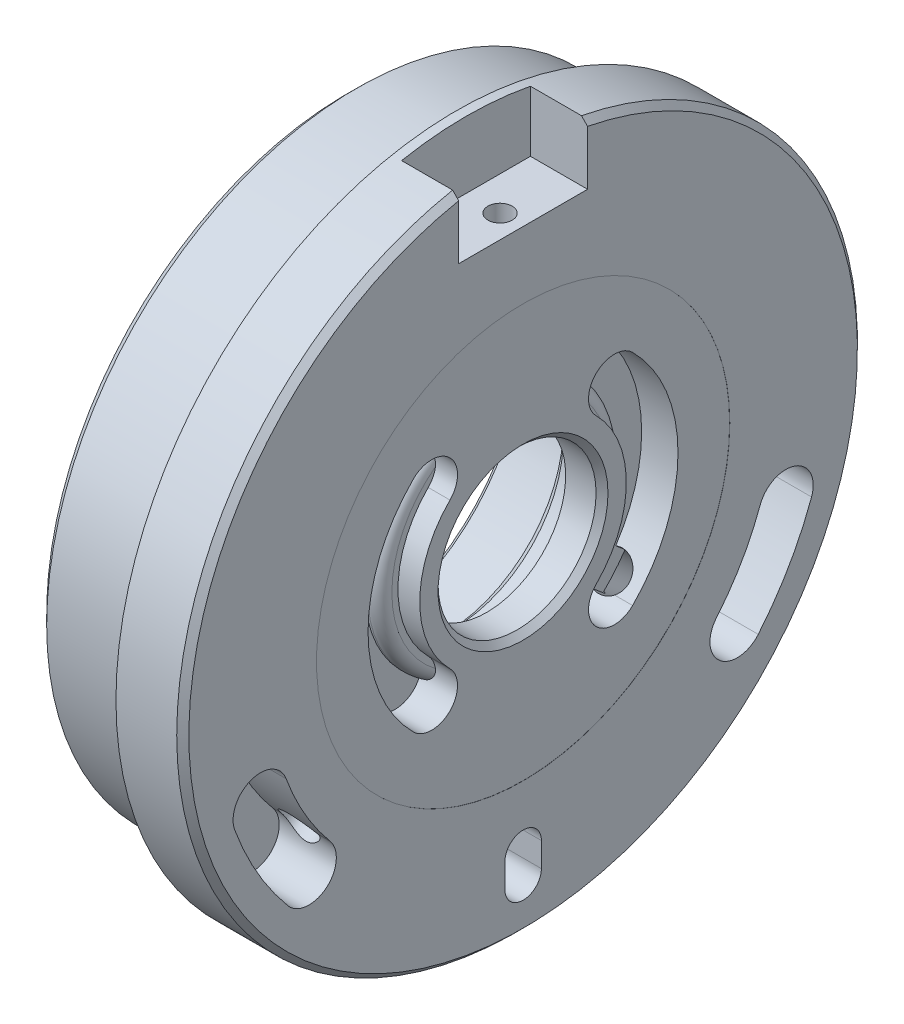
ISO-10303-21;
HEADER;
FILE_DESCRIPTION(('STEP AP214'),'2;1');
FILE_NAME('part.step','',(''),(''),'','','');
FILE_SCHEMA(('AUTOMOTIVE_DESIGN { 1 0 10303 214 1 1 1 1 }'));
ENDSEC;
DATA;
#1=APPLICATION_CONTEXT('core data for automotive mechanical design processes');
#2=APPLICATION_PROTOCOL_DEFINITION('international standard','automotive_design',2000,#1);
#3=PRODUCT_CONTEXT('',#1,'mechanical');
#4=PRODUCT('Part','Part','',(#3));
#5=PRODUCT_RELATED_PRODUCT_CATEGORY('part','',(#4));
#6=PRODUCT_DEFINITION_FORMATION('','',#4);
#7=PRODUCT_DEFINITION_CONTEXT('part definition',#1,'design');
#8=PRODUCT_DEFINITION('design','',#6,#7);
#9=PRODUCT_DEFINITION_SHAPE('','',#8);
#10=(LENGTH_UNIT() NAMED_UNIT(*) SI_UNIT(.MILLI.,.METRE.));
#11=(NAMED_UNIT(*) PLANE_ANGLE_UNIT() SI_UNIT($,.RADIAN.));
#12=(NAMED_UNIT(*) SI_UNIT($,.STERADIAN.) SOLID_ANGLE_UNIT());
#13=UNCERTAINTY_MEASURE_WITH_UNIT(LENGTH_MEASURE(1.E-05),#10,'distance_accuracy_value','');
#14=(GEOMETRIC_REPRESENTATION_CONTEXT(3) GLOBAL_UNCERTAINTY_ASSIGNED_CONTEXT((#13)) GLOBAL_UNIT_ASSIGNED_CONTEXT((#10,
#11,#12)) REPRESENTATION_CONTEXT('',''));
#15=CARTESIAN_POINT('',(0.,0.,0.));
#16=DIRECTION('',(0.,0.,1.));
#17=DIRECTION('',(1.,0.,0.));
#18=AXIS2_PLACEMENT_3D('',#15,#16,#17);
#19=CARTESIAN_POINT('',(0.5,-22.,0.));
#20=DIRECTION('',(1.,0.,0.));
#21=DIRECTION('',(0.,0.,-1.));
#22=AXIS2_PLACEMENT_3D('',#19,#20,#21);
#23=PLANE('',#22);
#24=CARTESIAN_POINT('',(0.5,-23.,0.));
#25=DIRECTION('',(1.,0.,0.));
#26=DIRECTION('',(0.,0.,-1.));
#27=AXIS2_PLACEMENT_3D('',#24,#25,#26);
#28=CIRCLE('',#27,1.49999999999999);
#29=CARTESIAN_POINT('',(0.5,-23.,-1.49999999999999));
#30=VERTEX_POINT('',#29);
#31=CARTESIAN_POINT('',(0.5,-23.,1.5));
#32=VERTEX_POINT('',#31);
#33=EDGE_CURVE('E370',#30,#32,#28,.T.);
#34=ORIENTED_EDGE('',*,*,#33,.F.);
#35=DIRECTION('',(0.,1.,0.));
#36=VECTOR('',#35,1.);
#37=CARTESIAN_POINT('',(0.5,-22.,-1.5));
#38=LINE('',#37,#36);
#39=CARTESIAN_POINT('',(0.5,-22.,-1.5));
#40=VERTEX_POINT('',#39);
#41=EDGE_CURVE('E715',#30,#40,#38,.T.);
#42=ORIENTED_EDGE('',*,*,#41,.T.);
#43=CARTESIAN_POINT('',(0.5,-22.,0.));
#44=DIRECTION('',(1.,0.,0.));
#45=DIRECTION('',(0.,0.,-1.));
#46=AXIS2_PLACEMENT_3D('',#43,#44,#45);
#47=CIRCLE('',#46,1.5);
#48=CARTESIAN_POINT('',(0.5,-22.,1.5));
#49=VERTEX_POINT('',#48);
#50=EDGE_CURVE('E1149',#40,#49,#47,.T.);
#51=ORIENTED_EDGE('',*,*,#50,.T.);
#52=DIRECTION('',(0.,-1.,0.));
#53=VECTOR('',#52,1.);
#54=CARTESIAN_POINT('',(0.5,-22.,1.5));
#55=LINE('',#54,#53);
#56=EDGE_CURVE('E718',#49,#32,#55,.T.);
#57=ORIENTED_EDGE('',*,*,#56,.T.);
#58=EDGE_LOOP('',(#34,#42,#51,#57));
#59=FACE_BOUND('',#58,.T.);
#60=ADVANCED_FACE('F356',(#59),#23,.T.);
#61=CARTESIAN_POINT('',(5.50000000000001,0.,0.));
#62=DIRECTION('',(1.,0.,0.));
#63=DIRECTION('',(0.,0.,-1.));
#64=AXIS2_PLACEMENT_3D('',#61,#62,#63);
#65=CONICAL_SURFACE('',#64,7.,0.785398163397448);
#66=CARTESIAN_POINT('',(5.,0.,0.));
#67=DIRECTION('',(-1.,0.,0.));
#68=DIRECTION('',(0.,0.,1.));
#69=AXIS2_PLACEMENT_3D('',#66,#67,#68);
#70=CIRCLE('',#69,6.5);
#71=CARTESIAN_POINT('',(5.,0.,6.5));
#72=VERTEX_POINT('',#71);
#73=EDGE_CURVE('E945',#72,#72,#70,.F.);
#74=ORIENTED_EDGE('',*,*,#73,.F.);
#75=EDGE_LOOP('',(#74));
#76=FACE_BOUND('',#75,.T.);
#77=CARTESIAN_POINT('',(5.49,0.,0.));
#78=DIRECTION('',(1.,0.,0.));
#79=DIRECTION('',(0.,0.,-1.));
#80=AXIS2_PLACEMENT_3D('',#77,#78,#79);
#81=CIRCLE('',#80,6.99);
#82=CARTESIAN_POINT('',(5.49,0.,-6.99));
#83=VERTEX_POINT('',#82);
#84=EDGE_CURVE('E1725',#83,#83,#81,.T.);
#85=ORIENTED_EDGE('',*,*,#84,.T.);
#86=EDGE_LOOP('',(#85));
#87=FACE_BOUND('',#86,.T.);
#88=ADVANCED_FACE('F871',(#76,#87),#65,.F.);
#89=CARTESIAN_POINT('',(2.5,-7.51300955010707,7.51300955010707));
#90=DIRECTION('',(1.,0.,0.));
#91=DIRECTION('',(0.,0.,-1.));
#92=AXIS2_PLACEMENT_3D('',#89,#90,#91);
#93=CYLINDRICAL_SURFACE('',#92,2.125);
#94=CARTESIAN_POINT('',(5.49,-7.51300955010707,7.51300955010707));
#95=DIRECTION('',(1.,0.,0.));
#96=DIRECTION('',(0.,0.,-1.));
#97=AXIS2_PLACEMENT_3D('',#94,#95,#96);
#98=CIRCLE('',#97,2.125);
#99=CARTESIAN_POINT('',(5.49,-6.01040764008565,6.01040764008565));
#100=VERTEX_POINT('',#99);
#101=CARTESIAN_POINT('',(5.49,-9.01561146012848,9.01561146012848));
#102=VERTEX_POINT('',#101);
#103=EDGE_CURVE('E1723',#100,#102,#98,.F.);
#104=ORIENTED_EDGE('',*,*,#103,.F.);
#105=DIRECTION('',(1.,0.,0.));
#106=VECTOR('',#105,1.);
#107=CARTESIAN_POINT('',(2.5,-6.01040764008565,6.01040764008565));
#108=LINE('',#107,#106);
#109=CARTESIAN_POINT('',(3.7,-6.01040764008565,6.01040764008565));
#110=VERTEX_POINT('',#109);
#111=EDGE_CURVE('E964',#110,#100,#108,.T.);
#112=ORIENTED_EDGE('',*,*,#111,.F.);
#113=CARTESIAN_POINT('',(3.7,-7.51300955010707,7.51300955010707));
#114=DIRECTION('',(1.,0.,0.));
#115=DIRECTION('',(0.,0.,-1.));
#116=AXIS2_PLACEMENT_3D('',#113,#114,#115);
#117=CIRCLE('',#116,2.125);
#118=CARTESIAN_POINT('',(3.7,-7.19051521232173,5.41262329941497));
#119=VERTEX_POINT('',#118);
#120=EDGE_CURVE('E1113',#110,#119,#117,.F.);
#121=ORIENTED_EDGE('',*,*,#120,.T.);
#122=CARTESIAN_POINT('',(3.7,-7.19051521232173,5.41262329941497));
#123=CARTESIAN_POINT('',(3.70000114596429,-7.22379626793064,5.40750819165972));
#124=CARTESIAN_POINT('',(3.69917023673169,-7.25721594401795,5.40319170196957));
#125=CARTESIAN_POINT('',(3.69556348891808,-7.32416904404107,5.3961501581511));
#126=CARTESIAN_POINT('',(3.69278457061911,-7.35770256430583,5.39342763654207));
#127=CARTESIAN_POINT('',(3.68497977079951,-7.42478011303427,5.38957484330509));
#128=CARTESIAN_POINT('',(3.67994273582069,-7.4583233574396,5.38845259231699));
#129=CARTESIAN_POINT('',(3.66737239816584,-7.52492844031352,5.38778169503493));
#130=CARTESIAN_POINT('',(3.65984074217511,-7.55799058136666,5.38823201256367));
#131=CARTESIAN_POINT('',(3.63626273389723,-7.64460107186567,5.39140470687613));
#132=CARTESIAN_POINT('',(3.61786386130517,-7.6974983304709,5.39541354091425));
#133=CARTESIAN_POINT('',(3.57313415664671,-7.79927533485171,5.40675777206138));
#134=CARTESIAN_POINT('',(3.54682654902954,-7.84816631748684,5.41408346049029));
#135=CARTESIAN_POINT('',(3.48622124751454,-7.94059710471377,5.43094040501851));
#136=CARTESIAN_POINT('',(3.45189252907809,-7.98411510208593,5.44048022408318));
#137=CARTESIAN_POINT('',(3.37600644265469,-8.06418367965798,5.4603183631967));
#138=CARTESIAN_POINT('',(3.33444271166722,-8.10072806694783,5.47061734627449));
#139=CARTESIAN_POINT('',(3.24768369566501,-8.16412320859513,5.48996234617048));
#140=CARTESIAN_POINT('',(3.20279393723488,-8.19138238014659,5.49904576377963));
#141=CARTESIAN_POINT('',(3.10890956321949,-8.23827488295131,5.51545243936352));
#142=CARTESIAN_POINT('',(3.05991500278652,-8.25790831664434,5.52277572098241));
#143=CARTESIAN_POINT('',(2.95973699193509,-8.28912925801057,5.53474205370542));
#144=CARTESIAN_POINT('',(2.90858594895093,-8.30080842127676,5.53941552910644));
#145=CARTESIAN_POINT('',(2.83088856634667,-8.31249326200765,5.54413524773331));
#146=CARTESIAN_POINT('',(2.80481472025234,-8.31541589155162,5.54532675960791));
#147=CARTESIAN_POINT('',(2.75249768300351,-8.31931312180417,5.54692157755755));
#148=CARTESIAN_POINT('',(2.726254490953,-8.32028771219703,5.54732487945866));
#149=CARTESIAN_POINT('',(2.7,-8.32028909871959,5.54732271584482));
#150=B_SPLINE_CURVE_WITH_KNOTS('',3,(#122,#123,#124,#125,#126,#127,#128,#129,#130,#131,#132,
#133,#134,#135,#136,#137,#138,#139,#140,#141,#142,#143,#144,#145,#146,#147,#148,#149),
.UNSPECIFIED.,.F.,.F.,(4,2,2,2,2,2,2,2,2,2,2,2,2,4),(0.,0.101018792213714,0.202197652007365,
0.303881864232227,0.405499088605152,0.573160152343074,0.740333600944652,0.908164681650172,
1.07614411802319,1.23529812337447,1.39444999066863,1.55173546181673,1.63045479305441,
1.7091745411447),.UNSPECIFIED.);
#151=CARTESIAN_POINT('',(2.7,-8.32028909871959,5.54732271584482));
#152=VERTEX_POINT('',#151);
#153=EDGE_CURVE('E843',#119,#152,#150,.T.);
#154=ORIENTED_EDGE('',*,*,#153,.T.);
#155=DIRECTION('',(1.,0.,0.));
#156=VECTOR('',#155,1.);
#157=CARTESIAN_POINT('',(3.1,-8.32028909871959,5.54732271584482));
#158=LINE('',#157,#156);
#159=CARTESIAN_POINT('',(2.5,-8.32028909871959,5.54732271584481));
#160=VERTEX_POINT('',#159);
#161=EDGE_CURVE('E1111',#152,#160,#158,.F.);
#162=ORIENTED_EDGE('',*,*,#161,.T.);
#163=CARTESIAN_POINT('',(2.5,-7.51300955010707,7.51300955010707));
#164=DIRECTION('',(1.,0.,0.));
#165=DIRECTION('',(0.,0.,1.));
#166=AXIS2_PLACEMENT_3D('',#163,#164,#165);
#167=CIRCLE('',#166,2.125);
#168=CARTESIAN_POINT('',(2.5,-9.21637011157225,8.78351645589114));
#169=VERTEX_POINT('',#168);
#170=EDGE_CURVE('E980',#169,#160,#167,.T.);
#171=ORIENTED_EDGE('',*,*,#170,.F.);
#172=CARTESIAN_POINT('',(2.5,-9.21637011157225,8.78351645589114));
#173=CARTESIAN_POINT('',(2.53860388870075,-9.22475251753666,8.77226681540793));
#174=CARTESIAN_POINT('',(2.57778886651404,-9.23208090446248,8.76222023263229));
#175=CARTESIAN_POINT('',(2.65706056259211,-9.24467771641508,8.74470530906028));
#176=CARTESIAN_POINT('',(2.69714739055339,-9.24994588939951,8.73723728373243));
#177=CARTESIAN_POINT('',(2.77787759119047,-9.25846039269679,8.72506577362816));
#178=CARTESIAN_POINT('',(2.81851978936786,-9.2617104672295,8.72035717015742));
#179=CARTESIAN_POINT('',(2.90012893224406,-9.26623069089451,8.71378192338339));
#180=CARTESIAN_POINT('',(2.94109585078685,-9.26750099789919,8.71191505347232));
#181=CARTESIAN_POINT('',(3.06415078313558,-9.26836139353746,8.71066857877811));
#182=CARTESIAN_POINT('',(3.1463674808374,-9.26499832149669,8.71564699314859));
#183=CARTESIAN_POINT('',(3.30859152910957,-9.25027665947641,8.73680846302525));
#184=CARTESIAN_POINT('',(3.38859789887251,-9.23891457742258,8.75299641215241));
#185=CARTESIAN_POINT('',(3.54426298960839,-9.20781874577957,8.79516745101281));
#186=CARTESIAN_POINT('',(3.6199220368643,-9.18808562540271,8.82114980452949));
#187=CARTESIAN_POINT('',(3.76494182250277,-9.13967109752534,8.88087914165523));
#188=CARTESIAN_POINT('',(3.8343119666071,-9.11100334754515,8.91461425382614));
#189=CARTESIAN_POINT('',(3.93700181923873,-9.05848192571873,8.97175132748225));
#190=CARTESIAN_POINT('',(3.97300543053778,-9.03785150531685,8.99336585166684));
#191=CARTESIAN_POINT('',(4.0075490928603,-9.01561146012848,9.01561146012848));
#192=B_SPLINE_CURVE_WITH_KNOTS('',3,(#172,#173,#174,#175,#176,#177,#178,#179,#180,#181,#182,
#183,#184,#185,#186,#187,#188,#189,#190,#191),.UNSPECIFIED.,.F.,.F.,(4,2,2,2,2,2,2,2,2,4),(0.,
0.123189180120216,0.246393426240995,0.369368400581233,0.492333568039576,0.738340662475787,
0.98445522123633,1.23055128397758,1.4762729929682,1.61642559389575),.UNSPECIFIED.);
#193=CARTESIAN_POINT('',(4.00754909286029,-9.01561146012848,9.01561146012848));
#194=VERTEX_POINT('',#193);
#195=EDGE_CURVE('E876',#169,#194,#192,.T.);
#196=ORIENTED_EDGE('',*,*,#195,.T.);
#197=DIRECTION('',(1.,0.,0.));
#198=VECTOR('',#197,1.);
#199=CARTESIAN_POINT('',(2.5,-9.01561146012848,9.01561146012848));
#200=LINE('',#199,#198);
#201=EDGE_CURVE('E974',#194,#102,#200,.T.);
#202=ORIENTED_EDGE('',*,*,#201,.T.);
#203=EDGE_LOOP('',(#104,#112,#121,#154,#162,#171,#196,#202));
#204=FACE_BOUND('',#203,.T.);
#205=ADVANCED_FACE('F867',(#204),#93,.F.);
#206=CARTESIAN_POINT('',(2.5,0.,0.));
#207=DIRECTION('',(1.,0.,0.));
#208=DIRECTION('',(0.,0.,-1.));
#209=AXIS2_PLACEMENT_3D('',#206,#207,#208);
#210=CYLINDRICAL_SURFACE('',#209,12.75);
#211=CARTESIAN_POINT('',(5.49,0.,0.));
#212=DIRECTION('',(1.,0.,0.));
#213=DIRECTION('',(0.,0.,-1.));
#214=AXIS2_PLACEMENT_3D('',#211,#212,#213);
#215=CIRCLE('',#214,12.75);
#216=CARTESIAN_POINT('',(5.49,9.01561146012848,9.01561146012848));
#217=VERTEX_POINT('',#216);
#218=EDGE_CURVE('E1721',#102,#217,#215,.F.);
#219=ORIENTED_EDGE('',*,*,#218,.F.);
#220=ORIENTED_EDGE('',*,*,#201,.F.);
#221=CARTESIAN_POINT('',(4.00754909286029,-9.01561146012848,9.01561146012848));
#222=CARTESIAN_POINT('',(4.03879500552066,-8.99550176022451,9.0357210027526));
#223=CARTESIAN_POINT('',(4.06883009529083,-8.97440537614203,9.05668279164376));
#224=CARTESIAN_POINT('',(4.12630045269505,-8.9303368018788,9.10013982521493));
#225=CARTESIAN_POINT('',(4.15373579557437,-8.90736466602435,9.12263502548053));
#226=CARTESIAN_POINT('',(4.23180781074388,-8.83584303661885,9.19210395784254));
#227=CARTESIAN_POINT('',(4.27829509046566,-8.78463393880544,9.24111579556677));
#228=CARTESIAN_POINT('',(4.35875428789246,-8.67637330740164,9.3428349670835));
#229=CARTESIAN_POINT('',(4.39271896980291,-8.61931842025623,9.39554441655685));
#230=CARTESIAN_POINT('',(4.44713655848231,-8.50079125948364,9.50291701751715));
#231=CARTESIAN_POINT('',(4.46759353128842,-8.43932032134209,9.55757957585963));
#232=CARTESIAN_POINT('',(4.49433858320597,-8.31384758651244,9.66691951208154));
#233=CARTESIAN_POINT('',(4.50068537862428,-8.2498574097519,9.7215958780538));
#234=CARTESIAN_POINT('',(4.49919719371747,-8.12088433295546,9.82958860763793));
#235=CARTESIAN_POINT('',(4.49136015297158,-8.05590129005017,9.88290477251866));
#236=CARTESIAN_POINT('',(4.46179133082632,-7.92711425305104,9.98649920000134));
#237=CARTESIAN_POINT('',(4.44011391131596,-7.86330664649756,10.0367885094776));
#238=CARTESIAN_POINT('',(4.383549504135,-7.73854046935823,10.1332974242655));
#239=CARTESIAN_POINT('',(4.3486630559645,-7.67758178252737,10.1795171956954));
#240=CARTESIAN_POINT('',(4.26652116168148,-7.5601831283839,10.2670111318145));
#241=CARTESIAN_POINT('',(4.21921959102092,-7.50376105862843,10.3082659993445));
#242=CARTESIAN_POINT('',(4.11363901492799,-7.39750333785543,10.3847840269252));
#243=CARTESIAN_POINT('',(4.05535923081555,-7.34766815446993,10.4200467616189));
#244=CARTESIAN_POINT('',(3.92908553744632,-7.25598035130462,10.4841023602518));
#245=CARTESIAN_POINT('',(3.86103879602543,-7.21417424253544,10.512857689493));
#246=CARTESIAN_POINT('',(3.71739284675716,-7.14034939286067,10.5631393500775));
#247=CARTESIAN_POINT('',(3.64179443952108,-7.10832961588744,10.5846664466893));
#248=CARTESIAN_POINT('',(3.48528480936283,-7.05525901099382,10.6201150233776));
#249=CARTESIAN_POINT('',(3.40438137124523,-7.03419249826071,10.634047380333));
#250=CARTESIAN_POINT('',(3.23942734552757,-7.00373297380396,10.6541335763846));
#251=CARTESIAN_POINT('',(3.15537538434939,-6.99434511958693,10.6602839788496));
#252=CARTESIAN_POINT('',(2.98705416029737,-6.98762617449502,10.6646891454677));
#253=CARTESIAN_POINT('',(2.90278852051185,-6.99023026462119,10.6629863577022));
#254=CARTESIAN_POINT('',(2.73611788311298,-7.00725485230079,10.6518068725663));
#255=CARTESIAN_POINT('',(2.65370928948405,-7.02165004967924,10.6423468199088));
#256=CARTESIAN_POINT('',(2.5487303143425,-7.04776655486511,10.6250425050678));
#257=CARTESIAN_POINT('',(2.52424680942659,-7.05443454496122,10.6206170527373));
#258=CARTESIAN_POINT('',(2.5,-7.06162084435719,10.6158377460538));
#259=B_SPLINE_CURVE_WITH_KNOTS('',3,(#221,#222,#223,#224,#225,#226,#227,#228,#229,#230,#231,
#232,#233,#234,#235,#236,#237,#238,#239,#240,#241,#242,#243,#244,#245,#246,#247,#248,#249,#250,
#251,#252,#253,#254,#255,#256,#257,#258),.UNSPECIFIED.,.F.,.F.,(4,2,2,2,2,2,2,2,2,2,2,2,2,2,2,2,
2,2,4),(0.,0.126673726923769,0.253343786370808,0.50634465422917,0.759491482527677,
1.0125620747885,1.26457758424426,1.51662970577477,1.7676978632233,2.01875576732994,
2.2707599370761,2.52278198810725,2.77622261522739,3.02963640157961,3.28268629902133,
3.53584790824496,3.78764273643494,4.03889869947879,4.11613546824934),.UNSPECIFIED.);
#260=CARTESIAN_POINT('',(2.5,-7.06162084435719,10.6158377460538));
#261=VERTEX_POINT('',#260);
#262=EDGE_CURVE('E884',#194,#261,#259,.T.);
#263=ORIENTED_EDGE('',*,*,#262,.T.);
#264=CARTESIAN_POINT('',(2.5,0.,0.));
#265=DIRECTION('',(1.,0.,0.));
#266=DIRECTION('',(0.,0.,-1.));
#267=AXIS2_PLACEMENT_3D('',#264,#265,#266);
#268=CIRCLE('',#267,12.75);
#269=CARTESIAN_POINT('',(2.5,9.01561146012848,9.01561146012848));
#270=VERTEX_POINT('',#269);
#271=EDGE_CURVE('E968',#270,#261,#268,.T.);
#272=ORIENTED_EDGE('',*,*,#271,.F.);
#273=DIRECTION('',(1.,0.,0.));
#274=VECTOR('',#273,1.);
#275=CARTESIAN_POINT('',(2.5,9.01561146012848,9.01561146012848));
#276=LINE('',#275,#274);
#277=EDGE_CURVE('E971',#270,#217,#276,.T.);
#278=ORIENTED_EDGE('',*,*,#277,.T.);
#279=EDGE_LOOP('',(#219,#220,#263,#272,#278));
#280=FACE_BOUND('',#279,.T.);
#281=ADVANCED_FACE('F862',(#280),#210,.F.);
#282=CARTESIAN_POINT('',(2.5,7.51300955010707,7.51300955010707));
#283=DIRECTION('',(1.,0.,0.));
#284=DIRECTION('',(0.,0.,-1.));
#285=AXIS2_PLACEMENT_3D('',#282,#283,#284);
#286=CYLINDRICAL_SURFACE('',#285,2.125);
#287=CARTESIAN_POINT('',(5.49,7.51300955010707,7.51300955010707));
#288=DIRECTION('',(1.,0.,0.));
#289=DIRECTION('',(0.,0.,-1.));
#290=AXIS2_PLACEMENT_3D('',#287,#288,#289);
#291=CIRCLE('',#290,2.125);
#292=CARTESIAN_POINT('',(5.49,6.01040764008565,6.01040764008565));
#293=VERTEX_POINT('',#292);
#294=EDGE_CURVE('E378',#217,#293,#291,.F.);
#295=ORIENTED_EDGE('',*,*,#294,.F.);
#296=ORIENTED_EDGE('',*,*,#277,.F.);
#297=CARTESIAN_POINT('',(2.5,7.51300955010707,7.51300955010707));
#298=DIRECTION('',(1.,0.,0.));
#299=DIRECTION('',(0.,0.,-1.));
#300=AXIS2_PLACEMENT_3D('',#297,#298,#299);
#301=CIRCLE('',#300,2.125);
#302=CARTESIAN_POINT('',(2.5,8.32028909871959,5.54732271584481));
#303=VERTEX_POINT('',#302);
#304=EDGE_CURVE('E978',#303,#270,#301,.T.);
#305=ORIENTED_EDGE('',*,*,#304,.F.);
#306=DIRECTION('',(1.,0.,0.));
#307=VECTOR('',#306,1.);
#308=CARTESIAN_POINT('',(3.1,8.32028909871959,5.54732271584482));
#309=LINE('',#308,#307);
#310=CARTESIAN_POINT('',(2.7,8.32028909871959,5.54732271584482));
#311=VERTEX_POINT('',#310);
#312=EDGE_CURVE('E1119',#303,#311,#309,.T.);
#313=ORIENTED_EDGE('',*,*,#312,.T.);
#314=CARTESIAN_POINT('',(2.7,8.32028909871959,5.54732271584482));
#315=CARTESIAN_POINT('',(2.72736205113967,8.32028739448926,5.54732524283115));
#316=CARTESIAN_POINT('',(2.75471119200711,8.31922897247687,5.54688696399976));
#317=CARTESIAN_POINT('',(2.80921820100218,8.3149965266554,5.5451554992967));
#318=CARTESIAN_POINT('',(2.83637606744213,8.31182248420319,5.54386230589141));
#319=CARTESIAN_POINT('',(2.91727447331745,8.29912988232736,5.53874291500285));
#320=CARTESIAN_POINT('',(2.97048023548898,8.28644084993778,5.53367683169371));
#321=CARTESIAN_POINT('',(3.07385845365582,8.2527188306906,5.52083051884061));
#322=CARTESIAN_POINT('',(3.12402829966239,8.2316787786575,5.51304799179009));
#323=CARTESIAN_POINT('',(3.21981715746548,8.18154375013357,5.4957374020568));
#324=CARTESIAN_POINT('',(3.26543888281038,8.15245361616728,5.4862103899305));
#325=CARTESIAN_POINT('',(3.3502104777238,8.08722725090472,5.46678459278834));
#326=CARTESIAN_POINT('',(3.38944086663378,8.0511936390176,5.45689273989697));
#327=CARTESIAN_POINT('',(3.46112993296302,7.97274545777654,5.43794545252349));
#328=CARTESIAN_POINT('',(3.49358958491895,7.93033180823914,5.42888989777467));
#329=CARTESIAN_POINT('',(3.55063253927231,7.84119217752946,5.41302557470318));
#330=CARTESIAN_POINT('',(3.57534084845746,7.794552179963,5.40618108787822));
#331=CARTESIAN_POINT('',(3.61758545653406,7.69781936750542,5.39550192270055));
#332=CARTESIAN_POINT('',(3.63511937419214,7.64772541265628,5.39166824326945));
#333=CARTESIAN_POINT('',(3.66430190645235,7.54262085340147,5.38752788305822));
#334=CARTESIAN_POINT('',(3.6755530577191,7.48749328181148,5.38743722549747));
#335=CARTESIAN_POINT('',(3.69158671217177,7.37653046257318,5.39167034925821));
#336=CARTESIAN_POINT('',(3.69637071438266,7.32069538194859,5.39599310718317));
#337=CARTESIAN_POINT('',(3.69954082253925,7.24015013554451,5.4054492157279));
#338=CARTESIAN_POINT('',(3.700001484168,7.21528923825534,5.40881484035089));
#339=CARTESIAN_POINT('',(3.7,7.19051521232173,5.41262329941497));
#340=B_SPLINE_CURVE_WITH_KNOTS('',3,(#314,#315,#316,#317,#318,#319,#320,#321,#322,#323,#324,
#325,#326,#327,#328,#329,#330,#331,#332,#333,#334,#335,#336,#337,#338,#339),.UNSPECIFIED.,.F.,
.F.,(4,2,2,2,2,2,2,2,2,2,2,2,4),(0.,0.0820364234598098,0.164073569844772,0.328028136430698,
0.492121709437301,0.656116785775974,0.817852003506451,0.979563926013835,1.13851504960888,
1.29751888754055,1.46568731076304,1.63381674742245,1.70904490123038),.UNSPECIFIED.);
#341=CARTESIAN_POINT('',(3.7,7.19051521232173,5.41262329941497));
#342=VERTEX_POINT('',#341);
#343=EDGE_CURVE('E850',#311,#342,#340,.T.);
#344=ORIENTED_EDGE('',*,*,#343,.T.);
#345=CARTESIAN_POINT('',(3.7,7.51300955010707,7.51300955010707));
#346=DIRECTION('',(1.,0.,0.));
#347=DIRECTION('',(0.,0.,-1.));
#348=AXIS2_PLACEMENT_3D('',#345,#346,#347);
#349=CIRCLE('',#348,2.125);
#350=CARTESIAN_POINT('',(3.7,6.01040764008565,6.01040764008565));
#351=VERTEX_POINT('',#350);
#352=EDGE_CURVE('E1123',#342,#351,#349,.F.);
#353=ORIENTED_EDGE('',*,*,#352,.T.);
#354=DIRECTION('',(1.,0.,0.));
#355=VECTOR('',#354,1.);
#356=CARTESIAN_POINT('',(2.5,6.01040764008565,6.01040764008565));
#357=LINE('',#356,#355);
#358=EDGE_CURVE('E967',#351,#293,#357,.T.);
#359=ORIENTED_EDGE('',*,*,#358,.T.);
#360=EDGE_LOOP('',(#295,#296,#305,#313,#344,#353,#359));
#361=FACE_BOUND('',#360,.T.);
#362=ADVANCED_FACE('F857',(#361),#286,.F.);
#363=CARTESIAN_POINT('',(2.5,0.,0.));
#364=DIRECTION('',(1.,0.,0.));
#365=DIRECTION('',(0.,0.,-1.));
#366=AXIS2_PLACEMENT_3D('',#363,#364,#365);
#367=CYLINDRICAL_SURFACE('',#366,8.5);
#368=CARTESIAN_POINT('',(5.49,0.,0.));
#369=DIRECTION('',(1.,0.,0.));
#370=DIRECTION('',(0.,0.,-1.));
#371=AXIS2_PLACEMENT_3D('',#368,#369,#370);
#372=CIRCLE('',#371,8.5);
#373=EDGE_CURVE('E1713',#293,#100,#372,.T.);
#374=ORIENTED_EDGE('',*,*,#373,.F.);
#375=ORIENTED_EDGE('',*,*,#358,.F.);
#376=CARTESIAN_POINT('',(3.7,0.,0.));
#377=DIRECTION('',(1.,0.,0.));
#378=DIRECTION('',(0.,0.,-1.));
#379=AXIS2_PLACEMENT_3D('',#376,#377,#378);
#380=CIRCLE('',#379,8.5);
#381=EDGE_CURVE('E1129',#351,#110,#380,.T.);
#382=ORIENTED_EDGE('',*,*,#381,.T.);
#383=ORIENTED_EDGE('',*,*,#111,.T.);
#384=EDGE_LOOP('',(#374,#375,#382,#383));
#385=FACE_BOUND('',#384,.T.);
#386=ADVANCED_FACE('F861',(#385),#367,.T.);
#387=CARTESIAN_POINT('',(2.5,0.,0.));
#388=DIRECTION('',(1.,0.,0.));
#389=DIRECTION('',(0.,0.,-1.));
#390=AXIS2_PLACEMENT_3D('',#387,#388,#389);
#391=CYLINDRICAL_SURFACE('',#390,8.5);
#392=CARTESIAN_POINT('',(5.49,0.,0.));
#393=DIRECTION('',(1.,0.,0.));
#394=DIRECTION('',(0.,0.,-1.));
#395=AXIS2_PLACEMENT_3D('',#392,#393,#394);
#396=CIRCLE('',#395,8.5);
#397=CARTESIAN_POINT('',(5.49,-6.01040764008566,-6.01040764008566));
#398=VERTEX_POINT('',#397);
#399=CARTESIAN_POINT('',(5.49,6.01040764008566,-6.01040764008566));
#400=VERTEX_POINT('',#399);
#401=EDGE_CURVE('E1690',#398,#400,#396,.T.);
#402=ORIENTED_EDGE('',*,*,#401,.F.);
#403=DIRECTION('',(1.,0.,0.));
#404=VECTOR('',#403,1.);
#405=CARTESIAN_POINT('',(2.5,-6.01040764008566,-6.01040764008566));
#406=LINE('',#405,#404);
#407=CARTESIAN_POINT('',(3.7,-6.01040764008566,-6.01040764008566));
#408=VERTEX_POINT('',#407);
#409=EDGE_CURVE('E984',#408,#398,#406,.T.);
#410=ORIENTED_EDGE('',*,*,#409,.F.);
#411=CARTESIAN_POINT('',(3.7,0.,0.));
#412=DIRECTION('',(1.,0.,0.));
#413=DIRECTION('',(0.,0.,-1.));
#414=AXIS2_PLACEMENT_3D('',#411,#412,#413);
#415=CIRCLE('',#414,8.5);
#416=CARTESIAN_POINT('',(3.7,6.01040764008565,-6.01040764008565));
#417=VERTEX_POINT('',#416);
#418=EDGE_CURVE('E1680',#408,#417,#415,.T.);
#419=ORIENTED_EDGE('',*,*,#418,.T.);
#420=DIRECTION('',(1.,0.,0.));
#421=VECTOR('',#420,1.);
#422=CARTESIAN_POINT('',(2.5,6.01040764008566,-6.01040764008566));
#423=LINE('',#422,#421);
#424=EDGE_CURVE('E983',#417,#400,#423,.T.);
#425=ORIENTED_EDGE('',*,*,#424,.T.);
#426=EDGE_LOOP('',(#402,#410,#419,#425));
#427=FACE_BOUND('',#426,.T.);
#428=ADVANCED_FACE('F804',(#427),#391,.T.);
#429=CARTESIAN_POINT('',(2.5,7.51300955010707,-7.51300955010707));
#430=DIRECTION('',(1.,0.,0.));
#431=DIRECTION('',(0.,0.,-1.));
#432=AXIS2_PLACEMENT_3D('',#429,#430,#431);
#433=CYLINDRICAL_SURFACE('',#432,2.125);
#434=CARTESIAN_POINT('',(5.49,7.51300955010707,-7.51300955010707));
#435=DIRECTION('',(1.,0.,0.));
#436=DIRECTION('',(0.,0.,-1.));
#437=AXIS2_PLACEMENT_3D('',#434,#435,#436);
#438=CIRCLE('',#437,2.125);
#439=CARTESIAN_POINT('',(5.49,9.01561146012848,-9.01561146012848));
#440=VERTEX_POINT('',#439);
#441=EDGE_CURVE('E1711',#400,#440,#438,.F.);
#442=ORIENTED_EDGE('',*,*,#441,.F.);
#443=ORIENTED_EDGE('',*,*,#424,.F.);
#444=CARTESIAN_POINT('',(3.7,7.51300955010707,-7.51300955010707));
#445=DIRECTION('',(1.,0.,0.));
#446=DIRECTION('',(0.,0.,-1.));
#447=AXIS2_PLACEMENT_3D('',#444,#445,#446);
#448=CIRCLE('',#447,2.125);
#449=CARTESIAN_POINT('',(3.7,7.19051521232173,-5.41262329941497));
#450=VERTEX_POINT('',#449);
#451=EDGE_CURVE('E1134',#417,#450,#448,.F.);
#452=ORIENTED_EDGE('',*,*,#451,.T.);
#453=CARTESIAN_POINT('',(3.7,7.19051521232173,-5.41262329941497));
#454=CARTESIAN_POINT('',(3.70000114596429,7.22379626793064,-5.40750819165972));
#455=CARTESIAN_POINT('',(3.69917023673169,7.25721594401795,-5.40319170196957));
#456=CARTESIAN_POINT('',(3.69556348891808,7.32416904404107,-5.3961501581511));
#457=CARTESIAN_POINT('',(3.69278457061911,7.35770256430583,-5.39342763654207));
#458=CARTESIAN_POINT('',(3.68497977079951,7.42478011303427,-5.38957484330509));
#459=CARTESIAN_POINT('',(3.67994273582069,7.4583233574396,-5.38845259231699));
#460=CARTESIAN_POINT('',(3.66737239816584,7.52492844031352,-5.38778169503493));
#461=CARTESIAN_POINT('',(3.65984074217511,7.55799058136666,-5.38823201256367));
#462=CARTESIAN_POINT('',(3.63626273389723,7.64460107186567,-5.39140470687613));
#463=CARTESIAN_POINT('',(3.61786386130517,7.6974983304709,-5.39541354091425));
#464=CARTESIAN_POINT('',(3.57313415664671,7.79927533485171,-5.40675777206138));
#465=CARTESIAN_POINT('',(3.54682654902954,7.84816631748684,-5.41408346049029));
#466=CARTESIAN_POINT('',(3.48622124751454,7.94059710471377,-5.43094040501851));
#467=CARTESIAN_POINT('',(3.45189252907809,7.98411510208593,-5.44048022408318));
#468=CARTESIAN_POINT('',(3.37600644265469,8.06418367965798,-5.4603183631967));
#469=CARTESIAN_POINT('',(3.33444271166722,8.10072806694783,-5.47061734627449));
#470=CARTESIAN_POINT('',(3.24768369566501,8.16412320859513,-5.48996234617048));
#471=CARTESIAN_POINT('',(3.20279393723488,8.19138238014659,-5.49904576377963));
#472=CARTESIAN_POINT('',(3.10890956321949,8.23827488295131,-5.51545243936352));
#473=CARTESIAN_POINT('',(3.05991500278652,8.25790831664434,-5.52277572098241));
#474=CARTESIAN_POINT('',(2.95973699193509,8.28912925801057,-5.53474205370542));
#475=CARTESIAN_POINT('',(2.90858594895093,8.30080842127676,-5.53941552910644));
#476=CARTESIAN_POINT('',(2.83088856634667,8.31249326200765,-5.54413524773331));
#477=CARTESIAN_POINT('',(2.80481472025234,8.31541589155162,-5.54532675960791));
#478=CARTESIAN_POINT('',(2.75249768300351,8.31931312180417,-5.54692157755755));
#479=CARTESIAN_POINT('',(2.726254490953,8.32028771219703,-5.54732487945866));
#480=CARTESIAN_POINT('',(2.7,8.32028909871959,-5.54732271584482));
#481=B_SPLINE_CURVE_WITH_KNOTS('',3,(#453,#454,#455,#456,#457,#458,#459,#460,#461,#462,#463,
#464,#465,#466,#467,#468,#469,#470,#471,#472,#473,#474,#475,#476,#477,#478,#479,#480),
.UNSPECIFIED.,.F.,.F.,(4,2,2,2,2,2,2,2,2,2,2,2,2,4),(0.,0.101018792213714,0.202197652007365,
0.303881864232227,0.405499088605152,0.573160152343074,0.740333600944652,0.908164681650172,
1.07614411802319,1.23529812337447,1.39444999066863,1.55173546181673,1.63045479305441,
1.7091745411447),.UNSPECIFIED.);
#482=CARTESIAN_POINT('',(2.7,8.32028909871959,-5.54732271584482));
#483=VERTEX_POINT('',#482);
#484=EDGE_CURVE('E816',#450,#483,#481,.T.);
#485=ORIENTED_EDGE('',*,*,#484,.T.);
#486=DIRECTION('',(1.,0.,0.));
#487=VECTOR('',#486,1.);
#488=CARTESIAN_POINT('',(3.1,8.32028909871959,-5.54732271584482));
#489=LINE('',#488,#487);
#490=CARTESIAN_POINT('',(2.5,8.32028909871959,-5.54732271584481));
#491=VERTEX_POINT('',#490);
#492=EDGE_CURVE('E1132',#483,#491,#489,.F.);
#493=ORIENTED_EDGE('',*,*,#492,.T.);
#494=CARTESIAN_POINT('',(2.5,7.51300955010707,-7.51300955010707));
#495=DIRECTION('',(1.,0.,0.));
#496=DIRECTION('',(0.,0.,1.));
#497=AXIS2_PLACEMENT_3D('',#494,#495,#496);
#498=CIRCLE('',#497,2.125);
#499=CARTESIAN_POINT('',(2.5,9.01561146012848,-9.01561146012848));
#500=VERTEX_POINT('',#499);
#501=EDGE_CURVE('E988',#500,#491,#498,.T.);
#502=ORIENTED_EDGE('',*,*,#501,.F.);
#503=DIRECTION('',(1.,0.,0.));
#504=VECTOR('',#503,1.);
#505=CARTESIAN_POINT('',(2.5,9.01561146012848,-9.01561146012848));
#506=LINE('',#505,#504);
#507=EDGE_CURVE('E991',#500,#440,#506,.T.);
#508=ORIENTED_EDGE('',*,*,#507,.T.);
#509=EDGE_LOOP('',(#442,#443,#452,#485,#493,#502,#508));
#510=FACE_BOUND('',#509,.T.);
#511=ADVANCED_FACE('F795',(#510),#433,.F.);
#512=CARTESIAN_POINT('',(2.5,0.,0.));
#513=DIRECTION('',(1.,0.,0.));
#514=DIRECTION('',(0.,0.,-1.));
#515=AXIS2_PLACEMENT_3D('',#512,#513,#514);
#516=CYLINDRICAL_SURFACE('',#515,12.75);
#517=CARTESIAN_POINT('',(5.49,0.,0.));
#518=DIRECTION('',(1.,0.,0.));
#519=DIRECTION('',(0.,0.,-1.));
#520=AXIS2_PLACEMENT_3D('',#517,#518,#519);
#521=CIRCLE('',#520,12.75);
#522=CARTESIAN_POINT('',(5.49,-9.01561146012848,-9.01561146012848));
#523=VERTEX_POINT('',#522);
#524=EDGE_CURVE('E1697',#440,#523,#521,.F.);
#525=ORIENTED_EDGE('',*,*,#524,.F.);
#526=ORIENTED_EDGE('',*,*,#507,.F.);
#527=CARTESIAN_POINT('',(2.5,0.,0.));
#528=DIRECTION('',(1.,0.,0.));
#529=DIRECTION('',(0.,0.,1.));
#530=AXIS2_PLACEMENT_3D('',#527,#528,#529);
#531=CIRCLE('',#530,12.75);
#532=CARTESIAN_POINT('',(2.5,-7.06162084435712,-10.6158377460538));
#533=VERTEX_POINT('',#532);
#534=EDGE_CURVE('E998',#533,#500,#531,.T.);
#535=ORIENTED_EDGE('',*,*,#534,.F.);
#536=CARTESIAN_POINT('',(2.5,-7.06162084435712,-10.6158377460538));
#537=CARTESIAN_POINT('',(2.5395292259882,-7.04991185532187,-10.6236254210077));
#538=CARTESIAN_POINT('',(2.57963182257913,-7.03958188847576,-10.630470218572));
#539=CARTESIAN_POINT('',(2.66073549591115,-7.02175617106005,-10.6422534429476));
#540=CARTESIAN_POINT('',(2.70173654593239,-7.01426033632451,-10.6471919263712));
#541=CARTESIAN_POINT('',(2.8255798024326,-6.99615764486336,-10.6591042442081));
#542=CARTESIAN_POINT('',(2.90939652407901,-6.98989578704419,-10.6632012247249));
#543=CARTESIAN_POINT('',(3.07709881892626,-6.98925217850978,-10.6636227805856));
#544=CARTESIAN_POINT('',(3.1609844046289,-6.99487696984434,-10.6599430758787));
#545=CARTESIAN_POINT('',(3.32642836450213,-7.01779486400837,-10.6448692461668));
#546=CARTESIAN_POINT('',(3.40798720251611,-7.03508562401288,-10.633476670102));
#547=CARTESIAN_POINT('',(3.56648312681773,-7.08070137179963,-10.6031557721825));
#548=CARTESIAN_POINT('',(3.64342015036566,-7.10902650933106,-10.5842273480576));
#549=CARTESIAN_POINT('',(3.79054842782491,-7.17570493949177,-10.5391352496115));
#550=CARTESIAN_POINT('',(3.86073831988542,-7.21406025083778,-10.5129701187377));
#551=CARTESIAN_POINT('',(3.99281074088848,-7.29972814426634,-10.4536687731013));
#552=CARTESIAN_POINT('',(4.05464166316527,-7.34709237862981,-10.4204922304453));
#553=CARTESIAN_POINT('',(4.16777622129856,-7.44902973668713,-10.3478676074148));
#554=CARTESIAN_POINT('',(4.21908033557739,-7.50360253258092,-10.308419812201));
#555=CARTESIAN_POINT('',(4.30986028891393,-7.6183544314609,-10.2239063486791));
#556=CARTESIAN_POINT('',(4.34929930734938,-7.67855024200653,-10.1788237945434));
#557=CARTESIAN_POINT('',(4.41499483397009,-7.80248118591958,-10.084139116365));
#558=CARTESIAN_POINT('',(4.44125133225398,-7.86621632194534,-10.0345369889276));
#559=CARTESIAN_POINT('',(4.47971849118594,-7.99495007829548,-9.93227048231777));
#560=CARTESIAN_POINT('',(4.49199212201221,-8.05994168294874,-9.87962096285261));
#561=CARTESIAN_POINT('',(4.50234057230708,-8.18952133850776,-9.77247692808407));
#562=CARTESIAN_POINT('',(4.50041721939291,-8.25410944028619,-9.71798265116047));
#563=CARTESIAN_POINT('',(4.48248191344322,-8.38071503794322,-9.60900921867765));
#564=CARTESIAN_POINT('',(4.46654348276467,-8.44274418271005,-9.55453146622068));
#565=CARTESIAN_POINT('',(4.42113218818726,-8.5629663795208,-9.44693711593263));
#566=CARTESIAN_POINT('',(4.39165270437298,-8.6211575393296,-9.39382119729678));
#567=CARTESIAN_POINT('',(4.31990976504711,-8.73238467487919,-9.29051911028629));
#568=CARTESIAN_POINT('',(4.27760719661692,-8.78540421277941,-9.24034247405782));
#569=CARTESIAN_POINT('',(4.1815012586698,-8.88476713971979,-9.14484298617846));
#570=CARTESIAN_POINT('',(4.12772166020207,-8.93112400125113,-9.0995103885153));
#571=CARTESIAN_POINT('',(4.04907716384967,-8.98808779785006,-9.04307453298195));
#572=CARTESIAN_POINT('',(4.02858108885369,-9.00208082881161,-9.02914270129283));
#573=CARTESIAN_POINT('',(4.00754909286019,-9.01561146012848,-9.01561146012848));
#574=B_SPLINE_CURVE_WITH_KNOTS('',3,(#536,#537,#538,#539,#540,#541,#542,#543,#544,#545,#546,
#547,#548,#549,#550,#551,#552,#553,#554,#555,#556,#557,#558,#559,#560,#561,#562,#563,#564,#565,
#566,#567,#568,#569,#570,#571,#572,#573),.UNSPECIFIED.,.F.,.F.,(4,2,2,2,2,2,2,2,2,2,2,2,2,2,2,2,
2,2,4),(0.,0.1257915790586,0.251579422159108,0.502732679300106,0.754024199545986,
1.00526526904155,1.25650974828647,1.50780483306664,1.76058668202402,2.01335704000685,
2.26690390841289,2.52045096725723,2.77285163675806,3.02521981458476,3.27627192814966,
3.52744690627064,3.77939586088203,4.03082796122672,4.11615883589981),.UNSPECIFIED.);
#575=CARTESIAN_POINT('',(4.00754909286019,-9.01561146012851,-9.01561146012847));
#576=VERTEX_POINT('',#575);
#577=EDGE_CURVE('E781',#533,#576,#574,.T.);
#578=ORIENTED_EDGE('',*,*,#577,.T.);
#579=DIRECTION('',(1.,0.,0.));
#580=VECTOR('',#579,1.);
#581=CARTESIAN_POINT('',(2.5,-9.01561146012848,-9.01561146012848));
#582=LINE('',#581,#580);
#583=EDGE_CURVE('E987',#576,#523,#582,.T.);
#584=ORIENTED_EDGE('',*,*,#583,.T.);
#585=EDGE_LOOP('',(#525,#526,#535,#578,#584));
#586=FACE_BOUND('',#585,.T.);
#587=ADVANCED_FACE('F790',(#586),#516,.F.);
#588=CARTESIAN_POINT('',(2.5,-7.51300955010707,-7.51300955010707));
#589=DIRECTION('',(1.,0.,0.));
#590=DIRECTION('',(0.,0.,-1.));
#591=AXIS2_PLACEMENT_3D('',#588,#589,#590);
#592=CYLINDRICAL_SURFACE('',#591,2.125);
#593=CARTESIAN_POINT('',(5.49,-7.51300955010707,-7.51300955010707));
#594=DIRECTION('',(1.,0.,0.));
#595=DIRECTION('',(0.,0.,-1.));
#596=AXIS2_PLACEMENT_3D('',#593,#594,#595);
#597=CIRCLE('',#596,2.125);
#598=EDGE_CURVE('E11',#523,#398,#597,.F.);
#599=ORIENTED_EDGE('',*,*,#598,.F.);
#600=ORIENTED_EDGE('',*,*,#583,.F.);
#601=CARTESIAN_POINT('',(3.95347408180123,-6.1836096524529,-9.17081560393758));
#602=CARTESIAN_POINT('',(3.96828727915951,-6.23217280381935,-9.20973833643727));
#603=CARTESIAN_POINT('',(3.98554544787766,-6.2818771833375,-9.24611233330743));
#604=CARTESIAN_POINT('',(4.02338008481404,-6.38326485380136,-9.31385066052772));
#605=CARTESIAN_POINT('',(4.04395028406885,-6.43494426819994,-9.34522423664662));
#606=CARTESIAN_POINT('',(4.08701125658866,-6.54042383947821,-9.40333842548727));
#607=CARTESIAN_POINT('',(4.10951108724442,-6.59423327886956,-9.43005517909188));
#608=CARTESIAN_POINT('',(4.15515838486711,-6.70369745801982,-9.47877354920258));
#609=CARTESIAN_POINT('',(4.1783061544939,-6.75935306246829,-9.50077291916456));
#610=CARTESIAN_POINT('',(4.2446556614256,-6.92282035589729,-9.55754510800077));
#611=CARTESIAN_POINT('',(4.2873864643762,-7.03300249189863,-9.5862810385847));
#612=CARTESIAN_POINT('',(4.36533553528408,-7.25889356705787,-9.62585365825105));
#613=CARTESIAN_POINT('',(4.40057725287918,-7.37458382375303,-9.6367469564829));
#614=CARTESIAN_POINT('',(4.44915601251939,-7.57503212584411,-9.63872509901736));
#615=CARTESIAN_POINT('',(4.46588611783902,-7.65890773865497,-9.63468361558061));
#616=CARTESIAN_POINT('',(4.4901870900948,-7.82694344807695,-9.61638630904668));
#617=CARTESIAN_POINT('',(4.49776225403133,-7.9111033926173,-9.60213528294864));
#618=CARTESIAN_POINT('',(4.50140261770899,-8.07818791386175,-9.56328076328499));
#619=CARTESIAN_POINT('',(4.49735957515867,-8.16109359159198,-9.53858175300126));
#620=CARTESIAN_POINT('',(4.47563014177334,-8.32169805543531,-9.47996959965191));
#621=CARTESIAN_POINT('',(4.45795759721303,-8.39940203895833,-9.44606583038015));
#622=CARTESIAN_POINT('',(4.41181254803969,-8.53626821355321,-9.3767753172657));
#623=CARTESIAN_POINT('',(4.38519265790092,-8.5965044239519,-9.34225669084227));
#624=CARTESIAN_POINT('',(4.32178778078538,-8.7094932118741,-9.27043187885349));
#625=CARTESIAN_POINT('',(4.28500194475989,-8.76224516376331,-9.23312546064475));
#626=CARTESIAN_POINT('',(4.2032869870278,-8.85827578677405,-9.15905794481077));
#627=CARTESIAN_POINT('',(4.15859107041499,-8.90176282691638,-9.12230742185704));
#628=CARTESIAN_POINT('',(4.06156340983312,-8.98087938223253,-9.05048850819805));
#629=CARTESIAN_POINT('',(4.00922932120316,-9.01650647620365,-9.01542063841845));
#630=CARTESIAN_POINT('',(3.89270157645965,-9.08326137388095,-8.94566049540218));
#631=CARTESIAN_POINT('',(3.82785066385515,-9.11362221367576,-8.91133166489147));
#632=CARTESIAN_POINT('',(3.69186236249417,-9.16582022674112,-8.84923247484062));
#633=CARTESIAN_POINT('',(3.62072227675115,-9.18765372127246,-8.82146494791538));
#634=CARTESIAN_POINT('',(3.46856162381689,-9.22462311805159,-8.77277610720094));
#635=CARTESIAN_POINT('',(3.38719808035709,-9.23917746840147,-8.7524764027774));
#636=CARTESIAN_POINT('',(3.22139098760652,-9.25965818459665,-8.72344987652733));
#637=CARTESIAN_POINT('',(3.13694847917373,-9.26558743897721,-8.7147191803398));
#638=CARTESIAN_POINT('',(2.96957897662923,-9.26900503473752,-8.70971875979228));
#639=CARTESIAN_POINT('',(2.88666489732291,-9.26669460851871,-8.71315195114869));
#640=CARTESIAN_POINT('',(2.72274934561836,-9.2539944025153,-8.73149945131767));
#641=CARTESIAN_POINT('',(2.64174811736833,-9.2436035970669,-8.74641521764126));
#642=CARTESIAN_POINT('',(2.48470022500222,-9.21453428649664,-8.78620733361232));
#643=CARTESIAN_POINT('',(2.40861186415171,-9.19594033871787,-8.81098181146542));
#644=CARTESIAN_POINT('',(2.26235060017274,-9.14991291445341,-8.86856346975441));
#645=CARTESIAN_POINT('',(2.19218006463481,-9.1224759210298,-8.90137384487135));
#646=CARTESIAN_POINT('',(2.05705740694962,-9.05690937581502,-8.97399331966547));
#647=CARTESIAN_POINT('',(1.99238943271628,-9.0184259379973,-9.01401424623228));
#648=CARTESIAN_POINT('',(1.87318140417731,-8.93063866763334,-9.09717988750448));
#649=CARTESIAN_POINT('',(1.8186362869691,-8.88134027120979,-9.14032302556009));
#650=CARTESIAN_POINT('',(1.72376741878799,-8.77446396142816,-9.22436968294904));
#651=CARTESIAN_POINT('',(1.68289709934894,-8.71738217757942,-9.26528342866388));
#652=CARTESIAN_POINT('',(1.61330740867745,-8.5942699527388,-9.34380442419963));
#653=CARTESIAN_POINT('',(1.58457717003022,-8.52824758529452,-9.38141460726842));
#654=CARTESIAN_POINT('',(1.54200088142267,-8.39628189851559,-9.44700103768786));
#655=CARTESIAN_POINT('',(1.52693286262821,-8.33102141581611,-9.47556923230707));
#656=CARTESIAN_POINT('',(1.50651569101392,-8.1966334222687,-9.52632588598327));
#657=CARTESIAN_POINT('',(1.50116759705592,-8.12750549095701,-9.54851364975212));
#658=CARTESIAN_POINT('',(1.49917003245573,-7.98684190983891,-9.58579484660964));
#659=CARTESIAN_POINT('',(1.50257327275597,-7.91529424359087,-9.60084464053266));
#660=CARTESIAN_POINT('',(1.51677114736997,-7.77178661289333,-9.62344760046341));
#661=CARTESIAN_POINT('',(1.52756895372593,-7.69982648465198,-9.63099754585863));
#662=CARTESIAN_POINT('',(1.56175376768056,-7.52175868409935,-9.64066242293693));
#663=CARTESIAN_POINT('',(1.58871104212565,-7.4160918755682,-9.63833846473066));
#664=CARTESIAN_POINT('',(1.65097873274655,-7.2085836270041,-9.61868803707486));
#665=CARTESIAN_POINT('',(1.68631298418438,-7.10675408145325,-9.60131837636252));
#666=CARTESIAN_POINT('',(1.76196808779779,-6.90541616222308,-9.5520023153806));
#667=CARTESIAN_POINT('',(1.80239739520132,-6.80604361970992,-9.51967688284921));
#668=CARTESIAN_POINT('',(1.88249534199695,-6.61307637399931,-9.44085302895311));
#669=CARTESIAN_POINT('',(1.92216591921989,-6.51946503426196,-9.39439796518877));
#670=CARTESIAN_POINT('',(1.97510326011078,-6.38661181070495,-9.31557791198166));
#671=CARTESIAN_POINT('',(1.99115114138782,-6.34504822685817,-9.288949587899));
#672=CARTESIAN_POINT('',(2.02085731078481,-6.2632720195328,-9.23238527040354));
#673=CARTESIAN_POINT('',(2.03451269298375,-6.22306108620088,-9.20244532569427));
#674=CARTESIAN_POINT('',(2.04652591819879,-6.1836096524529,-9.17081560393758));
#675=B_SPLINE_CURVE_WITH_KNOTS('',3,(#601,#602,#603,#604,#605,#606,#607,#608,#609,#610,#611,
#612,#613,#614,#615,#616,#617,#618,#619,#620,#621,#622,#623,#624,#625,#626,#627,#628,#629,#630,
#631,#632,#633,#634,#635,#636,#637,#638,#639,#640,#641,#642,#643,#644,#645,#646,#647,#648,#649,
#650,#651,#652,#653,#654,#655,#656,#657,#658,#659,#660,#661,#662,#663,#664,#665,#666,#667,#668,
#669,#670,#671,#672,#673,#674),.UNSPECIFIED.,.F.,.F.,(4,2,2,2,2,2,2,2,2,2,2,2,2,2,2,2,2,2,2,2,2,
2,2,2,2,2,2,2,2,2,2,2,2,2,2,2,4),(0.,0.191649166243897,0.382939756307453,0.575183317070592,
0.767518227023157,1.13088209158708,1.49309086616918,1.74903822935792,2.00486541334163,
2.2630837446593,2.52104009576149,2.74297697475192,2.96493239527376,3.18119183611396,
3.3975178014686,3.63473850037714,3.87206142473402,4.12613633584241,4.38012613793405,
4.62795584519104,4.87581701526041,5.12118086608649,5.36664242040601,5.62106785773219,
5.875365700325,6.11774913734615,6.35991513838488,6.57730791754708,6.79472437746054,
7.01345344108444,7.23227639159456,7.55769050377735,7.88404188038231,8.21915983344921,
8.5532596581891,8.70882022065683,8.86456843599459),.UNSPECIFIED.);
#676=CARTESIAN_POINT('',(2.5,-9.2163701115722,-8.78351645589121));
#677=VERTEX_POINT('',#676);
#678=EDGE_CURVE('E750',#576,#677,#675,.T.);
#679=ORIENTED_EDGE('',*,*,#678,.T.);
#680=CARTESIAN_POINT('',(2.5,-7.51300955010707,-7.51300955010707));
#681=DIRECTION('',(1.,0.,0.));
#682=DIRECTION('',(0.,0.,-1.));
#683=AXIS2_PLACEMENT_3D('',#680,#681,#682);
#684=CIRCLE('',#683,2.125);
#685=CARTESIAN_POINT('',(2.5,-8.32028909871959,-5.54732271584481));
#686=VERTEX_POINT('',#685);
#687=EDGE_CURVE('E1000',#686,#677,#684,.T.);
#688=ORIENTED_EDGE('',*,*,#687,.F.);
#689=DIRECTION('',(1.,0.,0.));
#690=VECTOR('',#689,1.);
#691=CARTESIAN_POINT('',(3.1,-8.32028909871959,-5.54732271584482));
#692=LINE('',#691,#690);
#693=CARTESIAN_POINT('',(2.7,-8.32028909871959,-5.54732271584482));
#694=VERTEX_POINT('',#693);
#695=EDGE_CURVE('E1089',#686,#694,#692,.T.);
#696=ORIENTED_EDGE('',*,*,#695,.T.);
#697=CARTESIAN_POINT('',(2.7,-8.32028909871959,-5.54732271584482));
#698=CARTESIAN_POINT('',(2.72736205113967,-8.32028739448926,-5.54732524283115));
#699=CARTESIAN_POINT('',(2.75471119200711,-8.31922897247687,-5.54688696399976));
#700=CARTESIAN_POINT('',(2.80921820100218,-8.3149965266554,-5.5451554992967));
#701=CARTESIAN_POINT('',(2.83637606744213,-8.31182248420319,-5.54386230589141));
#702=CARTESIAN_POINT('',(2.91727447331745,-8.29912988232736,-5.53874291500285));
#703=CARTESIAN_POINT('',(2.97048023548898,-8.28644084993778,-5.53367683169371));
#704=CARTESIAN_POINT('',(3.07385845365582,-8.2527188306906,-5.52083051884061));
#705=CARTESIAN_POINT('',(3.12402829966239,-8.2316787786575,-5.51304799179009));
#706=CARTESIAN_POINT('',(3.21981715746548,-8.18154375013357,-5.4957374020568));
#707=CARTESIAN_POINT('',(3.26543888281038,-8.15245361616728,-5.4862103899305));
#708=CARTESIAN_POINT('',(3.3502104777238,-8.08722725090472,-5.46678459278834));
#709=CARTESIAN_POINT('',(3.38944086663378,-8.0511936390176,-5.45689273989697));
#710=CARTESIAN_POINT('',(3.46112993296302,-7.97274545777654,-5.43794545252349));
#711=CARTESIAN_POINT('',(3.49358958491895,-7.93033180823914,-5.42888989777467));
#712=CARTESIAN_POINT('',(3.55063253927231,-7.84119217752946,-5.41302557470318));
#713=CARTESIAN_POINT('',(3.57534084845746,-7.794552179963,-5.40618108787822));
#714=CARTESIAN_POINT('',(3.61758545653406,-7.69781936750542,-5.39550192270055));
#715=CARTESIAN_POINT('',(3.63511937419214,-7.64772541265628,-5.39166824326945));
#716=CARTESIAN_POINT('',(3.66430190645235,-7.54262085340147,-5.38752788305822));
#717=CARTESIAN_POINT('',(3.6755530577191,-7.48749328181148,-5.38743722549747));
#718=CARTESIAN_POINT('',(3.69158671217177,-7.37653046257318,-5.39167034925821));
#719=CARTESIAN_POINT('',(3.69637071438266,-7.32069538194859,-5.39599310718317));
#720=CARTESIAN_POINT('',(3.69954082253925,-7.24015013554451,-5.4054492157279));
#721=CARTESIAN_POINT('',(3.700001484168,-7.21528923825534,-5.40881484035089));
#722=CARTESIAN_POINT('',(3.7,-7.19051521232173,-5.41262329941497));
#723=B_SPLINE_CURVE_WITH_KNOTS('',3,(#697,#698,#699,#700,#701,#702,#703,#704,#705,#706,#707,
#708,#709,#710,#711,#712,#713,#714,#715,#716,#717,#718,#719,#720,#721,#722),.UNSPECIFIED.,.F.,
.F.,(4,2,2,2,2,2,2,2,2,2,2,2,4),(0.,0.0820364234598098,0.164073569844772,0.328028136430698,
0.492121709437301,0.656116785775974,0.817852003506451,0.979563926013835,1.13851504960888,
1.29751888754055,1.46568731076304,1.63381674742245,1.70904490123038),.UNSPECIFIED.);
#724=CARTESIAN_POINT('',(3.7,-7.19051521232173,-5.41262329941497));
#725=VERTEX_POINT('',#724);
#726=EDGE_CURVE('E808',#694,#725,#723,.T.);
#727=ORIENTED_EDGE('',*,*,#726,.T.);
#728=CARTESIAN_POINT('',(3.7,-7.51300955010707,-7.51300955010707));
#729=DIRECTION('',(1.,0.,0.));
#730=DIRECTION('',(0.,0.,-1.));
#731=AXIS2_PLACEMENT_3D('',#728,#729,#730);
#732=CIRCLE('',#731,2.125);
#733=EDGE_CURVE('E1088',#725,#408,#732,.F.);
#734=ORIENTED_EDGE('',*,*,#733,.T.);
#735=ORIENTED_EDGE('',*,*,#409,.T.);
#736=EDGE_LOOP('',(#599,#600,#679,#688,#696,#727,#734,#735));
#737=FACE_BOUND('',#736,.T.);
#738=ADVANCED_FACE('F794',(#737),#592,.F.);
#739=CARTESIAN_POINT('',(-120.,0.,0.));
#740=DIRECTION('',(-1.,0.,0.));
#741=DIRECTION('',(0.,0.,1.));
#742=AXIS2_PLACEMENT_3D('',#739,#740,#741);
#743=CYLINDRICAL_SURFACE('',#742,6.5);
#744=CARTESIAN_POINT('',(3.6,6.42261628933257,1.));
#745=CARTESIAN_POINT('',(3.54418734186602,6.42261724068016,0.999997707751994));
#746=CARTESIAN_POINT('',(3.48834271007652,6.42335168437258,0.99531161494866));
#747=CARTESIAN_POINT('',(3.3782160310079,6.42620796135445,0.976696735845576));
#748=CARTESIAN_POINT('',(3.32393554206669,6.42833113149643,0.962759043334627));
#749=CARTESIAN_POINT('',(3.21854708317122,6.4337188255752,0.926068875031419));
#750=CARTESIAN_POINT('',(3.16743666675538,6.43698245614,0.903323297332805));
#751=CARTESIAN_POINT('',(3.06976467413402,6.44428228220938,0.849679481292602));
#752=CARTESIAN_POINT('',(3.02320249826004,6.4483183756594,0.818782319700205));
#753=CARTESIAN_POINT('',(2.93555001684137,6.45674633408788,0.749434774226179));
#754=CARTESIAN_POINT('',(2.8945035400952,6.46114064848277,0.710929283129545));
#755=CARTESIAN_POINT('',(2.81942762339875,6.46976808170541,0.627577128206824));
#756=CARTESIAN_POINT('',(2.78539857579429,6.47400119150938,0.582730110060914));
#757=CARTESIAN_POINT('',(2.72516112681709,6.48185495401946,0.48768642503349));
#758=CARTESIAN_POINT('',(2.69899318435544,6.4854723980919,0.437463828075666));
#759=CARTESIAN_POINT('',(2.65548048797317,6.49166008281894,0.333271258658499));
#760=CARTESIAN_POINT('',(2.63813524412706,6.49423038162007,0.279301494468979));
#761=CARTESIAN_POINT('',(2.61289344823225,6.49801689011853,0.169598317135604));
#762=CARTESIAN_POINT('',(2.60492344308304,6.49924362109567,0.113882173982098));
#763=CARTESIAN_POINT('',(2.5984302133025,6.50024085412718,0.00189078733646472));
#764=CARTESIAN_POINT('',(2.59990643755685,6.50001144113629,-0.0543844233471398));
#765=CARTESIAN_POINT('',(2.61220594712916,6.49813062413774,-0.16539511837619));
#766=CARTESIAN_POINT('',(2.62295020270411,6.4964912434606,-0.220139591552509));
#767=CARTESIAN_POINT('',(2.65335664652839,6.49198808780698,-0.327039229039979));
#768=CARTESIAN_POINT('',(2.67301907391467,6.48912427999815,-0.379194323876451));
#769=CARTESIAN_POINT('',(2.72078409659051,6.48247342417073,-0.479672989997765));
#770=CARTESIAN_POINT('',(2.7489198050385,6.47868276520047,-0.527980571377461));
#771=CARTESIAN_POINT('',(2.81280852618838,6.47060038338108,-0.619218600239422));
#772=CARTESIAN_POINT('',(2.84856206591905,6.46630862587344,-0.662148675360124));
#773=CARTESIAN_POINT('',(2.9271113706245,6.45764998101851,-0.741879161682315));
#774=CARTESIAN_POINT('',(2.9699761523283,6.45328277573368,-0.778611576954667));
#775=CARTESIAN_POINT('',(3.06129711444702,6.44500866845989,-0.844372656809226));
#776=CARTESIAN_POINT('',(3.10975333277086,6.44110176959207,-0.87340126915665));
#777=CARTESIAN_POINT('',(3.21095431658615,6.43419065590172,-0.922940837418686));
#778=CARTESIAN_POINT('',(3.26370268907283,6.43118721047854,-0.943444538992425));
#779=CARTESIAN_POINT('',(3.37195100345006,6.42643647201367,-0.975282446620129));
#780=CARTESIAN_POINT('',(3.42745074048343,6.42468908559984,-0.986617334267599));
#781=CARTESIAN_POINT('',(3.5390206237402,6.4226661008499,-0.999702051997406));
#782=CARTESIAN_POINT('',(3.59507919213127,6.42237568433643,-1.00154839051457));
#783=CARTESIAN_POINT('',(3.70670501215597,6.42326015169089,-0.995859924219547));
#784=CARTESIAN_POINT('',(3.76227227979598,6.42443498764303,-0.988325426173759));
#785=CARTESIAN_POINT('',(3.87103748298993,6.4281039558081,-0.964171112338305));
#786=CARTESIAN_POINT('',(3.92424640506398,6.43059107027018,-0.94759960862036));
#787=CARTESIAN_POINT('',(4.02713148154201,6.43659855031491,-0.905892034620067));
#788=CARTESIAN_POINT('',(4.07680745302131,6.44011896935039,-0.880755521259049));
#789=CARTESIAN_POINT('',(4.1716484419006,6.44783120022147,-0.822400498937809));
#790=CARTESIAN_POINT('',(4.21677468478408,6.45202810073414,-0.789119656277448));
#791=CARTESIAN_POINT('',(4.3008361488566,6.46060518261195,-0.715507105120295));
#792=CARTESIAN_POINT('',(4.33977100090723,6.46498537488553,-0.675174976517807));
#793=CARTESIAN_POINT('',(4.41069234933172,6.47348193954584,-0.588179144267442));
#794=CARTESIAN_POINT('',(4.44261479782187,6.47759565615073,-0.541462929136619));
#795=CARTESIAN_POINT('',(4.4981584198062,6.48505420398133,-0.44327490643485));
#796=CARTESIAN_POINT('',(4.52177982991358,6.48839905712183,-0.391803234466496));
#797=CARTESIAN_POINT('',(4.55994910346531,6.49393138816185,-0.28576319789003));
#798=CARTESIAN_POINT('',(4.57453165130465,6.49612328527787,-0.231207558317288));
#799=CARTESIAN_POINT('',(4.59432138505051,6.49912131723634,-0.120385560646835));
#800=CARTESIAN_POINT('',(4.59952922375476,6.49992754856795,-0.0641193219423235));
#801=CARTESIAN_POINT('',(4.60040514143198,6.500062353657,0.047906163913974));
#802=CARTESIAN_POINT('',(4.59617109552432,6.49940608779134,0.103664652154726));
#803=CARTESIAN_POINT('',(4.57849364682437,6.49672029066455,0.213666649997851));
#804=CARTESIAN_POINT('',(4.56505027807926,6.49469076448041,0.26791016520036));
#805=CARTESIAN_POINT('',(4.52937115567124,6.48948547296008,0.373313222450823));
#806=CARTESIAN_POINT('',(4.50714252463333,6.48631063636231,0.424475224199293));
#807=CARTESIAN_POINT('',(4.45453440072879,6.47916296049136,0.522358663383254));
#808=CARTESIAN_POINT('',(4.42415461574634,6.47519009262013,0.569079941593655));
#809=CARTESIAN_POINT('',(4.35575416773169,6.46683879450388,0.657251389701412));
#810=CARTESIAN_POINT('',(4.31766136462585,6.46245676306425,0.698645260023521));
#811=CARTESIAN_POINT('',(4.23506795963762,6.45380727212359,0.774488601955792));
#812=CARTESIAN_POINT('',(4.19056585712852,6.44953983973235,0.808936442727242));
#813=CARTESIAN_POINT('',(4.09610583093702,6.44157552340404,0.870094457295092));
#814=CARTESIAN_POINT('',(4.04611710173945,6.43788217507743,0.896757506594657));
#815=CARTESIAN_POINT('',(3.94233675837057,6.43152571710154,0.941268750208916));
#816=CARTESIAN_POINT('',(3.88854912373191,6.42886154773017,0.959126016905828));
#817=CARTESIAN_POINT('',(3.79543902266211,6.42547517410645,0.981504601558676));
#818=CARTESIAN_POINT('',(3.75668924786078,6.42440883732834,0.988429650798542));
#819=CARTESIAN_POINT('',(3.67863160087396,6.42297906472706,0.997678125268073));
#820=CARTESIAN_POINT('',(3.6393237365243,6.4226156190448,1.00000161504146));
#821=CARTESIAN_POINT('',(3.6,6.42261628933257,1.));
#822=B_SPLINE_CURVE_WITH_KNOTS('',3,(#744,#745,#746,#747,#748,#749,#750,#751,#752,#753,#754,
#755,#756,#757,#758,#759,#760,#761,#762,#763,#764,#765,#766,#767,#768,#769,#770,#771,#772,#773,
#774,#775,#776,#777,#778,#779,#780,#781,#782,#783,#784,#785,#786,#787,#788,#789,#790,#791,#792,
#793,#794,#795,#796,#797,#798,#799,#800,#801,#802,#803,#804,#805,#806,#807,#808,#809,#810,#811,
#812,#813,#814,#815,#816,#817,#818,#819,#820,#821),.UNSPECIFIED.,.T.,.F.,(4,2,2,2,2,2,2,2,2,2,2,
2,2,2,2,2,2,2,2,2,2,2,2,2,2,2,2,2,2,2,2,2,2,2,2,2,2,2,4),(0.,0.167294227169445,
0.334749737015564,0.502074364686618,0.669376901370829,0.837938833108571,1.0065101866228,
1.17593482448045,1.3453500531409,1.51342891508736,1.68149797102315,1.84814788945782,
2.01480227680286,2.18211658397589,2.34944247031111,2.51849910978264,2.6875568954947,
2.85675824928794,3.02594702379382,3.19341151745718,3.36087053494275,3.52744296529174,
3.6940240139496,3.86192223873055,4.02983047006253,4.19921381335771,4.36859232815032,
4.53731680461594,4.70602953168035,4.87300151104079,5.03997287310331,5.20680914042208,
5.37365138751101,5.54213288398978,5.71065389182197,5.88017482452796,6.04952073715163,
6.16739232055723,6.28526225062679),.UNSPECIFIED.);
#823=CARTESIAN_POINT('',(3.6,6.42261628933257,1.));
#824=VERTEX_POINT('',#823);
#825=EDGE_CURVE('E1632',#824,#824,#822,.T.);
#826=ORIENTED_EDGE('',*,*,#825,.F.);
#827=EDGE_LOOP('',(#826));
#828=FACE_BOUND('',#827,.T.);
#829=ORIENTED_EDGE('',*,*,#73,.T.);
#830=EDGE_LOOP('',(#829));
#831=FACE_BOUND('',#830,.T.);
#832=CARTESIAN_POINT('',(2.5,0.,0.));
#833=DIRECTION('',(-1.,0.,0.));
#834=DIRECTION('',(0.,0.,1.));
#835=AXIS2_PLACEMENT_3D('',#832,#833,#834);
#836=CIRCLE('',#835,6.5);
#837=CARTESIAN_POINT('',(2.5,0.,6.5));
#838=VERTEX_POINT('',#837);
#839=EDGE_CURVE('E1096',#838,#838,#836,.F.);
#840=ORIENTED_EDGE('',*,*,#839,.F.);
#841=EDGE_LOOP('',(#840));
#842=FACE_BOUND('',#841,.T.);
#843=ADVANCED_FACE('F802',(#828,#831,#842),#743,.F.);
#844=CARTESIAN_POINT('',(2.5,14.,0.));
#845=DIRECTION('',(1.,0.,0.));
#846=DIRECTION('',(0.,0.,-1.));
#847=AXIS2_PLACEMENT_3D('',#844,#845,#846);
#848=PLANE('',#847);
#849=CARTESIAN_POINT('',(2.5,0.,0.));
#850=DIRECTION('',(-1.,0.,0.));
#851=DIRECTION('',(0.,0.,1.));
#852=AXIS2_PLACEMENT_3D('',#849,#850,#851);
#853=CIRCLE('',#852,13.75);
#854=CARTESIAN_POINT('',(2.5,-9.87480759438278,-9.56821169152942));
#855=VERTEX_POINT('',#854);
#856=CARTESIAN_POINT('',(2.5,-9.87480759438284,9.56821169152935));
#857=VERTEX_POINT('',#856);
#858=EDGE_CURVE('E1670',#855,#857,#853,.T.);
#859=ORIENTED_EDGE('',*,*,#858,.F.);
#860=DIRECTION('',(0.,-0.642787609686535,-0.766044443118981));
#861=VECTOR('',#860,1.);
#862=CARTESIAN_POINT('',(2.5,-8.1540141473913,-7.51744991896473));
#863=LINE('',#862,#861);
#864=CARTESIAN_POINT('',(2.5,-10.0363458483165,-9.76072548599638));
#865=VERTEX_POINT('',#864);
#866=EDGE_CURVE('E1874',#855,#865,#863,.T.);
#867=ORIENTED_EDGE('',*,*,#866,.T.);
#868=CARTESIAN_POINT('',(2.5,0.,0.));
#869=DIRECTION('',(-1.,0.,0.));
#870=DIRECTION('',(0.,0.,1.));
#871=AXIS2_PLACEMENT_3D('',#868,#869,#870);
#872=CIRCLE('',#871,14.);
#873=CARTESIAN_POINT('',(2.5,-10.0363458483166,9.76072548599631));
#874=VERTEX_POINT('',#873);
#875=EDGE_CURVE('E963',#865,#874,#872,.T.);
#876=ORIENTED_EDGE('',*,*,#875,.T.);
#877=DIRECTION('',(0.,-0.642787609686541,0.766044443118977));
#878=VECTOR('',#877,1.);
#879=CARTESIAN_POINT('',(2.5,-8.15401414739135,7.51744991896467));
#880=LINE('',#879,#878);
#881=EDGE_CURVE('E883',#874,#857,#880,.F.);
#882=ORIENTED_EDGE('',*,*,#881,.T.);
#883=EDGE_LOOP('',(#859,#867,#876,#882));
#884=FACE_BOUND('',#883,.T.);
#885=ADVANCED_FACE('F910',(#884),#848,.F.);
#886=CARTESIAN_POINT('',(2.5,-7.70810671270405,11.3862896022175));
#887=VERTEX_POINT('',#886);
#888=CARTESIAN_POINT('',(2.5,-7.70810671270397,-11.3862896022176));
#889=VERTEX_POINT('',#888);
#890=EDGE_CURVE('E1099',#887,#889,#853,.T.);
#891=ORIENTED_EDGE('',*,*,#890,.F.);
#892=DIRECTION('',(0.,-0.642787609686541,0.766044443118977));
#893=VECTOR('',#892,1.);
#894=CARTESIAN_POINT('',(2.5,-5.98731326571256,9.33552782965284));
#895=LINE('',#894,#893);
#896=CARTESIAN_POINT('',(2.5,-7.86964496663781,11.5788033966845));
#897=VERTEX_POINT('',#896);
#898=EDGE_CURVE('E891',#887,#897,#895,.T.);
#899=ORIENTED_EDGE('',*,*,#898,.T.);
#900=CARTESIAN_POINT('',(2.5,-7.86964496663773,-11.5788033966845));
#901=VERTEX_POINT('',#900);
#902=EDGE_CURVE('E960',#897,#901,#872,.T.);
#903=ORIENTED_EDGE('',*,*,#902,.T.);
#904=DIRECTION('',(0.,-0.642787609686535,-0.766044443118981));
#905=VECTOR('',#904,1.);
#906=CARTESIAN_POINT('',(2.5,-5.98731326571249,-9.33552782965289));
#907=LINE('',#906,#905);
#908=EDGE_CURVE('E788',#901,#889,#907,.F.);
#909=ORIENTED_EDGE('',*,*,#908,.T.);
#910=EDGE_LOOP('',(#891,#899,#903,#909));
#911=FACE_BOUND('',#910,.T.);
#912=ADVANCED_FACE('F1200',(#911),#848,.F.);
#913=CARTESIAN_POINT('',(5.5,28.,0.));
#914=DIRECTION('',(-1.,0.,0.));
#915=DIRECTION('',(0.,0.,1.));
#916=AXIS2_PLACEMENT_3D('',#913,#914,#915);
#917=PLANE('',#916);
#918=CARTESIAN_POINT('',(5.5,0.,0.));
#919=DIRECTION('',(1.,0.,0.));
#920=DIRECTION('',(0.,0.,-1.));
#921=AXIS2_PLACEMENT_3D('',#918,#919,#920);
#922=CIRCLE('',#921,17.);
#923=CARTESIAN_POINT('',(5.5,0.,-17.));
#924=VERTEX_POINT('',#923);
#925=EDGE_CURVE('E2049',#924,#924,#922,.T.);
#926=ORIENTED_EDGE('',*,*,#925,.F.);
#927=EDGE_LOOP('',(#926));
#928=FACE_BOUND('',#927,.T.);
#929=DIRECTION('',(0.,-1.,0.));
#930=VECTOR('',#929,1.);
#931=CARTESIAN_POINT('',(5.5,-22.,1.5));
#932=LINE('',#931,#930);
#933=CARTESIAN_POINT('',(5.5,-22.,1.5));
#934=VERTEX_POINT('',#933);
#935=CARTESIAN_POINT('',(5.5,-24.,1.5));
#936=VERTEX_POINT('',#935);
#937=EDGE_CURVE('E1141',#934,#936,#932,.T.);
#938=ORIENTED_EDGE('',*,*,#937,.F.);
#939=CARTESIAN_POINT('',(5.5,-22.,0.));
#940=DIRECTION('',(1.,0.,0.));
#941=DIRECTION('',(0.,0.,-1.));
#942=AXIS2_PLACEMENT_3D('',#939,#940,#941);
#943=CIRCLE('',#942,1.5);
#944=CARTESIAN_POINT('',(5.5,-22.,-1.5));
#945=VERTEX_POINT('',#944);
#946=EDGE_CURVE('E1118',#945,#934,#943,.T.);
#947=ORIENTED_EDGE('',*,*,#946,.F.);
#948=DIRECTION('',(0.,1.,0.));
#949=VECTOR('',#948,1.);
#950=CARTESIAN_POINT('',(5.5,-22.,-1.5));
#951=LINE('',#950,#949);
#952=CARTESIAN_POINT('',(5.5,-24.,-1.5));
#953=VERTEX_POINT('',#952);
#954=EDGE_CURVE('E1147',#953,#945,#951,.T.);
#955=ORIENTED_EDGE('',*,*,#954,.F.);
#956=CARTESIAN_POINT('',(5.5,-24.,0.));
#957=DIRECTION('',(1.,0.,0.));
#958=DIRECTION('',(0.,0.,-1.));
#959=AXIS2_PLACEMENT_3D('',#956,#957,#958);
#960=CIRCLE('',#959,1.5);
#961=EDGE_CURVE('E1144',#936,#953,#960,.T.);
#962=ORIENTED_EDGE('',*,*,#961,.F.);
#963=EDGE_LOOP('',(#938,#947,#955,#962));
#964=FACE_BOUND('',#963,.T.);
#965=CARTESIAN_POINT('',(5.5,-7.86646329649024,-21.6129302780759));
#966=DIRECTION('',(1.,0.,0.));
#967=DIRECTION('',(0.,0.,1.));
#968=AXIS2_PLACEMENT_3D('',#965,#966,#967);
#969=CIRCLE('',#968,2.25);
#970=CARTESIAN_POINT('',(5.5,-8.63600861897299,-23.7272386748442));
#971=VERTEX_POINT('',#970);
#972=CARTESIAN_POINT('',(5.5,-7.0969179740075,-19.4986218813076));
#973=VERTEX_POINT('',#972);
#974=EDGE_CURVE('E1064',#971,#973,#969,.T.);
#975=ORIENTED_EDGE('',*,*,#974,.F.);
#976=CARTESIAN_POINT('',(5.5,0.,0.));
#977=DIRECTION('',(1.,0.,0.));
#978=DIRECTION('',(0.,0.,1.));
#979=AXIS2_PLACEMENT_3D('',#976,#977,#978);
#980=CIRCLE('',#979,25.25);
#981=CARTESIAN_POINT('',(5.5,-16.230387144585,-19.3426221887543));
#982=VERTEX_POINT('',#981);
#983=EDGE_CURVE('E900',#982,#971,#980,.T.);
#984=ORIENTED_EDGE('',*,*,#983,.F.);
#985=CARTESIAN_POINT('',(5.5,-14.7841150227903,-17.6190221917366));
#986=DIRECTION('',(1.,0.,0.));
#987=DIRECTION('',(0.,0.,1.));
#988=AXIS2_PLACEMENT_3D('',#985,#986,#987);
#989=CIRCLE('',#988,2.25);
#990=CARTESIAN_POINT('',(5.5,-13.3378429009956,-15.8954221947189));
#991=VERTEX_POINT('',#990);
#992=EDGE_CURVE('E1059',#991,#982,#989,.T.);
#993=ORIENTED_EDGE('',*,*,#992,.F.);
#994=CARTESIAN_POINT('',(5.5,0.,0.));
#995=DIRECTION('',(-1.,0.,0.));
#996=DIRECTION('',(0.,0.,1.));
#997=AXIS2_PLACEMENT_3D('',#994,#995,#996);
#998=CIRCLE('',#997,20.75);
#999=EDGE_CURVE('E1062',#973,#991,#998,.T.);
#1000=ORIENTED_EDGE('',*,*,#999,.F.);
#1001=EDGE_LOOP('',(#975,#984,#993,#1000));
#1002=FACE_BOUND('',#1001,.T.);
#1003=CARTESIAN_POINT('',(5.5,-14.7841150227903,17.6190221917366));
#1004=DIRECTION('',(1.,0.,0.));
#1005=DIRECTION('',(0.,0.,-1.));
#1006=AXIS2_PLACEMENT_3D('',#1003,#1004,#1005);
#1007=CIRCLE('',#1006,2.25);
#1008=CARTESIAN_POINT('',(5.5,-16.230387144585,19.3426221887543));
#1009=VERTEX_POINT('',#1008);
#1010=CARTESIAN_POINT('',(5.5,-13.3378429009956,15.8954221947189));
#1011=VERTEX_POINT('',#1010);
#1012=EDGE_CURVE('E1031',#1009,#1011,#1007,.T.);
#1013=ORIENTED_EDGE('',*,*,#1012,.F.);
#1014=CARTESIAN_POINT('',(5.5,0.,0.));
#1015=DIRECTION('',(1.,0.,0.));
#1016=DIRECTION('',(0.,0.,-1.));
#1017=AXIS2_PLACEMENT_3D('',#1014,#1015,#1016);
#1018=CIRCLE('',#1017,25.25);
#1019=CARTESIAN_POINT('',(5.5,-8.63600861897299,23.7272386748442));
#1020=VERTEX_POINT('',#1019);
#1021=EDGE_CURVE('E1034',#1020,#1009,#1018,.T.);
#1022=ORIENTED_EDGE('',*,*,#1021,.F.);
#1023=CARTESIAN_POINT('',(5.5,-7.86646329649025,21.6129302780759));
#1024=DIRECTION('',(1.,0.,0.));
#1025=DIRECTION('',(0.,0.,-1.));
#1026=AXIS2_PLACEMENT_3D('',#1023,#1024,#1025);
#1027=CIRCLE('',#1026,2.25);
#1028=CARTESIAN_POINT('',(5.5,-7.09691797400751,19.4986218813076));
#1029=VERTEX_POINT('',#1028);
#1030=EDGE_CURVE('E1025',#1029,#1020,#1027,.T.);
#1031=ORIENTED_EDGE('',*,*,#1030,.F.);
#1032=CARTESIAN_POINT('',(5.5,0.,0.));
#1033=DIRECTION('',(-1.,0.,0.));
#1034=DIRECTION('',(0.,0.,-1.));
#1035=AXIS2_PLACEMENT_3D('',#1032,#1033,#1034);
#1036=CIRCLE('',#1035,20.75);
#1037=EDGE_CURVE('E1028',#1011,#1029,#1036,.T.);
#1038=ORIENTED_EDGE('',*,*,#1037,.F.);
#1039=EDGE_LOOP('',(#1013,#1022,#1031,#1038));
#1040=FACE_BOUND('',#1039,.T.);
#1041=DIRECTION('',(0.,-1.,0.));
#1042=VECTOR('',#1041,1.);
#1043=CARTESIAN_POINT('',(5.5,30.,5.3));
#1044=LINE('',#1043,#1042);
#1045=CARTESIAN_POINT('',(5.5,26.9844399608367,5.3));
#1046=VERTEX_POINT('',#1045);
#1047=CARTESIAN_POINT('',(5.5,22.5,5.3));
#1048=VERTEX_POINT('',#1047);
#1049=EDGE_CURVE('E1638',#1046,#1048,#1044,.T.);
#1050=ORIENTED_EDGE('',*,*,#1049,.F.);
#1051=CARTESIAN_POINT('',(5.5,0.,0.));
#1052=DIRECTION('',(-1.,0.,0.));
#1053=DIRECTION('',(0.,0.,1.));
#1054=AXIS2_PLACEMENT_3D('',#1051,#1052,#1053);
#1055=CIRCLE('',#1054,27.5);
#1056=CARTESIAN_POINT('',(5.5,26.9844399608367,-5.3));
#1057=VERTEX_POINT('',#1056);
#1058=EDGE_CURVE('E1625',#1046,#1057,#1055,.F.);
#1059=ORIENTED_EDGE('',*,*,#1058,.T.);
#1060=DIRECTION('',(0.,1.,0.));
#1061=VECTOR('',#1060,1.);
#1062=CARTESIAN_POINT('',(5.5,30.,-5.3));
#1063=LINE('',#1062,#1061);
#1064=CARTESIAN_POINT('',(5.5,22.5,-5.3));
#1065=VERTEX_POINT('',#1064);
#1066=EDGE_CURVE('E1649',#1065,#1057,#1063,.T.);
#1067=ORIENTED_EDGE('',*,*,#1066,.F.);
#1068=DIRECTION('',(0.,0.,-1.));
#1069=VECTOR('',#1068,1.);
#1070=CARTESIAN_POINT('',(5.5,22.5,5.3));
#1071=LINE('',#1070,#1069);
#1072=EDGE_CURVE('E1646',#1048,#1065,#1071,.T.);
#1073=ORIENTED_EDGE('',*,*,#1072,.F.);
#1074=EDGE_LOOP('',(#1050,#1059,#1067,#1073));
#1075=FACE_BOUND('',#1074,.T.);
#1076=ADVANCED_FACE('F358',(#928,#964,#1002,#1040,#1075),#917,.F.);
#1077=CARTESIAN_POINT('',(-120.,0.,0.));
#1078=DIRECTION('',(-1.,0.,0.));
#1079=DIRECTION('',(0.,0.,1.));
#1080=AXIS2_PLACEMENT_3D('',#1077,#1078,#1079);
#1081=CYLINDRICAL_SURFACE('',#1080,28.);
#1082=CARTESIAN_POINT('',(0.,0.,0.));
#1083=DIRECTION('',(-1.,0.,0.));
#1084=DIRECTION('',(0.,0.,1.));
#1085=AXIS2_PLACEMENT_3D('',#1082,#1083,#1084);
#1086=CIRCLE('',#1085,28.);
#1087=CARTESIAN_POINT('',(0.,0.,28.));
#1088=VERTEX_POINT('',#1087);
#1089=EDGE_CURVE('E954',#1088,#1088,#1086,.T.);
#1090=ORIENTED_EDGE('',*,*,#1089,.F.);
#1091=EDGE_LOOP('',(#1090));
#1092=FACE_BOUND('',#1091,.T.);
#1093=DIRECTION('',(-1.,0.,0.));
#1094=VECTOR('',#1093,1.);
#1095=CARTESIAN_POINT('',(-120.,27.493817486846,-5.3));
#1096=LINE('',#1095,#1094);
#1097=CARTESIAN_POINT('',(0.799999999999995,27.493817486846,-5.3));
#1098=VERTEX_POINT('',#1097);
#1099=CARTESIAN_POINT('',(5.,27.493817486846,-5.3));
#1100=VERTEX_POINT('',#1099);
#1101=EDGE_CURVE('E1979',#1098,#1100,#1096,.F.);
#1102=ORIENTED_EDGE('',*,*,#1101,.T.);
#1103=CARTESIAN_POINT('',(5.,0.,0.));
#1104=DIRECTION('',(-1.,0.,0.));
#1105=DIRECTION('',(0.,0.,1.));
#1106=AXIS2_PLACEMENT_3D('',#1103,#1104,#1105);
#1107=CIRCLE('',#1106,28.);
#1108=CARTESIAN_POINT('',(5.,27.493817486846,5.3));
#1109=VERTEX_POINT('',#1108);
#1110=EDGE_CURVE('E1977',#1100,#1109,#1107,.T.);
#1111=ORIENTED_EDGE('',*,*,#1110,.T.);
#1112=DIRECTION('',(-1.,0.,0.));
#1113=VECTOR('',#1112,1.);
#1114=CARTESIAN_POINT('',(-120.,27.493817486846,5.3));
#1115=LINE('',#1114,#1113);
#1116=CARTESIAN_POINT('',(0.799999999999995,27.493817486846,5.3));
#1117=VERTEX_POINT('',#1116);
#1118=EDGE_CURVE('E1982',#1109,#1117,#1115,.T.);
#1119=ORIENTED_EDGE('',*,*,#1118,.T.);
#1120=CARTESIAN_POINT('',(0.799999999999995,0.,0.));
#1121=DIRECTION('',(-1.,0.,0.));
#1122=DIRECTION('',(0.,0.,1.));
#1123=AXIS2_PLACEMENT_3D('',#1120,#1121,#1122);
#1124=CIRCLE('',#1123,28.);
#1125=EDGE_CURVE('E815',#1117,#1098,#1124,.T.);
#1126=ORIENTED_EDGE('',*,*,#1125,.T.);
#1127=EDGE_LOOP('',(#1102,#1111,#1119,#1126));
#1128=FACE_BOUND('',#1127,.T.);
#1129=ADVANCED_FACE('F1477',(#1092,#1128),#1081,.T.);
#1130=CARTESIAN_POINT('',(0.,28.,0.));
#1131=DIRECTION('',(1.,0.,0.));
#1132=DIRECTION('',(0.,0.,-1.));
#1133=AXIS2_PLACEMENT_3D('',#1130,#1131,#1132);
#1134=PLANE('',#1133);
#1135=CARTESIAN_POINT('',(0.,0.,0.));
#1136=DIRECTION('',(-1.,0.,0.));
#1137=DIRECTION('',(0.,0.,1.));
#1138=AXIS2_PLACEMENT_3D('',#1135,#1136,#1137);
#1139=CIRCLE('',#1138,25.5);
#1140=CARTESIAN_POINT('',(0.,0.,25.5));
#1141=VERTEX_POINT('',#1140);
#1142=EDGE_CURVE('E957',#1141,#1141,#1139,.T.);
#1143=ORIENTED_EDGE('',*,*,#1142,.F.);
#1144=EDGE_LOOP('',(#1143));
#1145=FACE_BOUND('',#1144,.T.);
#1146=ORIENTED_EDGE('',*,*,#1089,.T.);
#1147=EDGE_LOOP('',(#1146));
#1148=FACE_BOUND('',#1147,.T.);
#1149=ADVANCED_FACE('F1481',(#1145,#1148),#1134,.F.);
#1150=CARTESIAN_POINT('',(-120.,0.,0.));
#1151=DIRECTION('',(-1.,0.,0.));
#1152=DIRECTION('',(0.,0.,1.));
#1153=AXIS2_PLACEMENT_3D('',#1150,#1151,#1152);
#1154=CYLINDRICAL_SURFACE('',#1153,25.5);
#1155=CARTESIAN_POINT('',(-8.2,0.,0.));
#1156=DIRECTION('',(1.,0.,0.));
#1157=DIRECTION('',(0.,0.,-1.));
#1158=AXIS2_PLACEMENT_3D('',#1155,#1156,#1157);
#1159=CIRCLE('',#1158,25.5);
#1160=CARTESIAN_POINT('',(-8.2,0.,-25.5));
#1161=VERTEX_POINT('',#1160);
#1162=EDGE_CURVE('E2032',#1161,#1161,#1159,.T.);
#1163=ORIENTED_EDGE('',*,*,#1162,.T.);
#1164=EDGE_LOOP('',(#1163));
#1165=FACE_BOUND('',#1164,.T.);
#1166=ORIENTED_EDGE('',*,*,#1142,.T.);
#1167=EDGE_LOOP('',(#1166));
#1168=FACE_BOUND('',#1167,.T.);
#1169=ADVANCED_FACE('F1506',(#1165,#1168),#1154,.T.);
#1170=CARTESIAN_POINT('',(-9.,25.5,0.));
#1171=DIRECTION('',(1.,0.,0.));
#1172=DIRECTION('',(0.,0.,-1.));
#1173=AXIS2_PLACEMENT_3D('',#1170,#1171,#1172);
#1174=PLANE('',#1173);
#1175=CARTESIAN_POINT('',(-9.,-23.,0.));
#1176=DIRECTION('',(1.,0.,0.));
#1177=DIRECTION('',(0.,0.,-1.));
#1178=AXIS2_PLACEMENT_3D('',#1175,#1176,#1177);
#1179=CIRCLE('',#1178,1.49999999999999);
#1180=CARTESIAN_POINT('',(-9.,-23.,-1.49999999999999));
#1181=VERTEX_POINT('',#1180);
#1182=EDGE_CURVE('E719',#1181,#1181,#1179,.T.);
#1183=ORIENTED_EDGE('',*,*,#1182,.T.);
#1184=EDGE_LOOP('',(#1183));
#1185=FACE_BOUND('',#1184,.T.);
#1186=CARTESIAN_POINT('',(-9.,0.,0.));
#1187=DIRECTION('',(1.,0.,0.));
#1188=DIRECTION('',(0.,0.,-1.));
#1189=AXIS2_PLACEMENT_3D('',#1186,#1187,#1188);
#1190=CIRCLE('',#1189,24.7);
#1191=CARTESIAN_POINT('',(-9.,0.,-24.7));
#1192=VERTEX_POINT('',#1191);
#1193=EDGE_CURVE('E1624',#1192,#1192,#1190,.F.);
#1194=ORIENTED_EDGE('',*,*,#1193,.T.);
#1195=EDGE_LOOP('',(#1194));
#1196=FACE_BOUND('',#1195,.T.);
#1197=DIRECTION('',(0.,1.,0.));
#1198=VECTOR('',#1197,1.);
#1199=CARTESIAN_POINT('',(-9.,16.4612423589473,-2.49999999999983));
#1200=LINE('',#1199,#1198);
#1201=CARTESIAN_POINT('',(-9.,16.4612423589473,-2.49999999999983));
#1202=VERTEX_POINT('',#1201);
#1203=CARTESIAN_POINT('',(-9.,22.2878742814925,-2.49999999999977));
#1204=VERTEX_POINT('',#1203);
#1205=EDGE_CURVE('E1730',#1202,#1204,#1200,.T.);
#1206=ORIENTED_EDGE('',*,*,#1205,.F.);
#1207=CARTESIAN_POINT('',(-9.,0.,0.));
#1208=DIRECTION('',(1.,0.,0.));
#1209=DIRECTION('',(0.,1.,0.));
#1210=AXIS2_PLACEMENT_3D('',#1207,#1208,#1209);
#1211=CIRCLE('',#1210,16.65);
#1212=CARTESIAN_POINT('',(-9.,2.50000000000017,-16.4612423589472));
#1213=VERTEX_POINT('',#1212);
#1214=EDGE_CURVE('E1728',#1213,#1202,#1211,.T.);
#1215=ORIENTED_EDGE('',*,*,#1214,.F.);
#1216=DIRECTION('',(0.,0.,1.));
#1217=VECTOR('',#1216,1.);
#1218=CARTESIAN_POINT('',(-9.,2.50000000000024,-22.352419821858));
#1219=LINE('',#1218,#1217);
#1220=CARTESIAN_POINT('',(-9.,2.50000000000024,-22.352419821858));
#1221=VERTEX_POINT('',#1220);
#1222=EDGE_CURVE('E1736',#1221,#1213,#1219,.T.);
#1223=ORIENTED_EDGE('',*,*,#1222,.F.);
#1224=CARTESIAN_POINT('',(-9.,-0.0728054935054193,0.));
#1225=DIRECTION('',(-1.,0.,0.));
#1226=DIRECTION('',(0.,1.,0.));
#1227=AXIS2_PLACEMENT_3D('',#1224,#1225,#1226);
#1228=CIRCLE('',#1227,22.5);
#1229=EDGE_CURVE('E1733',#1204,#1221,#1228,.T.);
#1230=ORIENTED_EDGE('',*,*,#1229,.F.);
#1231=EDGE_LOOP('',(#1206,#1215,#1223,#1230));
#1232=FACE_BOUND('',#1231,.T.);
#1233=DIRECTION('',(0.,0.,-1.));
#1234=VECTOR('',#1233,1.);
#1235=CARTESIAN_POINT('',(-9.,-2.49999999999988,-16.4612423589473));
#1236=LINE('',#1235,#1234);
#1237=CARTESIAN_POINT('',(-9.,-2.49999999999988,-16.4612423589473));
#1238=VERTEX_POINT('',#1237);
#1239=CARTESIAN_POINT('',(-9.,-2.49999999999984,-22.2878742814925));
#1240=VERTEX_POINT('',#1239);
#1241=EDGE_CURVE('E1762',#1238,#1240,#1236,.T.);
#1242=ORIENTED_EDGE('',*,*,#1241,.F.);
#1243=CARTESIAN_POINT('',(-9.,0.,0.));
#1244=DIRECTION('',(1.,0.,0.));
#1245=DIRECTION('',(0.,0.,-1.));
#1246=AXIS2_PLACEMENT_3D('',#1243,#1244,#1245);
#1247=CIRCLE('',#1246,16.65);
#1248=CARTESIAN_POINT('',(-9.,-16.4612423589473,-2.50000000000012));
#1249=VERTEX_POINT('',#1248);
#1250=EDGE_CURVE('E1754',#1249,#1238,#1247,.T.);
#1251=ORIENTED_EDGE('',*,*,#1250,.F.);
#1252=DIRECTION('',(0.,1.,0.));
#1253=VECTOR('',#1252,1.);
#1254=CARTESIAN_POINT('',(-9.,-22.352419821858,-2.50000000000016));
#1255=LINE('',#1254,#1253);
#1256=CARTESIAN_POINT('',(-9.,-22.352419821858,-2.50000000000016));
#1257=VERTEX_POINT('',#1256);
#1258=EDGE_CURVE('E1768',#1257,#1249,#1255,.T.);
#1259=ORIENTED_EDGE('',*,*,#1258,.F.);
#1260=CARTESIAN_POINT('',(-9.,0.,0.0728054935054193));
#1261=DIRECTION('',(-1.,0.,0.));
#1262=DIRECTION('',(0.,0.,-1.));
#1263=AXIS2_PLACEMENT_3D('',#1260,#1261,#1262);
#1264=CIRCLE('',#1263,22.5);
#1265=EDGE_CURVE('E1765',#1240,#1257,#1264,.T.);
#1266=ORIENTED_EDGE('',*,*,#1265,.F.);
#1267=EDGE_LOOP('',(#1242,#1251,#1259,#1266));
#1268=FACE_BOUND('',#1267,.T.);
#1269=DIRECTION('',(0.,-1.,0.));
#1270=VECTOR('',#1269,1.);
#1271=CARTESIAN_POINT('',(-9.,-16.4612423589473,2.49999999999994));
#1272=LINE('',#1271,#1270);
#1273=CARTESIAN_POINT('',(-9.,-16.4612423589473,2.49999999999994));
#1274=VERTEX_POINT('',#1273);
#1275=CARTESIAN_POINT('',(-9.,-22.2878742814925,2.49999999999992));
#1276=VERTEX_POINT('',#1275);
#1277=EDGE_CURVE('E1794',#1274,#1276,#1272,.T.);
#1278=ORIENTED_EDGE('',*,*,#1277,.F.);
#1279=CARTESIAN_POINT('',(-9.,0.,0.));
#1280=DIRECTION('',(1.,0.,0.));
#1281=DIRECTION('',(0.,-1.,0.));
#1282=AXIS2_PLACEMENT_3D('',#1279,#1280,#1281);
#1283=CIRCLE('',#1282,16.65);
#1284=CARTESIAN_POINT('',(-9.,-2.50000000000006,16.4612423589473));
#1285=VERTEX_POINT('',#1284);
#1286=EDGE_CURVE('E1786',#1285,#1274,#1283,.T.);
#1287=ORIENTED_EDGE('',*,*,#1286,.F.);
#1288=DIRECTION('',(0.,0.,-1.));
#1289=VECTOR('',#1288,1.);
#1290=CARTESIAN_POINT('',(-9.,-2.50000000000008,22.352419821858));
#1291=LINE('',#1290,#1289);
#1292=CARTESIAN_POINT('',(-9.,-2.50000000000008,22.352419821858));
#1293=VERTEX_POINT('',#1292);
#1294=EDGE_CURVE('E1800',#1293,#1285,#1291,.T.);
#1295=ORIENTED_EDGE('',*,*,#1294,.F.);
#1296=CARTESIAN_POINT('',(-9.,0.0728054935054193,0.));
#1297=DIRECTION('',(-1.,0.,0.));
#1298=DIRECTION('',(0.,-1.,0.));
#1299=AXIS2_PLACEMENT_3D('',#1296,#1297,#1298);
#1300=CIRCLE('',#1299,22.5);
#1301=EDGE_CURVE('E1797',#1276,#1293,#1300,.T.);
#1302=ORIENTED_EDGE('',*,*,#1301,.F.);
#1303=EDGE_LOOP('',(#1278,#1287,#1295,#1302));
#1304=FACE_BOUND('',#1303,.T.);
#1305=DIRECTION('',(0.,0.,1.));
#1306=VECTOR('',#1305,1.);
#1307=CARTESIAN_POINT('',(-9.,2.5,16.4612423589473));
#1308=LINE('',#1307,#1306);
#1309=CARTESIAN_POINT('',(-9.,2.5,16.4612423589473));
#1310=VERTEX_POINT('',#1309);
#1311=CARTESIAN_POINT('',(-9.,2.5,22.2878742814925));
#1312=VERTEX_POINT('',#1311);
#1313=EDGE_CURVE('E1826',#1310,#1312,#1308,.T.);
#1314=ORIENTED_EDGE('',*,*,#1313,.F.);
#1315=CARTESIAN_POINT('',(-9.,0.,0.));
#1316=DIRECTION('',(1.,0.,0.));
#1317=DIRECTION('',(0.,0.,1.));
#1318=AXIS2_PLACEMENT_3D('',#1315,#1316,#1317);
#1319=CIRCLE('',#1318,16.65);
#1320=CARTESIAN_POINT('',(-9.,16.4612423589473,2.5));
#1321=VERTEX_POINT('',#1320);
#1322=EDGE_CURVE('E1818',#1321,#1310,#1319,.T.);
#1323=ORIENTED_EDGE('',*,*,#1322,.F.);
#1324=DIRECTION('',(0.,-1.,0.));
#1325=VECTOR('',#1324,1.);
#1326=CARTESIAN_POINT('',(-9.,22.352419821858,2.5));
#1327=LINE('',#1326,#1325);
#1328=CARTESIAN_POINT('',(-9.,22.352419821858,2.5));
#1329=VERTEX_POINT('',#1328);
#1330=EDGE_CURVE('E1832',#1329,#1321,#1327,.T.);
#1331=ORIENTED_EDGE('',*,*,#1330,.F.);
#1332=CARTESIAN_POINT('',(-9.,0.,-0.0728054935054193));
#1333=DIRECTION('',(-1.,0.,0.));
#1334=DIRECTION('',(0.,0.,1.));
#1335=AXIS2_PLACEMENT_3D('',#1332,#1333,#1334);
#1336=CIRCLE('',#1335,22.5);
#1337=EDGE_CURVE('E1829',#1312,#1329,#1336,.T.);
#1338=ORIENTED_EDGE('',*,*,#1337,.F.);
#1339=EDGE_LOOP('',(#1314,#1323,#1331,#1338));
#1340=FACE_BOUND('',#1339,.T.);
#1341=CARTESIAN_POINT('',(-9.,0.,0.));
#1342=DIRECTION('',(1.,0.,0.));
#1343=DIRECTION('',(0.,0.,-1.));
#1344=AXIS2_PLACEMENT_3D('',#1341,#1342,#1343);
#1345=CIRCLE('',#1344,14.5);
#1346=CARTESIAN_POINT('',(-9.,0.,-14.5));
#1347=VERTEX_POINT('',#1346);
#1348=EDGE_CURVE('E948',#1347,#1347,#1345,.T.);
#1349=ORIENTED_EDGE('',*,*,#1348,.T.);
#1350=EDGE_LOOP('',(#1349));
#1351=FACE_BOUND('',#1350,.T.);
#1352=ADVANCED_FACE('F908',(#1185,#1196,#1232,#1268,#1304,#1340,#1351),#1174,.F.);
#1353=CARTESIAN_POINT('',(-120.,0.,0.));
#1354=DIRECTION('',(-1.,0.,0.));
#1355=DIRECTION('',(0.,0.,1.));
#1356=AXIS2_PLACEMENT_3D('',#1353,#1354,#1355);
#1357=CYLINDRICAL_SURFACE('',#1356,14.);
#1358=CARTESIAN_POINT('',(-8.50000000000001,0.,0.));
#1359=DIRECTION('',(1.,0.,0.));
#1360=DIRECTION('',(0.,0.,-1.));
#1361=AXIS2_PLACEMENT_3D('',#1358,#1359,#1360);
#1362=CIRCLE('',#1361,14.);
#1363=CARTESIAN_POINT('',(-8.50000000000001,0.,-14.));
#1364=VERTEX_POINT('',#1363);
#1365=EDGE_CURVE('E951',#1364,#1364,#1362,.F.);
#1366=ORIENTED_EDGE('',*,*,#1365,.T.);
#1367=EDGE_LOOP('',(#1366));
#1368=FACE_BOUND('',#1367,.T.);
#1369=ORIENTED_EDGE('',*,*,#875,.F.);
#1370=CARTESIAN_POINT('',(3.00000000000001,-7.79815820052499,-11.6270687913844));
#1371=CARTESIAN_POINT('',(3.08399580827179,-7.79816165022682,-11.6270672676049));
#1372=CARTESIAN_POINT('',(3.16804635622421,-7.8040750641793,-11.6231071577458));
#1373=CARTESIAN_POINT('',(3.3338148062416,-7.82753358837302,-11.6073214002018));
#1374=CARTESIAN_POINT('',(3.41553007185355,-7.84509134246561,-11.595487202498));
#1375=CARTESIAN_POINT('',(3.5742035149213,-7.89119841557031,-11.5641584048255));
#1376=CARTESIAN_POINT('',(3.6511646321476,-7.91974086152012,-11.5446685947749));
#1377=CARTESIAN_POINT('',(3.7982061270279,-7.9868087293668,-11.4983711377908));
#1378=CARTESIAN_POINT('',(3.8682878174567,-8.02533224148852,-11.4715648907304));
#1379=CARTESIAN_POINT('',(3.99988808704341,-8.11121183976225,-11.4110036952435));
#1380=CARTESIAN_POINT('',(4.06137404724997,-8.15860005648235,-11.3772234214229));
#1381=CARTESIAN_POINT('',(4.17375636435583,-8.26054116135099,-11.3034247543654));
#1382=CARTESIAN_POINT('',(4.22465222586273,-8.31509438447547,-11.2634060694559));
#1383=CARTESIAN_POINT('',(4.31452366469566,-8.42974037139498,-11.1778619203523));
#1384=CARTESIAN_POINT('',(4.3534701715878,-8.48984618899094,-11.1323233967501));
#1385=CARTESIAN_POINT('',(4.41815132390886,-8.6135815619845,-11.0368615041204));
#1386=CARTESIAN_POINT('',(4.44388633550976,-8.67721101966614,-10.9869382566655));
#1387=CARTESIAN_POINT('',(4.48131775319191,-8.80578437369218,-10.8841584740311));
#1388=CARTESIAN_POINT('',(4.49306794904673,-8.87072225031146,-10.8313140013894));
#1389=CARTESIAN_POINT('',(4.50236269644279,-9.00022444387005,-10.7239467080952));
#1390=CARTESIAN_POINT('',(4.49990766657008,-9.06478877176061,-10.6694239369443));
#1391=CARTESIAN_POINT('',(4.48090516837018,-9.19144845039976,-10.5605031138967));
#1392=CARTESIAN_POINT('',(4.46441554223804,-9.25355284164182,-10.5061054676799));
#1393=CARTESIAN_POINT('',(4.4179021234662,-9.37391123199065,-10.3988600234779));
#1394=CARTESIAN_POINT('',(4.38787813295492,-9.43216517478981,-10.3460122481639));
#1395=CARTESIAN_POINT('',(4.31508533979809,-9.5434654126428,-10.2434375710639));
#1396=CARTESIAN_POINT('',(4.27229109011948,-9.59650102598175,-10.1937171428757));
#1397=CARTESIAN_POINT('',(4.17519103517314,-9.69597110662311,-10.0991515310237));
#1398=CARTESIAN_POINT('',(4.12088484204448,-9.74240535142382,-10.0543065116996));
#1399=CARTESIAN_POINT('',(4.00197749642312,-9.8278397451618,-9.97081538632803));
#1400=CARTESIAN_POINT('',(3.93732600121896,-9.86680138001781,-9.93220154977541));
#1401=CARTESIAN_POINT('',(3.79973738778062,-9.9361465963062,-9.86282942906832));
#1402=CARTESIAN_POINT('',(3.72680025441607,-9.96653016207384,-9.8320711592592));
#1403=CARTESIAN_POINT('',(3.57467055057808,-10.0180769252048,-9.77954477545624));
#1404=CARTESIAN_POINT('',(3.49547635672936,-10.0392377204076,-9.75777900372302));
#1405=CARTESIAN_POINT('',(3.33310074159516,-10.0718776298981,-9.72408536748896));
#1406=CARTESIAN_POINT('',(3.24991946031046,-10.0833570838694,-9.71215715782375));
#1407=CARTESIAN_POINT('',(3.08237268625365,-10.0963596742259,-9.69863961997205));
#1408=CARTESIAN_POINT('',(2.99801511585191,-10.097931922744,-9.69699929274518));
#1409=CARTESIAN_POINT('',(2.83012270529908,-10.0912179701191,-9.70398590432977));
#1410=CARTESIAN_POINT('',(2.74658785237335,-10.0829319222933,-9.71261268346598));
#1411=CARTESIAN_POINT('',(2.58291885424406,-10.0567079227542,-9.7397626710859));
#1412=CARTESIAN_POINT('',(2.5027769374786,-10.0387934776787,-9.75826177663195));
#1413=CARTESIAN_POINT('',(2.34792676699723,-9.99370181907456,-9.8044356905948));
#1414=CARTESIAN_POINT('',(2.27321865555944,-9.96652436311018,-9.83211073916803));
#1415=CARTESIAN_POINT('',(2.13103650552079,-9.90335320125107,-9.89573672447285));
#1416=CARTESIAN_POINT('',(2.06359183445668,-9.86732550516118,-9.93171953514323));
#1417=CARTESIAN_POINT('',(1.9381493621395,-9.78728338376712,-10.0106060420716));
#1418=CARTESIAN_POINT('',(1.88015182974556,-9.74326873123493,-10.0535099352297));
#1419=CARTESIAN_POINT('',(1.77500599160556,-9.64803450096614,-10.1449394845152));
#1420=CARTESIAN_POINT('',(1.72790370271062,-9.59678578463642,-10.1934877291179));
#1421=CARTESIAN_POINT('',(1.64620252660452,-9.48843342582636,-10.2944210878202));
#1422=CARTESIAN_POINT('',(1.61160344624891,-9.43132987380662,-10.3468061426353));
#1423=CARTESIAN_POINT('',(1.55596828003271,-9.31282067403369,-10.4535981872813));
#1424=CARTESIAN_POINT('',(1.53490471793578,-9.25142402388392,-10.5080008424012));
#1425=CARTESIAN_POINT('',(1.50684890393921,-9.12585850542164,-10.6172325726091));
#1426=CARTESIAN_POINT('',(1.49985619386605,-9.06168972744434,-10.6720616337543));
#1427=CARTESIAN_POINT('',(1.50014757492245,-8.93270623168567,-10.780250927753));
#1428=CARTESIAN_POINT('',(1.50736035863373,-8.86789635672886,-10.8336171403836));
#1429=CARTESIAN_POINT('',(1.53570806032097,-8.73920001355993,-10.9376978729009));
#1430=CARTESIAN_POINT('',(1.55684298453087,-8.67531354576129,-10.9884123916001));
#1431=CARTESIAN_POINT('',(1.61241454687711,-8.55039882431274,-11.0858901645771));
#1432=CARTESIAN_POINT('',(1.64684873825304,-8.48937004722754,-11.132654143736));
#1433=CARTESIAN_POINT('',(1.72803388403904,-8.3720451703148,-11.2211526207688));
#1434=CARTESIAN_POINT('',(1.77478482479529,-8.3157490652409,-11.262887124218));
#1435=CARTESIAN_POINT('',(1.87954303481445,-8.20941787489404,-11.3406271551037));
#1436=CARTESIAN_POINT('',(1.93760343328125,-8.15941425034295,-11.3766041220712));
#1437=CARTESIAN_POINT('',(2.06322551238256,-8.06762189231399,-11.4418817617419));
#1438=CARTESIAN_POINT('',(2.13078946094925,-8.0258351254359,-11.4711808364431));
#1439=CARTESIAN_POINT('',(2.27371715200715,-7.95180375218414,-11.5226238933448));
#1440=CARTESIAN_POINT('',(2.34910279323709,-7.91958696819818,-11.5447470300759));
#1441=CARTESIAN_POINT('',(2.50532989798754,-7.86602166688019,-11.5813110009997));
#1442=CARTESIAN_POINT('',(2.58616515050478,-7.84466100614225,-11.5957604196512));
#1443=CARTESIAN_POINT('',(2.72287351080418,-7.81883563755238,-11.6131801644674));
#1444=CARTESIAN_POINT('',(2.7778754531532,-7.81109451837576,-11.6183837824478));
#1445=CARTESIAN_POINT('',(2.88857690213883,-7.80075466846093,-11.6253285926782));
#1446=CARTESIAN_POINT('',(2.94427640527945,-7.79815591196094,-11.6270698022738));
#1447=CARTESIAN_POINT('',(3.00000000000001,-7.79815820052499,-11.6270687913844));
#1448=B_SPLINE_CURVE_WITH_KNOTS('',3,(#1370,#1371,#1372,#1373,#1374,#1375,#1376,#1377,#1378,
#1379,#1380,#1381,#1382,#1383,#1384,#1385,#1386,#1387,#1388,#1389,#1390,#1391,#1392,#1393,#1394,
#1395,#1396,#1397,#1398,#1399,#1400,#1401,#1402,#1403,#1404,#1405,#1406,#1407,#1408,#1409,#1410,
#1411,#1412,#1413,#1414,#1415,#1416,#1417,#1418,#1419,#1420,#1421,#1422,#1423,#1424,#1425,#1426,
#1427,#1428,#1429,#1430,#1431,#1432,#1433,#1434,#1435,#1436,#1437,#1438,#1439,#1440,#1441,#1442,
#1443,#1444,#1445,#1446,#1447),.UNSPECIFIED.,.T.,.F.,(4,2,2,2,2,2,2,2,2,2,2,2,2,2,2,2,2,2,2,2,2,
2,2,2,2,2,2,2,2,2,2,2,2,2,2,2,2,2,4),(0.,0.251783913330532,0.50384167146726,0.755741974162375,
1.00759411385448,1.26037744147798,1.51317259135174,1.76657795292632,2.01997629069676,
2.27239680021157,2.52480987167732,2.77618765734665,3.02756911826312,3.27945488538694,
3.53134914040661,3.7845086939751,4.0376687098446,4.29089462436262,4.54411165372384,
4.79607243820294,5.04802930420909,5.29937382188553,5.55072491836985,5.80305687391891,
6.05539600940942,6.30878221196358,6.56216450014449,6.81503079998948,7.06788886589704,
7.31948089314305,7.57107303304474,7.82261890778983,8.07416450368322,8.32692161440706,
8.57973914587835,8.83328464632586,9.08654590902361,9.25358251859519,9.42061829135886),.UNSPECIFIED.);
#1449=EDGE_CURVE('E914',#865,#901,#1448,.T.);
#1450=ORIENTED_EDGE('',*,*,#1449,.T.);
#1451=ORIENTED_EDGE('',*,*,#902,.F.);
#1452=CARTESIAN_POINT('',(3.00000000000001,-10.096291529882,9.69870596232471));
#1453=CARTESIAN_POINT('',(3.08399580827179,-10.0962894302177,9.69870909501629));
#1454=CARTESIAN_POINT('',(3.16804635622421,-10.091362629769,9.70384500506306));
#1455=CARTESIAN_POINT('',(3.3338148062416,-10.0717431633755,9.72420597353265));
#1456=CARTESIAN_POINT('',(3.41553007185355,-10.0570398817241,9.73944199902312));
#1457=CARTESIAN_POINT('',(3.5742035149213,-10.0181806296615,9.77940841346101));
#1458=CARTESIAN_POINT('',(3.6511646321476,-9.99403056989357,9.80413286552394));
#1459=CARTESIAN_POINT('',(3.7982061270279,-9.93679026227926,9.86214235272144));
#1460=CARTESIAN_POINT('',(3.8682878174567,-9.90370172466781,9.89542575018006));
#1461=CARTESIAN_POINT('',(3.99988808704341,-9.82914775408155,9.96948430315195));
#1462=CARTESIAN_POINT('',(4.06137404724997,-9.78765180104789,10.0102867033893));
#1463=CARTESIAN_POINT('',(4.17375636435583,-9.69727241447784,10.0978640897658));
#1464=CARTESIAN_POINT('',(4.22465222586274,-9.6483886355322,10.1446393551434));
#1465=CARTESIAN_POINT('',(4.31452366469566,-9.54423602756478,10.2426890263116));
#1466=CARTESIAN_POINT('',(4.35347017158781,-9.48895207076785,10.293974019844));
#1467=CARTESIAN_POINT('',(4.41815132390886,-9.37345403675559,10.3992527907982));
#1468=CARTESIAN_POINT('',(4.44388633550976,-9.31324009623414,10.4532464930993));
#1469=CARTESIAN_POINT('',(4.48131775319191,-9.18969524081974,10.5620190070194));
#1470=CARTESIAN_POINT('',(4.49306794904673,-9.12637725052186,10.6167939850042));
#1471=CARTESIAN_POINT('',(4.50236269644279,-8.99815328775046,10.7256846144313));
#1472=CARTESIAN_POINT('',(4.49990766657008,-8.93324736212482,10.7798002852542));
#1473=CARTESIAN_POINT('',(4.48090516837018,-8.8039870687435,10.8856218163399));
#1474=CARTESIAN_POINT('',(4.46441554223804,-8.73963153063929,10.9373366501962));
#1475=CARTESIAN_POINT('',(4.4179021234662,-8.613115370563,11.0372435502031));
#1476=CARTESIAN_POINT('',(4.38787813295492,-8.55095478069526,11.0854355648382));
#1477=CARTESIAN_POINT('',(4.31508533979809,-8.43061135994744,11.1772329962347));
#1478=CARTESIAN_POINT('',(4.27229109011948,-8.37243675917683,11.220829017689));
#1479=CARTESIAN_POINT('',(4.17519103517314,-8.26203501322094,11.3023667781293));
#1480=CARTESIAN_POINT('',(4.12088484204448,-8.20980806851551,11.3403083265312));
#1481=CARTESIAN_POINT('',(4.00197749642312,-8.11274983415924,11.4099466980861));
#1482=CARTESIAN_POINT('',(3.93732600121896,-8.067957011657,11.4416111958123));
#1483=CARTESIAN_POINT('',(3.79973738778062,-7.98759713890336,11.4978565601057));
#1484=CARTESIAN_POINT('',(3.72680025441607,-7.95203010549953,11.5224374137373));
#1485=CARTESIAN_POINT('',(3.57467055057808,-7.89135071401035,11.5640799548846));
#1486=CARTESIAN_POINT('',(3.49547635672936,-7.86624107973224,11.5811396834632));
#1487=CARTESIAN_POINT('',(3.33310074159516,-7.82739146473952,11.6074328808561));
#1488=CARTESIAN_POINT('',(3.24991946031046,-7.81365108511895,11.6166666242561));
#1489=CARTESIAN_POINT('',(3.08237268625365,-7.7980810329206,11.6271243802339));
#1490=CARTESIAN_POINT('',(2.99801511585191,-7.79619260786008,11.6283879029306));
#1491=CARTESIAN_POINT('',(2.83012270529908,-7.80423894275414,11.6229891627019));
#1492=CARTESIAN_POINT('',(2.74658785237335,-7.81417351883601,11.6163270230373));
#1493=CARTESIAN_POINT('',(2.58291885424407,-7.84546478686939,11.5952159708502));
#1494=CARTESIAN_POINT('',(2.5027769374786,-7.86679366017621,11.5807860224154));
#1495=CARTESIAN_POINT('',(2.34792676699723,-7.92009617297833,11.5443974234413));
#1496=CARTESIAN_POINT('',(2.27321865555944,-7.95207009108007,11.522438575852));
#1497=CARTESIAN_POINT('',(2.1310365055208,-8.02569901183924,11.4712756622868));
#1498=CARTESIAN_POINT('',(2.06359183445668,-8.06739130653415,11.4420436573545));
#1499=CARTESIAN_POINT('',(1.9381493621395,-8.1589785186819,11.3769160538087));
#1500=CARTESIAN_POINT('',(1.88015182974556,-8.20887366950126,11.3410202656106));
#1501=CARTESIAN_POINT('',(1.77500599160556,-8.31545144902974,11.2631094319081));
#1502=CARTESIAN_POINT('',(1.72790370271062,-8.37216138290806,11.2210696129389));
#1503=CARTESIAN_POINT('',(1.64620252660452,-8.49037652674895,11.13189026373));
#1504=CARTESIAN_POINT('',(1.61160344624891,-8.55188166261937,11.0847508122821));
#1505=CARTESIAN_POINT('',(1.55596828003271,-8.67763020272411,10.9865862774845));
#1506=CARTESIAN_POINT('',(1.53490471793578,-8.74186777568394,10.9355693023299));
#1507=CARTESIAN_POINT('',(1.50684890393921,-8.87124425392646,10.8308792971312));
#1508=CARTESIAN_POINT('',(1.49985619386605,-8.93638312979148,10.7772063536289));
#1509=CARTESIAN_POINT('',(1.50014757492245,-9.06532653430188,10.6689692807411));
#1510=CARTESIAN_POINT('',(1.50736035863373,-9.12913611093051,10.6144109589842));
#1511=CARTESIAN_POINT('',(1.53570806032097,-9.25398350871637,10.5057432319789));
#1512=CARTESIAN_POINT('',(1.55684298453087,-9.31502132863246,10.4516338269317));
#1513=CARTESIAN_POINT('',(1.61241454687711,-9.43270940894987,10.3455436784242));
#1514=CARTESIAN_POINT('',(1.64684873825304,-9.48936047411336,10.2935625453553));
#1515=CARTESIAN_POINT('',(1.72803388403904,-9.5968877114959,10.1933876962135));
#1516=CARTESIAN_POINT('',(1.77478482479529,-9.64776389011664,10.1451939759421));
#1517=CARTESIAN_POINT('',(1.87954303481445,-9.74278709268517,10.0539776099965));
#1518=CARTESIAN_POINT('',(1.93760343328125,-9.78690052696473,10.0109809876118));
#1519=CARTESIAN_POINT('',(2.06322551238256,-9.86712602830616,9.93191850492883));
#1520=CARTESIAN_POINT('',(2.13078946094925,-9.90323618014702,9.89585430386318));
#1521=CARTESIAN_POINT('',(2.27371715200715,-9.96675311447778,9.8318806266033));
#1522=CARTESIAN_POINT('',(2.34910279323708,-9.99413453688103,9.80399493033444));
#1523=CARTESIAN_POINT('',(2.50532989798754,-10.0394445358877,9.75759267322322));
#1524=CARTESIAN_POINT('',(2.58616515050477,-10.0573836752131,9.73906564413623));
#1525=CARTESIAN_POINT('',(2.72287351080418,-10.0790233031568,9.71665752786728));
#1526=CARTESIAN_POINT('',(2.7778754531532,-10.0854920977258,9.70993761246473));
#1527=CARTESIAN_POINT('',(2.88857690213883,-10.0941268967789,9.70096080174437));
#1528=CARTESIAN_POINT('',(2.94427640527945,-10.0962929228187,9.6987038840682));
#1529=CARTESIAN_POINT('',(3.00000000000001,-10.096291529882,9.69870596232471));
#1530=B_SPLINE_CURVE_WITH_KNOTS('',3,(#1452,#1453,#1454,#1455,#1456,#1457,#1458,#1459,#1460,
#1461,#1462,#1463,#1464,#1465,#1466,#1467,#1468,#1469,#1470,#1471,#1472,#1473,#1474,#1475,#1476,
#1477,#1478,#1479,#1480,#1481,#1482,#1483,#1484,#1485,#1486,#1487,#1488,#1489,#1490,#1491,#1492,
#1493,#1494,#1495,#1496,#1497,#1498,#1499,#1500,#1501,#1502,#1503,#1504,#1505,#1506,#1507,#1508,
#1509,#1510,#1511,#1512,#1513,#1514,#1515,#1516,#1517,#1518,#1519,#1520,#1521,#1522,#1523,#1524,
#1525,#1526,#1527,#1528,#1529),.UNSPECIFIED.,.T.,.F.,(4,2,2,2,2,2,2,2,2,2,2,2,2,2,2,2,2,2,2,2,2,
2,2,2,2,2,2,2,2,2,2,2,2,2,2,2,2,2,4),(0.,0.251783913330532,0.50384167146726,0.755741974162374,
1.00759411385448,1.26037744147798,1.51317259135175,1.76657795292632,2.01997629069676,
2.27239680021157,2.52480987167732,2.77618765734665,3.02756911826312,3.27945488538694,
3.53134914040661,3.7845086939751,4.0376687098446,4.29089462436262,4.54411165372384,
4.79607243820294,5.04802930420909,5.29937382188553,5.55072491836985,5.80305687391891,
6.05539600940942,6.30878221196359,6.56216450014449,6.81503079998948,7.06788886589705,
7.31948089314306,7.57107303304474,7.82261890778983,8.07416450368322,8.32692161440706,
8.57973914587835,8.83328464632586,9.08654590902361,9.2535825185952,9.42061829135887),.UNSPECIFIED.);
#1531=EDGE_CURVE('E894',#897,#874,#1530,.T.);
#1532=ORIENTED_EDGE('',*,*,#1531,.T.);
#1533=EDGE_LOOP('',(#1369,#1450,#1451,#1532));
#1534=FACE_BOUND('',#1533,.T.);
#1535=ADVANCED_FACE('F902',(#1368,#1534),#1357,.F.);
#1536=CARTESIAN_POINT('',(-8.50000000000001,0.,0.));
#1537=DIRECTION('',(-1.,0.,0.));
#1538=DIRECTION('',(0.,0.,1.));
#1539=AXIS2_PLACEMENT_3D('',#1536,#1537,#1538);
#1540=CONICAL_SURFACE('',#1539,14.,0.785398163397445);
#1541=ORIENTED_EDGE('',*,*,#1348,.F.);
#1542=EDGE_LOOP('',(#1541));
#1543=FACE_BOUND('',#1542,.T.);
#1544=ORIENTED_EDGE('',*,*,#1365,.F.);
#1545=EDGE_LOOP('',(#1544));
#1546=FACE_BOUND('',#1545,.T.);
#1547=ADVANCED_FACE('F907',(#1543,#1546),#1540,.F.);
#1548=CARTESIAN_POINT('',(0.799999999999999,0.,0.));
#1549=DIRECTION('',(1.,0.,0.));
#1550=DIRECTION('',(0.,0.,-1.));
#1551=AXIS2_PLACEMENT_3D('',#1548,#1549,#1550);
#1552=CYLINDRICAL_SURFACE('',#1551,25.25);
#1553=ORIENTED_EDGE('',*,*,#1021,.T.);
#1554=DIRECTION('',(1.,0.,0.));
#1555=VECTOR('',#1554,1.);
#1556=CARTESIAN_POINT('',(0.799999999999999,-16.230387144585,19.3426221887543));
#1557=LINE('',#1556,#1555);
#1558=CARTESIAN_POINT('',(0.799999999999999,-16.230387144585,19.3426221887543));
#1559=VERTEX_POINT('',#1558);
#1560=EDGE_CURVE('E1003',#1559,#1009,#1557,.T.);
#1561=ORIENTED_EDGE('',*,*,#1560,.F.);
#1562=CARTESIAN_POINT('',(0.799999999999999,0.,0.));
#1563=DIRECTION('',(1.,0.,0.));
#1564=DIRECTION('',(0.,0.,-1.));
#1565=AXIS2_PLACEMENT_3D('',#1562,#1563,#1564);
#1566=CIRCLE('',#1565,25.25);
#1567=CARTESIAN_POINT('',(0.799999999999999,-8.63600861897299,23.7272386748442));
#1568=VERTEX_POINT('',#1567);
#1569=EDGE_CURVE('E1022',#1568,#1559,#1566,.T.);
#1570=ORIENTED_EDGE('',*,*,#1569,.F.);
#1571=DIRECTION('',(1.,0.,0.));
#1572=VECTOR('',#1571,1.);
#1573=CARTESIAN_POINT('',(0.799999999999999,-8.63600861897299,23.7272386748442));
#1574=LINE('',#1573,#1572);
#1575=EDGE_CURVE('E1002',#1568,#1020,#1574,.T.);
#1576=ORIENTED_EDGE('',*,*,#1575,.T.);
#1577=EDGE_LOOP('',(#1553,#1561,#1570,#1576));
#1578=FACE_BOUND('',#1577,.T.);
#1579=ADVANCED_FACE('F938',(#1578),#1552,.F.);
#1580=CARTESIAN_POINT('',(0.799999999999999,-7.86646329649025,21.6129302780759));
#1581=DIRECTION('',(1.,0.,0.));
#1582=DIRECTION('',(0.,0.,-1.));
#1583=AXIS2_PLACEMENT_3D('',#1580,#1581,#1582);
#1584=CYLINDRICAL_SURFACE('',#1583,2.25);
#1585=ORIENTED_EDGE('',*,*,#1030,.T.);
#1586=ORIENTED_EDGE('',*,*,#1575,.F.);
#1587=CARTESIAN_POINT('',(0.799999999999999,-7.86646329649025,21.6129302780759));
#1588=DIRECTION('',(1.,0.,0.));
#1589=DIRECTION('',(0.,0.,-1.));
#1590=AXIS2_PLACEMENT_3D('',#1587,#1588,#1589);
#1591=CIRCLE('',#1590,2.25);
#1592=CARTESIAN_POINT('',(0.799999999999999,-7.09691797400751,19.4986218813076));
#1593=VERTEX_POINT('',#1592);
#1594=EDGE_CURVE('E1007',#1593,#1568,#1591,.T.);
#1595=ORIENTED_EDGE('',*,*,#1594,.F.);
#1596=DIRECTION('',(1.,0.,0.));
#1597=VECTOR('',#1596,1.);
#1598=CARTESIAN_POINT('',(0.799999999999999,-7.09691797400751,19.4986218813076));
#1599=LINE('',#1598,#1597);
#1600=EDGE_CURVE('E1011',#1593,#1029,#1599,.T.);
#1601=ORIENTED_EDGE('',*,*,#1600,.T.);
#1602=EDGE_LOOP('',(#1585,#1586,#1595,#1601));
#1603=FACE_BOUND('',#1602,.T.);
#1604=ADVANCED_FACE('F931',(#1603),#1584,.F.);
#1605=CARTESIAN_POINT('',(0.799999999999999,0.,0.));
#1606=DIRECTION('',(1.,0.,0.));
#1607=DIRECTION('',(0.,0.,-1.));
#1608=AXIS2_PLACEMENT_3D('',#1605,#1606,#1607);
#1609=CYLINDRICAL_SURFACE('',#1608,20.75);
#1610=DIRECTION('',(1.,0.,0.));
#1611=VECTOR('',#1610,1.);
#1612=CARTESIAN_POINT('',(0.799999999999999,-13.3378429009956,15.8954221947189));
#1613=LINE('',#1612,#1611);
#1614=CARTESIAN_POINT('',(0.799999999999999,-13.3378429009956,15.8954221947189));
#1615=VERTEX_POINT('',#1614);
#1616=CARTESIAN_POINT('',(1.50000000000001,-13.3378429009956,15.8954221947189));
#1617=VERTEX_POINT('',#1616);
#1618=EDGE_CURVE('E1008',#1615,#1617,#1613,.T.);
#1619=ORIENTED_EDGE('',*,*,#1618,.T.);
#1620=CARTESIAN_POINT('',(1.50000000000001,-13.3378429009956,15.8954221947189));
#1621=CARTESIAN_POINT('',(1.50000021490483,-13.3055602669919,15.922511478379));
#1622=CARTESIAN_POINT('',(1.50177711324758,-13.2732095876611,15.9494881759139));
#1623=CARTESIAN_POINT('',(1.50886545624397,-13.208577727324,16.0030538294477));
#1624=CARTESIAN_POINT('',(1.51417669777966,-13.1762965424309,16.0296428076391));
#1625=CARTESIAN_POINT('',(1.53535994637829,-13.0799694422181,16.1084993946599));
#1626=CARTESIAN_POINT('',(1.5564816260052,-13.0163286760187,16.1599499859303));
#1627=CARTESIAN_POINT('',(1.6121296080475,-12.8921444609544,16.2591958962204));
#1628=CARTESIAN_POINT('',(1.64666152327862,-12.8316023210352,16.3069896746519));
#1629=CARTESIAN_POINT('',(1.72814203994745,-12.7154435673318,16.3977262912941));
#1630=CARTESIAN_POINT('',(1.77508869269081,-12.6598261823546,16.4406698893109));
#1631=CARTESIAN_POINT('',(1.88015924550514,-12.5551482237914,16.5207479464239));
#1632=CARTESIAN_POINT('',(1.93830136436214,-12.5060985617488,16.5578727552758));
#1633=CARTESIAN_POINT('',(2.06408228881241,-12.4162041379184,16.6253885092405));
#1634=CARTESIAN_POINT('',(2.13172253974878,-12.375360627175,16.6557784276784));
#1635=CARTESIAN_POINT('',(2.2746628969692,-12.3031677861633,16.7091767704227));
#1636=CARTESIAN_POINT('',(2.34997107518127,-12.2718286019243,16.7321773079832));
#1637=CARTESIAN_POINT('',(2.50604832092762,-12.2197387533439,16.7702573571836));
#1638=CARTESIAN_POINT('',(2.58681697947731,-12.1989872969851,16.7853374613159));
#1639=CARTESIAN_POINT('',(2.75137723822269,-12.1687916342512,16.8072413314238));
#1640=CARTESIAN_POINT('',(2.83516331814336,-12.1593277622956,16.8140794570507));
#1641=CARTESIAN_POINT('',(3.00350695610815,-12.1519610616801,16.8194043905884));
#1642=CARTESIAN_POINT('',(3.0880645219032,-12.1540583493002,16.8178911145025));
#1643=CARTESIAN_POINT('',(3.25538022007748,-12.1697282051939,16.8065554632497));
#1644=CARTESIAN_POINT('',(3.33814145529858,-12.1832790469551,16.7967488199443));
#1645=CARTESIAN_POINT('',(3.49968528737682,-12.2213726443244,16.7690518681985));
#1646=CARTESIAN_POINT('',(3.57846787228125,-12.2459154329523,16.7511615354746));
#1647=CARTESIAN_POINT('',(3.72990563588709,-12.3052091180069,16.7076531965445));
#1648=CARTESIAN_POINT('',(3.8025548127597,-12.3399698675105,16.6820277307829));
#1649=CARTESIAN_POINT('',(3.93959408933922,-12.4185568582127,16.6236077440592));
#1650=CARTESIAN_POINT('',(4.0039844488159,-12.4623828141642,16.5908134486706));
#1651=CARTESIAN_POINT('',(4.12282923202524,-12.5578046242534,16.5187051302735));
#1652=CARTESIAN_POINT('',(4.17726185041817,-12.6094170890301,16.4793771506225));
#1653=CARTESIAN_POINT('',(4.27449367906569,-12.7187415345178,16.3951476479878));
#1654=CARTESIAN_POINT('',(4.31728927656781,-12.7764554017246,16.350244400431));
#1655=CARTESIAN_POINT('',(4.3900288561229,-12.8962161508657,16.2559503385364));
#1656=CARTESIAN_POINT('',(4.41996416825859,-12.958265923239,16.2065565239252));
#1657=CARTESIAN_POINT('',(4.46604711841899,-13.0847497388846,16.1046077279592));
#1658=CARTESIAN_POINT('',(4.48221570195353,-13.1491800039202,16.0520576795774));
#1659=CARTESIAN_POINT('',(4.49419501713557,-13.2344738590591,15.981612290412));
#1660=CARTESIAN_POINT('',(4.49637300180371,-13.2551774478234,15.9644448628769));
#1661=CARTESIAN_POINT('',(4.4992735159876,-13.2965433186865,15.9300080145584));
#1662=CARTESIAN_POINT('',(4.49999846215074,-13.3172056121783,15.9127388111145));
#1663=CARTESIAN_POINT('',(4.50000000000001,-13.3378429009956,15.8954221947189));
#1664=B_SPLINE_CURVE_WITH_KNOTS('',3,(#1620,#1621,#1622,#1623,#1624,#1625,#1626,#1627,#1628,
#1629,#1630,#1631,#1632,#1633,#1634,#1635,#1636,#1637,#1638,#1639,#1640,#1641,#1642,#1643,#1644,
#1645,#1646,#1647,#1648,#1649,#1650,#1651,#1652,#1653,#1654,#1655,#1656,#1657,#1658,#1659,#1660,
#1661,#1662,#1663),.UNSPECIFIED.,.F.,.F.,(4,2,2,2,2,2,2,2,2,2,2,2,2,2,2,2,2,2,2,2,2,4),(0.,
0.126349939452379,0.252692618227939,0.504947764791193,0.757308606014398,1.00962985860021,
1.26236524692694,1.51513913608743,1.76818192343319,2.02120577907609,2.27378816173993,
2.52637308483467,2.77847994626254,3.03058756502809,3.28293909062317,3.53528267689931,
3.78817239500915,4.04114053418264,4.2942789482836,4.54703153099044,4.62795375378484,
4.70874127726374),.UNSPECIFIED.);
#1665=CARTESIAN_POINT('',(4.50000000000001,-13.3378429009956,15.8954221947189));
#1666=VERTEX_POINT('',#1665);
#1667=EDGE_CURVE('E918',#1617,#1666,#1664,.T.);
#1668=ORIENTED_EDGE('',*,*,#1667,.T.);
#1669=EDGE_CURVE('E1006',#1666,#1011,#1613,.T.);
#1670=ORIENTED_EDGE('',*,*,#1669,.T.);
#1671=ORIENTED_EDGE('',*,*,#1037,.T.);
#1672=ORIENTED_EDGE('',*,*,#1600,.F.);
#1673=CARTESIAN_POINT('',(0.799999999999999,0.,0.));
#1674=DIRECTION('',(-1.,0.,0.));
#1675=DIRECTION('',(0.,0.,-1.));
#1676=AXIS2_PLACEMENT_3D('',#1673,#1674,#1675);
#1677=CIRCLE('',#1676,20.75);
#1678=EDGE_CURVE('E1016',#1615,#1593,#1677,.T.);
#1679=ORIENTED_EDGE('',*,*,#1678,.F.);
#1680=EDGE_LOOP('',(#1619,#1668,#1670,#1671,#1672,#1679));
#1681=FACE_BOUND('',#1680,.T.);
#1682=ADVANCED_FACE('F925',(#1681),#1609,.T.);
#1683=CARTESIAN_POINT('',(0.799999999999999,-14.7841150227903,17.6190221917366));
#1684=DIRECTION('',(1.,0.,0.));
#1685=DIRECTION('',(0.,0.,-1.));
#1686=AXIS2_PLACEMENT_3D('',#1683,#1684,#1685);
#1687=CYLINDRICAL_SURFACE('',#1686,2.25);
#1688=ORIENTED_EDGE('',*,*,#1669,.F.);
#1689=CARTESIAN_POINT('',(4.50000000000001,-13.3378429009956,15.8954221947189));
#1690=CARTESIAN_POINT('',(4.50000739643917,-13.3668125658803,15.8711032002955));
#1691=CARTESIAN_POINT('',(4.49856958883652,-13.3964012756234,15.8475306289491));
#1692=CARTESIAN_POINT('',(4.49286090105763,-13.4565328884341,15.8020366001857));
#1693=CARTESIAN_POINT('',(4.48859163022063,-13.487075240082,15.7801142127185));
#1694=CARTESIAN_POINT('',(4.47731174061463,-13.5486752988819,15.7381791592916));
#1695=CARTESIAN_POINT('',(4.47031800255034,-13.5797287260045,15.7181556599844));
#1696=CARTESIAN_POINT('',(4.45369450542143,-13.642252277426,15.679951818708));
#1697=CARTESIAN_POINT('',(4.44406449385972,-13.6737224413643,15.6617716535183));
#1698=CARTESIAN_POINT('',(4.41144039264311,-13.768230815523,15.6101398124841));
#1699=CARTESIAN_POINT('',(4.38467919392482,-13.8315433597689,15.5794780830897));
#1700=CARTESIAN_POINT('',(4.32224101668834,-13.9568867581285,15.5254908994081));
#1701=CARTESIAN_POINT('',(4.28655258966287,-14.0189158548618,15.50217495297));
#1702=CARTESIAN_POINT('',(4.20400522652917,-14.1451507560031,15.4605503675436));
#1703=CARTESIAN_POINT('',(4.15645820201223,-14.2090991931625,15.4428295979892));
#1704=CARTESIAN_POINT('',(4.05319515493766,-14.3317665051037,15.4140593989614));
#1705=CARTESIAN_POINT('',(3.99746845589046,-14.3904783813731,15.4030187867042));
#1706=CARTESIAN_POINT('',(3.86921030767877,-14.5094721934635,15.3849158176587));
#1707=CARTESIAN_POINT('',(3.79541473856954,-14.568539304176,15.3787564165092));
#1708=CARTESIAN_POINT('',(3.63872628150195,-14.6734315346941,15.3711307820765));
#1709=CARTESIAN_POINT('',(3.55584958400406,-14.719279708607,15.3696563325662));
#1710=CARTESIAN_POINT('',(3.40746684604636,-14.7823972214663,15.3688682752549));
#1711=CARTESIAN_POINT('',(3.34385430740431,-14.8040959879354,15.3690536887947));
#1712=CARTESIAN_POINT('',(3.21394229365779,-14.8366085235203,15.3695743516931));
#1713=CARTESIAN_POINT('',(3.14764762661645,-14.8474409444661,15.3699093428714));
#1714=CARTESIAN_POINT('',(3.01389392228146,-14.8571140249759,15.3702004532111));
#1715=CARTESIAN_POINT('',(2.94643124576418,-14.8559057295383,15.3701550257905));
#1716=CARTESIAN_POINT('',(2.81277378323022,-14.8415188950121,15.3697443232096));
#1717=CARTESIAN_POINT('',(2.74658012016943,-14.8283302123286,15.3693787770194));
#1718=CARTESIAN_POINT('',(2.62014941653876,-14.792184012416,15.3689691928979));
#1719=CARTESIAN_POINT('',(2.55977842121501,-14.7696831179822,15.3689116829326));
#1720=CARTESIAN_POINT('',(2.44273168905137,-14.7166305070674,15.3698783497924));
#1721=CARTESIAN_POINT('',(2.38605714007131,-14.6860762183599,15.3709028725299));
#1722=CARTESIAN_POINT('',(2.2657313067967,-14.6115458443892,15.3752802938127));
#1723=CARTESIAN_POINT('',(2.20300575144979,-14.5661038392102,15.3790644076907));
#1724=CARTESIAN_POINT('',(2.08396305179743,-14.4678773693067,15.3908060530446));
#1725=CARTESIAN_POINT('',(2.02765402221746,-14.4150837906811,15.398768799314));
#1726=CARTESIAN_POINT('',(1.91059788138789,-14.2918873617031,15.4224463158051));
#1727=CARTESIAN_POINT('',(1.8515083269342,-14.2201411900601,15.4394616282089));
#1728=CARTESIAN_POINT('',(1.74510963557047,-14.0711814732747,15.4835500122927));
#1729=CARTESIAN_POINT('',(1.69779121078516,-13.9939723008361,15.510615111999));
#1730=CARTESIAN_POINT('',(1.62487041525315,-13.8525505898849,15.5697862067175));
#1731=CARTESIAN_POINT('',(1.59683100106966,-13.7887485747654,15.5998718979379));
#1732=CARTESIAN_POINT('',(1.55089688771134,-13.6616318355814,15.6676922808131));
#1733=CARTESIAN_POINT('',(1.53298035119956,-13.5983163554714,15.7054102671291));
#1734=CARTESIAN_POINT('',(1.5137643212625,-13.5022403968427,15.7694313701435));
#1735=CARTESIAN_POINT('',(1.50861548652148,-13.4685394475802,15.7932436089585));
#1736=CARTESIAN_POINT('',(1.50172957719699,-13.4022623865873,15.8428733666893));
#1737=CARTESIAN_POINT('',(1.4999940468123,-13.3696867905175,15.8686917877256));
#1738=CARTESIAN_POINT('',(1.50000000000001,-13.3378429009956,15.8954221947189));
#1739=B_SPLINE_CURVE_WITH_KNOTS('',3,(#1689,#1690,#1691,#1692,#1693,#1694,#1695,#1696,#1697,
#1698,#1699,#1700,#1701,#1702,#1703,#1704,#1705,#1706,#1707,#1708,#1709,#1710,#1711,#1712,#1713,
#1714,#1715,#1716,#1717,#1718,#1719,#1720,#1721,#1722,#1723,#1724,#1725,#1726,#1727,#1728,#1729,
#1730,#1731,#1732,#1733,#1734,#1735,#1736,#1737,#1738),.UNSPECIFIED.,.F.,.F.,(4,2,2,2,2,2,2,2,2,
2,2,2,2,2,2,2,2,2,2,2,2,2,2,2,4),(0.,0.113423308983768,0.226782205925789,0.33944962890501,
0.452127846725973,0.67684691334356,0.90185565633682,1.14583411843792,1.39013391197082,
1.67299293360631,1.95535561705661,2.15619251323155,2.35668408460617,2.55799114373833,
2.75946880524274,2.95205821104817,3.14470920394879,3.3765463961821,3.60867360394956,
3.89081202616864,4.1727271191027,4.39952106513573,4.62582387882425,4.75039418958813,
4.87502084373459),.UNSPECIFIED.);
#1740=EDGE_CURVE('E939',#1666,#1617,#1739,.T.);
#1741=ORIENTED_EDGE('',*,*,#1740,.T.);
#1742=ORIENTED_EDGE('',*,*,#1618,.F.);
#1743=CARTESIAN_POINT('',(0.799999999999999,-14.7841150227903,17.6190221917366));
#1744=DIRECTION('',(1.,0.,0.));
#1745=DIRECTION('',(0.,0.,-1.));
#1746=AXIS2_PLACEMENT_3D('',#1743,#1744,#1745);
#1747=CIRCLE('',#1746,2.25);
#1748=EDGE_CURVE('E1019',#1559,#1615,#1747,.T.);
#1749=ORIENTED_EDGE('',*,*,#1748,.F.);
#1750=ORIENTED_EDGE('',*,*,#1560,.T.);
#1751=ORIENTED_EDGE('',*,*,#1012,.T.);
#1752=EDGE_LOOP('',(#1688,#1741,#1742,#1749,#1750,#1751));
#1753=FACE_BOUND('',#1752,.T.);
#1754=ADVANCED_FACE('F930',(#1753),#1687,.F.);
#1755=CARTESIAN_POINT('',(0.799999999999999,-7.39205751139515,8.80951109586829));
#1756=DIRECTION('',(1.,0.,0.));
#1757=DIRECTION('',(0.,0.,-1.));
#1758=AXIS2_PLACEMENT_3D('',#1755,#1756,#1757);
#1759=PLANE('',#1758);
#1760=ORIENTED_EDGE('',*,*,#1569,.T.);
#1761=ORIENTED_EDGE('',*,*,#1748,.T.);
#1762=ORIENTED_EDGE('',*,*,#1678,.T.);
#1763=ORIENTED_EDGE('',*,*,#1594,.T.);
#1764=EDGE_LOOP('',(#1760,#1761,#1762,#1763));
#1765=FACE_BOUND('',#1764,.T.);
#1766=ADVANCED_FACE('F936',(#1765),#1759,.T.);
#1767=CARTESIAN_POINT('',(0.799999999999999,0.,0.));
#1768=DIRECTION('',(1.,0.,0.));
#1769=DIRECTION('',(0.,0.,-1.));
#1770=AXIS2_PLACEMENT_3D('',#1767,#1768,#1769);
#1771=CYLINDRICAL_SURFACE('',#1770,25.25);
#1772=ORIENTED_EDGE('',*,*,#983,.T.);
#1773=DIRECTION('',(1.,0.,0.));
#1774=VECTOR('',#1773,1.);
#1775=CARTESIAN_POINT('',(0.799999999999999,-8.63600861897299,-23.7272386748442));
#1776=LINE('',#1775,#1774);
#1777=CARTESIAN_POINT('',(0.799999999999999,-8.63600861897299,-23.7272386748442));
#1778=VERTEX_POINT('',#1777);
#1779=EDGE_CURVE('E1037',#1778,#971,#1776,.T.);
#1780=ORIENTED_EDGE('',*,*,#1779,.F.);
#1781=CARTESIAN_POINT('',(0.799999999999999,0.,0.));
#1782=DIRECTION('',(1.,0.,0.));
#1783=DIRECTION('',(0.,0.,1.));
#1784=AXIS2_PLACEMENT_3D('',#1781,#1782,#1783);
#1785=CIRCLE('',#1784,25.25);
#1786=CARTESIAN_POINT('',(0.799999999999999,-16.230387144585,-19.3426221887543));
#1787=VERTEX_POINT('',#1786);
#1788=EDGE_CURVE('E1056',#1787,#1778,#1785,.T.);
#1789=ORIENTED_EDGE('',*,*,#1788,.F.);
#1790=DIRECTION('',(1.,0.,0.));
#1791=VECTOR('',#1790,1.);
#1792=CARTESIAN_POINT('',(0.799999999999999,-16.230387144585,-19.3426221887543));
#1793=LINE('',#1792,#1791);
#1794=EDGE_CURVE('E1036',#1787,#982,#1793,.T.);
#1795=ORIENTED_EDGE('',*,*,#1794,.T.);
#1796=EDGE_LOOP('',(#1772,#1780,#1789,#1795));
#1797=FACE_BOUND('',#1796,.T.);
#1798=ADVANCED_FACE('F1071',(#1797),#1771,.F.);
#1799=CARTESIAN_POINT('',(0.799999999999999,-14.7841150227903,-17.6190221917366));
#1800=DIRECTION('',(1.,0.,0.));
#1801=DIRECTION('',(0.,0.,-1.));
#1802=AXIS2_PLACEMENT_3D('',#1799,#1800,#1801);
#1803=CYLINDRICAL_SURFACE('',#1802,2.25);
#1804=DIRECTION('',(1.,0.,0.));
#1805=VECTOR('',#1804,1.);
#1806=CARTESIAN_POINT('',(0.799999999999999,-13.3378429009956,-15.8954221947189));
#1807=LINE('',#1806,#1805);
#1808=CARTESIAN_POINT('',(0.799999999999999,-13.3378429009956,-15.8954221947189));
#1809=VERTEX_POINT('',#1808);
#1810=CARTESIAN_POINT('',(1.50000000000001,-13.3378429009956,-15.8954221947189));
#1811=VERTEX_POINT('',#1810);
#1812=EDGE_CURVE('E1044',#1809,#1811,#1807,.T.);
#1813=ORIENTED_EDGE('',*,*,#1812,.T.);
#1814=CARTESIAN_POINT('',(3.00000000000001,-12.5570607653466,-17.2985080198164));
#1815=CARTESIAN_POINT('',(2.92677876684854,-12.5570592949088,-17.2984998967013));
#1816=CARTESIAN_POINT('',(2.85353193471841,-12.5580634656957,-17.2912903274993));
#1817=CARTESIAN_POINT('',(2.7096600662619,-12.5623430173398,-17.2634784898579));
#1818=CARTESIAN_POINT('',(2.63903997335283,-12.5656224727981,-17.2428521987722));
#1819=CARTESIAN_POINT('',(2.50294841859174,-12.5750713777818,-17.1908766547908));
#1820=CARTESIAN_POINT('',(2.43743422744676,-12.5812129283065,-17.1596316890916));
#1821=CARTESIAN_POINT('',(2.31160062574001,-12.597170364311,-17.0888443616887));
#1822=CARTESIAN_POINT('',(2.25128229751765,-12.606987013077,-17.0493002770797));
#1823=CARTESIAN_POINT('',(2.12726483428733,-12.6330032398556,-16.9573274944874));
#1824=CARTESIAN_POINT('',(2.06450091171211,-12.6499585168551,-16.9038513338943));
#1825=CARTESIAN_POINT('',(1.94699796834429,-12.6911175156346,-16.7910893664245));
#1826=CARTESIAN_POINT('',(1.89226685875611,-12.7153283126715,-16.7317979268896));
#1827=CARTESIAN_POINT('',(1.78451725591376,-12.7762260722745,-16.600778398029));
#1828=CARTESIAN_POINT('',(1.73288811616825,-12.8142100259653,-16.5284909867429));
#1829=CARTESIAN_POINT('',(1.64351842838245,-12.9023039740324,-16.3826920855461));
#1830=CARTESIAN_POINT('',(1.60576236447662,-12.9524003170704,-16.3091820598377));
#1831=CARTESIAN_POINT('',(1.54983269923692,-13.0584313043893,-16.1729557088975));
#1832=CARTESIAN_POINT('',(1.52993749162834,-13.11308060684,-16.1099536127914));
#1833=CARTESIAN_POINT('',(1.50436163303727,-13.23073792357,-15.9891147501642));
#1834=CARTESIAN_POINT('',(1.49866308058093,-13.2937353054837,-15.9312715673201));
#1835=CARTESIAN_POINT('',(1.5016293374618,-13.4156121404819,-15.8315821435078));
#1836=CARTESIAN_POINT('',(1.50824178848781,-13.4736610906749,-15.7886408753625));
#1837=CARTESIAN_POINT('',(1.53156828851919,-13.5921685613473,-15.7093510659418));
#1838=CARTESIAN_POINT('',(1.54828307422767,-13.6526272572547,-15.6730030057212));
#1839=CARTESIAN_POINT('',(1.59089676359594,-13.7737808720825,-15.6074412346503));
#1840=CARTESIAN_POINT('',(1.61675916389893,-13.8344739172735,-15.5781999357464));
#1841=CARTESIAN_POINT('',(1.67666523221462,-13.9546476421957,-15.5264713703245));
#1842=CARTESIAN_POINT('',(1.71071039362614,-14.0141280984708,-15.5039853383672));
#1843=CARTESIAN_POINT('',(1.79098405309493,-14.1380949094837,-15.4626437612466));
#1844=CARTESIAN_POINT('',(1.8382256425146,-14.2022119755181,-15.4446535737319));
#1845=CARTESIAN_POINT('',(1.94092400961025,-14.3252947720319,-15.4153895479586));
#1846=CARTESIAN_POINT('',(1.99639345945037,-14.3842523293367,-15.40412620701));
#1847=CARTESIAN_POINT('',(2.12397240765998,-14.5037038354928,-15.3856263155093));
#1848=CARTESIAN_POINT('',(2.19732830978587,-14.5630150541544,-15.3792865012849));
#1849=CARTESIAN_POINT('',(2.35313237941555,-14.6685819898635,-15.3713668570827));
#1850=CARTESIAN_POINT('',(2.43556499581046,-14.7148595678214,-15.3697790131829));
#1851=CARTESIAN_POINT('',(2.58353929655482,-14.7790547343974,-15.3688670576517));
#1852=CARTESIAN_POINT('',(2.6471950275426,-14.8012963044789,-15.3690265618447));
#1853=CARTESIAN_POINT('',(2.7772796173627,-14.8348975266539,-15.3695310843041));
#1854=CARTESIAN_POINT('',(2.84370345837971,-14.8462760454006,-15.3698757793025));
#1855=CARTESIAN_POINT('',(2.9778322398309,-14.8569924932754,-15.3701952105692));
#1856=CARTESIAN_POINT('',(3.04554148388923,-14.8562780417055,-15.3701683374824));
#1857=CARTESIAN_POINT('',(3.17976287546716,-14.8427613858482,-15.3697776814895));
#1858=CARTESIAN_POINT('',(3.24627400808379,-14.8299493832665,-15.36941362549));
#1859=CARTESIAN_POINT('',(3.3730420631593,-14.7944935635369,-15.3689816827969));
#1860=CARTESIAN_POINT('',(3.43344578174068,-14.7723608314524,-15.3689001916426));
#1861=CARTESIAN_POINT('',(3.550594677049,-14.7200066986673,-15.3697836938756));
#1862=CARTESIAN_POINT('',(3.60733861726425,-14.6897825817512,-15.3707490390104));
#1863=CARTESIAN_POINT('',(3.72765150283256,-14.6160585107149,-15.3749468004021));
#1864=CARTESIAN_POINT('',(3.79031760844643,-14.5711124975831,-15.378593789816));
#1865=CARTESIAN_POINT('',(3.90931260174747,-14.4738736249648,-15.389974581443));
#1866=CARTESIAN_POINT('',(3.96563363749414,-14.4215718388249,-15.3977133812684));
#1867=CARTESIAN_POINT('',(4.08297176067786,-14.2992815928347,-15.4208172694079));
#1868=CARTESIAN_POINT('',(4.14232713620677,-14.2279253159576,-15.4374790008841));
#1869=CARTESIAN_POINT('',(4.24936251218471,-14.079676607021,-15.480748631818));
#1870=CARTESIAN_POINT('',(4.2970528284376,-14.0027891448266,-15.5073476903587));
#1871=CARTESIAN_POINT('',(4.3709188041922,-13.861555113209,-15.5657195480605));
#1872=CARTESIAN_POINT('',(4.39946737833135,-13.7976359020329,-15.595517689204));
#1873=CARTESIAN_POINT('',(4.44645539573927,-13.6701377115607,-15.6628178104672));
#1874=CARTESIAN_POINT('',(4.46490337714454,-13.6065584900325,-15.7003132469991));
#1875=CARTESIAN_POINT('',(4.49077272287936,-13.4816277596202,-15.7828166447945));
#1876=CARTESIAN_POINT('',(4.49814500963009,-13.4202873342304,-15.8278570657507));
#1877=CARTESIAN_POINT('',(4.50123588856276,-13.3023499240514,-15.9241291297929));
#1878=CARTESIAN_POINT('',(4.49695556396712,-13.2457524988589,-15.9753601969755));
#1879=CARTESIAN_POINT('',(4.4777553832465,-13.1429476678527,-16.0782504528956));
#1880=CARTESIAN_POINT('',(4.46363176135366,-13.0962840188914,-16.1296076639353));
#1881=CARTESIAN_POINT('',(4.42632149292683,-13.0093362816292,-16.2343570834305));
#1882=CARTESIAN_POINT('',(4.40313343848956,-12.9690531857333,-16.2877496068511));
#1883=CARTESIAN_POINT('',(4.34704597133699,-12.892971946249,-16.3980291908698));
#1884=CARTESIAN_POINT('',(4.3136622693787,-12.8575681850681,-16.4549396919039));
#1885=CARTESIAN_POINT('',(4.23888701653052,-12.7939066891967,-16.5674718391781));
#1886=CARTESIAN_POINT('',(4.19749067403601,-12.7656532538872,-16.6230926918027));
#1887=CARTESIAN_POINT('',(4.10052832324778,-12.7117805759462,-16.7399921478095));
#1888=CARTESIAN_POINT('',(4.04375773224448,-12.6872745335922,-16.8007847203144));
#1889=CARTESIAN_POINT('',(3.92166484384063,-12.6458444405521,-16.9161304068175));
#1890=CARTESIAN_POINT('',(3.85633620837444,-12.6289260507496,-16.9706788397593));
#1891=CARTESIAN_POINT('',(3.72309930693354,-12.6024002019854,-17.0668318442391));
#1892=CARTESIAN_POINT('',(3.65576864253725,-12.5923332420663,-17.1091066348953));
#1893=CARTESIAN_POINT('',(3.51503666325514,-12.5764520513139,-17.1829536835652));
#1894=CARTESIAN_POINT('',(3.4416474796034,-12.5706295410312,-17.2145467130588));
#1895=CARTESIAN_POINT('',(3.3069213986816,-12.5631289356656,-17.2583243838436));
#1896=CARTESIAN_POINT('',(3.24651882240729,-12.560818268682,-17.273258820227));
#1897=CARTESIAN_POINT('',(3.12408269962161,-12.5577854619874,-17.2933500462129));
#1898=CARTESIAN_POINT('',(3.06205054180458,-12.5570620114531,-17.2985149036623));
#1899=CARTESIAN_POINT('',(3.00000000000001,-12.5570607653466,-17.2985080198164));
#1900=B_SPLINE_CURVE_WITH_KNOTS('',3,(#1814,#1815,#1816,#1817,#1818,#1819,#1820,#1821,#1822,
#1823,#1824,#1825,#1826,#1827,#1828,#1829,#1830,#1831,#1832,#1833,#1834,#1835,#1836,#1837,#1838,
#1839,#1840,#1841,#1842,#1843,#1844,#1845,#1846,#1847,#1848,#1849,#1850,#1851,#1852,#1853,#1854,
#1855,#1856,#1857,#1858,#1859,#1860,#1861,#1862,#1863,#1864,#1865,#1866,#1867,#1868,#1869,#1870,
#1871,#1872,#1873,#1874,#1875,#1876,#1877,#1878,#1879,#1880,#1881,#1882,#1883,#1884,#1885,#1886,
#1887,#1888,#1889,#1890,#1891,#1892,#1893,#1894,#1895,#1896,#1897,#1898,#1899),.UNSPECIFIED.,
.T.,.F.,(4,2,2,2,2,2,2,2,2,2,2,2,2,2,2,2,2,2,2,2,2,2,2,2,2,2,2,2,2,2,2,2,2,2,2,2,2,2,2,2,2,2,4),
(0.,0.219380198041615,0.439154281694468,0.656829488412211,0.87454992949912,1.12616007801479,
1.37801638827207,1.66625273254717,1.95416572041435,2.20978111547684,2.46507402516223,
2.68154651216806,2.89803478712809,3.11366873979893,3.3293420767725,3.57335644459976,
3.81775061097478,4.10009027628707,4.38195352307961,4.58344567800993,4.78458724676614,
4.98660028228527,5.18877707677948,5.38107338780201,5.57343433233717,5.80424422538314,
6.03533667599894,6.31691013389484,6.59823367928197,6.82552935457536,7.05263259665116,
7.28073921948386,7.50882463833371,7.72032586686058,7.9318599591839,8.15563397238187,
8.37954221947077,8.63866654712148,8.89798387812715,9.13750594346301,9.37655952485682,
9.56262462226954,9.74853599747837),.UNSPECIFIED.);
#1901=CARTESIAN_POINT('',(4.50000000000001,-13.3378429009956,-15.8954221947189));
#1902=VERTEX_POINT('',#1901);
#1903=EDGE_CURVE('E740',#1811,#1902,#1900,.T.);
#1904=ORIENTED_EDGE('',*,*,#1903,.T.);
#1905=EDGE_CURVE('E1043',#1902,#991,#1807,.T.);
#1906=ORIENTED_EDGE('',*,*,#1905,.T.);
#1907=ORIENTED_EDGE('',*,*,#992,.T.);
#1908=ORIENTED_EDGE('',*,*,#1794,.F.);
#1909=CARTESIAN_POINT('',(0.799999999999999,-14.7841150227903,-17.6190221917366));
#1910=DIRECTION('',(1.,0.,0.));
#1911=DIRECTION('',(0.,0.,1.));
#1912=AXIS2_PLACEMENT_3D('',#1909,#1910,#1911);
#1913=CIRCLE('',#1912,2.25);
#1914=EDGE_CURVE('E1041',#1809,#1787,#1913,.T.);
#1915=ORIENTED_EDGE('',*,*,#1914,.F.);
#1916=EDGE_LOOP('',(#1813,#1904,#1906,#1907,#1908,#1915));
#1917=FACE_BOUND('',#1916,.T.);
#1918=ADVANCED_FACE('F756',(#1917),#1803,.F.);
#1919=CARTESIAN_POINT('',(0.799999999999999,0.,0.));
#1920=DIRECTION('',(1.,0.,0.));
#1921=DIRECTION('',(0.,0.,-1.));
#1922=AXIS2_PLACEMENT_3D('',#1919,#1920,#1921);
#1923=CYLINDRICAL_SURFACE('',#1922,20.75);
#1924=ORIENTED_EDGE('',*,*,#1905,.F.);
#1925=CARTESIAN_POINT('',(3.00000000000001,-12.1538806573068,-16.8180166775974));
#1926=CARTESIAN_POINT('',(2.91586252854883,-12.1538839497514,-16.8180148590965));
#1927=CARTESIAN_POINT('',(2.83166685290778,-12.1596551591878,-16.8138482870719));
#1928=CARTESIAN_POINT('',(2.6656024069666,-12.1825664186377,-16.7972547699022));
#1929=CARTESIAN_POINT('',(2.58373642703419,-12.1997195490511,-16.784818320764));
#1930=CARTESIAN_POINT('',(2.42476074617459,-12.2448160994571,-16.7519477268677));
#1931=CARTESIAN_POINT('',(2.34764848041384,-12.2727536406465,-16.7315179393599));
#1932=CARTESIAN_POINT('',(2.20033440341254,-12.3384911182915,-16.683099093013));
#1933=CARTESIAN_POINT('',(2.13013106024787,-12.3762888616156,-16.6551117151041));
#1934=CARTESIAN_POINT('',(1.99847030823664,-12.4605999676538,-16.5921280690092));
#1935=CARTESIAN_POINT('',(1.93702831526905,-12.5071283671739,-16.5571197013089));
#1936=CARTESIAN_POINT('',(1.82476656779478,-12.6073793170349,-16.4809114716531));
#1937=CARTESIAN_POINT('',(1.77394726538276,-12.6611021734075,-16.4397113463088));
#1938=CARTESIAN_POINT('',(1.68432408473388,-12.7741269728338,-16.3520424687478));
#1939=CARTESIAN_POINT('',(1.64553325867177,-12.8334348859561,-16.3055680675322));
#1940=CARTESIAN_POINT('',(1.58115167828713,-12.9557629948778,-16.2085407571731));
#1941=CARTESIAN_POINT('',(1.55556074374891,-13.0187831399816,-16.1579879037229));
#1942=CARTESIAN_POINT('',(1.51834896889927,-13.1465327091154,-16.0542185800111));
#1943=CARTESIAN_POINT('',(1.50670357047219,-13.2112589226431,-16.0010069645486));
#1944=CARTESIAN_POINT('',(1.4976375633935,-13.3406379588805,-15.8932992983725));
#1945=CARTESIAN_POINT('',(1.5002167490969,-13.4052907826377,-15.8388032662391));
#1946=CARTESIAN_POINT('',(1.51950651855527,-13.5325713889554,-15.7301938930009));
#1947=CARTESIAN_POINT('',(1.53619069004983,-13.5952027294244,-15.6760800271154));
#1948=CARTESIAN_POINT('',(1.58317580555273,-13.7168574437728,-15.5697415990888));
#1949=CARTESIAN_POINT('',(1.61347685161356,-13.7758807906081,-15.5175170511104));
#1950=CARTESIAN_POINT('',(1.6868652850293,-13.8888185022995,-15.4165161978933));
#1951=CARTESIAN_POINT('',(1.72996458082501,-13.9427280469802,-15.3677431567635));
#1952=CARTESIAN_POINT('',(1.82771742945,-14.0440059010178,-15.2752449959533));
#1953=CARTESIAN_POINT('',(1.88237115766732,-14.0913741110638,-15.2315199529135));
#1954=CARTESIAN_POINT('',(2.00183048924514,-14.1785023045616,-15.1504498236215));
#1955=CARTESIAN_POINT('',(2.06665902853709,-14.2182446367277,-15.1131195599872));
#1956=CARTESIAN_POINT('',(2.20454756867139,-14.2890265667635,-15.0462154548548));
#1957=CARTESIAN_POINT('',(2.27760757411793,-14.3200661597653,-15.0166416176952));
#1958=CARTESIAN_POINT('',(2.42990046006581,-14.372707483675,-14.9662658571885));
#1959=CARTESIAN_POINT('',(2.5091338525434,-14.3943084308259,-14.9454646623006));
#1960=CARTESIAN_POINT('',(2.67151721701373,-14.4275590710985,-14.9133691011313));
#1961=CARTESIAN_POINT('',(2.75466712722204,-14.4392089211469,-14.9020745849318));
#1962=CARTESIAN_POINT('',(2.92232187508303,-14.4522693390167,-14.8894088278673));
#1963=CARTESIAN_POINT('',(3.00682322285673,-14.4537030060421,-14.8880152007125));
#1964=CARTESIAN_POINT('',(3.17495910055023,-14.4463587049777,-14.8951416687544));
#1965=CARTESIAN_POINT('',(3.25859363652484,-14.4375808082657,-14.9036616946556));
#1966=CARTESIAN_POINT('',(3.42253048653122,-14.4100337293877,-14.930297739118));
#1967=CARTESIAN_POINT('',(3.50283628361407,-14.3912752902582,-14.9484034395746));
#1968=CARTESIAN_POINT('',(3.65794374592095,-14.3442124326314,-14.9935695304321));
#1969=CARTESIAN_POINT('',(3.7327453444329,-14.3159078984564,-15.0206300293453));
#1970=CARTESIAN_POINT('',(3.87486820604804,-14.25035996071,-15.0828305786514));
#1971=CARTESIAN_POINT('',(3.94217582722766,-14.213100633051,-15.1179850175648));
#1972=CARTESIAN_POINT('',(4.06726249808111,-14.1305613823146,-15.195161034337));
#1973=CARTESIAN_POINT('',(4.12504142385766,-14.0852813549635,-15.237182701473));
#1974=CARTESIAN_POINT('',(4.22953944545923,-13.9877172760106,-15.3267952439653));
#1975=CARTESIAN_POINT('',(4.27623774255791,-13.9354203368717,-15.374396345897));
#1976=CARTESIAN_POINT('',(4.35710642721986,-13.8252115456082,-15.4735746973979));
#1977=CARTESIAN_POINT('',(4.39127691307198,-13.7672997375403,-15.5251519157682));
#1978=CARTESIAN_POINT('',(4.4460840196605,-13.6474378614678,-15.630620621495));
#1979=CARTESIAN_POINT('',(4.46673367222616,-13.5854917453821,-15.6845098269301));
#1980=CARTESIAN_POINT('',(4.49395556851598,-13.4591948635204,-15.7930206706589));
#1981=CARTESIAN_POINT('',(4.50052800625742,-13.3948441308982,-15.8476422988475));
#1982=CARTESIAN_POINT('',(4.49940687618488,-13.2656961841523,-15.9559045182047));
#1983=CARTESIAN_POINT('',(4.49174579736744,-13.2009003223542,-16.0095470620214));
#1984=CARTESIAN_POINT('',(4.46244263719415,-13.0725874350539,-16.1144913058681));
#1985=CARTESIAN_POINT('',(4.44080053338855,-13.0090704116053,-16.1657930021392));
#1986=CARTESIAN_POINT('',(4.38415743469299,-12.885197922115,-16.2646998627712));
#1987=CARTESIAN_POINT('',(4.34915678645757,-12.8248423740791,-16.3123051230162));
#1988=CARTESIAN_POINT('',(4.26679419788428,-12.7091183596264,-16.402628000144));
#1989=CARTESIAN_POINT('',(4.21943252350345,-12.6537497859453,-16.4453457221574));
#1990=CARTESIAN_POINT('',(4.11357099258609,-12.5495942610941,-16.5249659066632));
#1991=CARTESIAN_POINT('',(4.0550473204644,-12.5008217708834,-16.5618556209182));
#1992=CARTESIAN_POINT('',(3.92856142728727,-12.4115313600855,-16.6288759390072));
#1993=CARTESIAN_POINT('',(3.86059691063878,-12.3710154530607,-16.6590048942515));
#1994=CARTESIAN_POINT('',(3.71705765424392,-12.2995080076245,-16.7118697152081));
#1995=CARTESIAN_POINT('',(3.64147156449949,-12.2685309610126,-16.7345943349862));
#1996=CARTESIAN_POINT('',(3.48497078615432,-12.2172349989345,-16.7720806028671));
#1997=CARTESIAN_POINT('',(3.4040624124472,-12.1969037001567,-16.7868515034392));
#1998=CARTESIAN_POINT('',(3.26888878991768,-12.1728129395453,-16.8043223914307));
#1999=CARTESIAN_POINT('',(3.21549548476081,-12.1657239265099,-16.8094525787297));
#2000=CARTESIAN_POINT('',(3.10807612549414,-12.156256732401,-16.8163003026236));
#2001=CARTESIAN_POINT('',(3.05405007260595,-12.153878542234,-16.8180178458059));
#2002=CARTESIAN_POINT('',(3.00000000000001,-12.1538806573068,-16.8180166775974));
#2003=B_SPLINE_CURVE_WITH_KNOTS('',3,(#1925,#1926,#1927,#1928,#1929,#1930,#1931,#1932,#1933,
#1934,#1935,#1936,#1937,#1938,#1939,#1940,#1941,#1942,#1943,#1944,#1945,#1946,#1947,#1948,#1949,
#1950,#1951,#1952,#1953,#1954,#1955,#1956,#1957,#1958,#1959,#1960,#1961,#1962,#1963,#1964,#1965,
#1966,#1967,#1968,#1969,#1970,#1971,#1972,#1973,#1974,#1975,#1976,#1977,#1978,#1979,#1980,#1981,
#1982,#1983,#1984,#1985,#1986,#1987,#1988,#1989,#1990,#1991,#1992,#1993,#1994,#1995,#1996,#1997,
#1998,#1999,#2000,#2001,#2002),.UNSPECIFIED.,.T.,.F.,(4,2,2,2,2,2,2,2,2,2,2,2,2,2,2,2,2,2,2,2,2,
2,2,2,2,2,2,2,2,2,2,2,2,2,2,2,2,2,4),(0.,0.25221508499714,0.504720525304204,0.757088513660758,
1.00940041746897,1.26215093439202,1.51491220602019,1.76794679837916,2.02097793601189,
2.27356282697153,2.52614406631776,2.77825338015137,3.03036458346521,3.28271110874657,
3.53506146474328,3.78798905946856,4.04091679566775,4.29386553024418,4.54681027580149,
4.79918292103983,5.05155380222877,5.3036535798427,5.55575641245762,5.80831091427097,
6.06086869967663,6.31389685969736,6.56692303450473,6.81970497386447,7.07248342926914,
7.32468560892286,7.57688819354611,7.82908423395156,8.0812748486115,8.33400968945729,
8.58680609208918,8.83998467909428,9.09286810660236,9.25489187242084,9.41691532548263),.UNSPECIFIED.);
#2004=EDGE_CURVE('E773',#1902,#1811,#2003,.T.);
#2005=ORIENTED_EDGE('',*,*,#2004,.T.);
#2006=ORIENTED_EDGE('',*,*,#1812,.F.);
#2007=CARTESIAN_POINT('',(0.799999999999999,0.,0.));
#2008=DIRECTION('',(-1.,0.,0.));
#2009=DIRECTION('',(0.,0.,1.));
#2010=AXIS2_PLACEMENT_3D('',#2007,#2008,#2009);
#2011=CIRCLE('',#2010,20.75);
#2012=CARTESIAN_POINT('',(0.799999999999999,-7.0969179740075,-19.4986218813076));
#2013=VERTEX_POINT('',#2012);
#2014=EDGE_CURVE('E1050',#2013,#1809,#2011,.T.);
#2015=ORIENTED_EDGE('',*,*,#2014,.F.);
#2016=DIRECTION('',(1.,0.,0.));
#2017=VECTOR('',#2016,1.);
#2018=CARTESIAN_POINT('',(0.799999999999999,-7.0969179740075,-19.4986218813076));
#2019=LINE('',#2018,#2017);
#2020=EDGE_CURVE('E1040',#2013,#973,#2019,.T.);
#2021=ORIENTED_EDGE('',*,*,#2020,.T.);
#2022=ORIENTED_EDGE('',*,*,#999,.T.);
#2023=EDGE_LOOP('',(#1924,#2005,#2006,#2015,#2021,#2022));
#2024=FACE_BOUND('',#2023,.T.);
#2025=ADVANCED_FACE('F1080',(#2024),#1923,.T.);
#2026=CARTESIAN_POINT('',(0.799999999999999,-7.86646329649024,-21.6129302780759));
#2027=DIRECTION('',(1.,0.,0.));
#2028=DIRECTION('',(0.,0.,-1.));
#2029=AXIS2_PLACEMENT_3D('',#2026,#2027,#2028);
#2030=CYLINDRICAL_SURFACE('',#2029,2.25);
#2031=ORIENTED_EDGE('',*,*,#974,.T.);
#2032=ORIENTED_EDGE('',*,*,#2020,.F.);
#2033=CARTESIAN_POINT('',(0.799999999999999,-7.86646329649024,-21.6129302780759));
#2034=DIRECTION('',(1.,0.,0.));
#2035=DIRECTION('',(0.,0.,1.));
#2036=AXIS2_PLACEMENT_3D('',#2033,#2034,#2035);
#2037=CIRCLE('',#2036,2.25);
#2038=EDGE_CURVE('E1053',#1778,#2013,#2037,.T.);
#2039=ORIENTED_EDGE('',*,*,#2038,.F.);
#2040=ORIENTED_EDGE('',*,*,#1779,.T.);
#2041=EDGE_LOOP('',(#2031,#2032,#2039,#2040));
#2042=FACE_BOUND('',#2041,.T.);
#2043=ADVANCED_FACE('F1076',(#2042),#2030,.F.);
#2044=CARTESIAN_POINT('',(0.799999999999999,-7.39205751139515,-8.80951109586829));
#2045=DIRECTION('',(-1.,0.,0.));
#2046=DIRECTION('',(0.,0.,1.));
#2047=AXIS2_PLACEMENT_3D('',#2044,#2045,#2046);
#2048=PLANE('',#2047);
#2049=ORIENTED_EDGE('',*,*,#1788,.T.);
#2050=ORIENTED_EDGE('',*,*,#2038,.T.);
#2051=ORIENTED_EDGE('',*,*,#2014,.T.);
#2052=ORIENTED_EDGE('',*,*,#1914,.T.);
#2053=EDGE_LOOP('',(#2049,#2050,#2051,#2052));
#2054=FACE_BOUND('',#2053,.T.);
#2055=ADVANCED_FACE('F1085',(#2054),#2048,.F.);
#2056=CARTESIAN_POINT('',(3.00000000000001,-7.07066370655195,8.42648887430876));
#2057=DIRECTION('',(0.,-0.642787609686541,0.766044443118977));
#2058=DIRECTION('',(0.,-0.766044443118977,-0.642787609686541));
#2059=AXIS2_PLACEMENT_3D('',#2056,#2057,#2058);
#2060=CYLINDRICAL_SURFACE('',#2059,1.5);
#2061=ORIENTED_EDGE('',*,*,#1740,.F.);
#2062=ORIENTED_EDGE('',*,*,#1667,.F.);
#2063=EDGE_LOOP('',(#2061,#2062));
#2064=FACE_BOUND('',#2063,.T.);
#2065=EDGE_CURVE('E892',#261,#887,#895,.T.);
#2066=ORIENTED_EDGE('',*,*,#2065,.F.);
#2067=ORIENTED_EDGE('',*,*,#262,.F.);
#2068=ORIENTED_EDGE('',*,*,#195,.F.);
#2069=DIRECTION('',(0.,-0.642787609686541,0.766044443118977));
#2070=VECTOR('',#2069,1.);
#2071=CARTESIAN_POINT('',(2.5,-8.15401414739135,7.51744991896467));
#2072=LINE('',#2071,#2070);
#2073=EDGE_CURVE('E1673',#857,#169,#2072,.F.);
#2074=ORIENTED_EDGE('',*,*,#2073,.F.);
#2075=ORIENTED_EDGE('',*,*,#881,.F.);
#2076=ORIENTED_EDGE('',*,*,#1531,.F.);
#2077=ORIENTED_EDGE('',*,*,#898,.F.);
#2078=EDGE_LOOP('',(#2066,#2067,#2068,#2074,#2075,#2076,#2077));
#2079=FACE_BOUND('',#2078,.T.);
#2080=ADVANCED_FACE('F766',(#2064,#2079),#2060,.F.);
#2081=CARTESIAN_POINT('',(3.00000000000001,-7.0706637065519,-8.42648887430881));
#2082=DIRECTION('',(0.,-0.642787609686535,-0.766044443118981));
#2083=DIRECTION('',(0.,0.766044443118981,-0.642787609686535));
#2084=AXIS2_PLACEMENT_3D('',#2081,#2082,#2083);
#2085=CYLINDRICAL_SURFACE('',#2084,1.5);
#2086=ORIENTED_EDGE('',*,*,#2004,.F.);
#2087=ORIENTED_EDGE('',*,*,#1903,.F.);
#2088=EDGE_LOOP('',(#2086,#2087));
#2089=FACE_BOUND('',#2088,.T.);
#2090=EDGE_CURVE('E919',#677,#855,#863,.T.);
#2091=ORIENTED_EDGE('',*,*,#2090,.F.);
#2092=ORIENTED_EDGE('',*,*,#678,.F.);
#2093=ORIENTED_EDGE('',*,*,#577,.F.);
#2094=DIRECTION('',(0.,-0.642787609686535,-0.766044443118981));
#2095=VECTOR('',#2094,1.);
#2096=CARTESIAN_POINT('',(2.5,-5.98731326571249,-9.33552782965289));
#2097=LINE('',#2096,#2095);
#2098=EDGE_CURVE('E1675',#889,#533,#2097,.F.);
#2099=ORIENTED_EDGE('',*,*,#2098,.F.);
#2100=ORIENTED_EDGE('',*,*,#908,.F.);
#2101=ORIENTED_EDGE('',*,*,#1449,.F.);
#2102=ORIENTED_EDGE('',*,*,#866,.F.);
#2103=EDGE_LOOP('',(#2091,#2092,#2093,#2099,#2100,#2101,#2102));
#2104=FACE_BOUND('',#2103,.T.);
#2105=ADVANCED_FACE('F760',(#2089,#2104),#2085,.F.);
#2106=CARTESIAN_POINT('',(0.5,-22.,0.));
#2107=DIRECTION('',(1.,0.,0.));
#2108=DIRECTION('',(0.,0.,-1.));
#2109=AXIS2_PLACEMENT_3D('',#2106,#2107,#2108);
#2110=CYLINDRICAL_SURFACE('',#2109,1.5);
#2111=ORIENTED_EDGE('',*,*,#946,.T.);
#2112=DIRECTION('',(1.,0.,0.));
#2113=VECTOR('',#2112,1.);
#2114=CARTESIAN_POINT('',(0.5,-22.,1.5));
#2115=LINE('',#2114,#2113);
#2116=EDGE_CURVE('E732',#49,#934,#2115,.T.);
#2117=ORIENTED_EDGE('',*,*,#2116,.F.);
#2118=ORIENTED_EDGE('',*,*,#50,.F.);
#2119=DIRECTION('',(1.,0.,0.));
#2120=VECTOR('',#2119,1.);
#2121=CARTESIAN_POINT('',(0.5,-22.,-1.5));
#2122=LINE('',#2121,#2120);
#2123=EDGE_CURVE('E725',#40,#945,#2122,.T.);
#2124=ORIENTED_EDGE('',*,*,#2123,.T.);
#2125=EDGE_LOOP('',(#2111,#2117,#2118,#2124));
#2126=FACE_BOUND('',#2125,.T.);
#2127=ADVANCED_FACE('F765',(#2126),#2110,.F.);
#2128=CARTESIAN_POINT('',(0.5,-22.,-1.5));
#2129=DIRECTION('',(0.,0.,-1.));
#2130=DIRECTION('',(-1.,0.,0.));
#2131=AXIS2_PLACEMENT_3D('',#2128,#2129,#2130);
#2132=PLANE('',#2131);
#2133=ORIENTED_EDGE('',*,*,#954,.T.);
#2134=ORIENTED_EDGE('',*,*,#2123,.F.);
#2135=ORIENTED_EDGE('',*,*,#41,.F.);
#2136=CARTESIAN_POINT('',(0.5,-24.,-1.5));
#2137=VERTEX_POINT('',#2136);
#2138=EDGE_CURVE('E724',#2137,#30,#38,.T.);
#2139=ORIENTED_EDGE('',*,*,#2138,.F.);
#2140=DIRECTION('',(1.,0.,0.));
#2141=VECTOR('',#2140,1.);
#2142=CARTESIAN_POINT('',(0.5,-24.,-1.5));
#2143=LINE('',#2142,#2141);
#2144=EDGE_CURVE('E741',#2137,#953,#2143,.T.);
#2145=ORIENTED_EDGE('',*,*,#2144,.T.);
#2146=EDGE_LOOP('',(#2133,#2134,#2135,#2139,#2145));
#2147=FACE_BOUND('',#2146,.T.);
#2148=ADVANCED_FACE('F723',(#2147),#2132,.F.);
#2149=CARTESIAN_POINT('',(0.5,-24.,0.));
#2150=DIRECTION('',(1.,0.,0.));
#2151=DIRECTION('',(0.,0.,-1.));
#2152=AXIS2_PLACEMENT_3D('',#2149,#2150,#2151);
#2153=CYLINDRICAL_SURFACE('',#2152,1.5);
#2154=ORIENTED_EDGE('',*,*,#961,.T.);
#2155=ORIENTED_EDGE('',*,*,#2144,.F.);
#2156=CARTESIAN_POINT('',(0.5,-24.,0.));
#2157=DIRECTION('',(1.,0.,0.));
#2158=DIRECTION('',(0.,0.,-1.));
#2159=AXIS2_PLACEMENT_3D('',#2156,#2157,#2158);
#2160=CIRCLE('',#2159,1.5);
#2161=CARTESIAN_POINT('',(0.5,-24.,1.5));
#2162=VERTEX_POINT('',#2161);
#2163=EDGE_CURVE('E727',#2162,#2137,#2160,.T.);
#2164=ORIENTED_EDGE('',*,*,#2163,.F.);
#2165=DIRECTION('',(1.,0.,0.));
#2166=VECTOR('',#2165,1.);
#2167=CARTESIAN_POINT('',(0.5,-24.,1.5));
#2168=LINE('',#2167,#2166);
#2169=EDGE_CURVE('E734',#2162,#936,#2168,.T.);
#2170=ORIENTED_EDGE('',*,*,#2169,.T.);
#2171=EDGE_LOOP('',(#2154,#2155,#2164,#2170));
#2172=FACE_BOUND('',#2171,.T.);
#2173=ADVANCED_FACE('F1157',(#2172),#2153,.F.);
#2174=CARTESIAN_POINT('',(0.5,-22.,1.5));
#2175=DIRECTION('',(0.,0.,1.));
#2176=DIRECTION('',(1.,0.,0.));
#2177=AXIS2_PLACEMENT_3D('',#2174,#2175,#2176);
#2178=PLANE('',#2177);
#2179=ORIENTED_EDGE('',*,*,#937,.T.);
#2180=ORIENTED_EDGE('',*,*,#2169,.F.);
#2181=EDGE_CURVE('E1150',#32,#2162,#55,.T.);
#2182=ORIENTED_EDGE('',*,*,#2181,.F.);
#2183=ORIENTED_EDGE('',*,*,#56,.F.);
#2184=ORIENTED_EDGE('',*,*,#2116,.T.);
#2185=EDGE_LOOP('',(#2179,#2180,#2182,#2183,#2184));
#2186=FACE_BOUND('',#2185,.T.);
#2187=ADVANCED_FACE('F1153',(#2186),#2178,.F.);
#2188=EDGE_CURVE('E705',#32,#30,#28,.T.);
#2189=ORIENTED_EDGE('',*,*,#2188,.F.);
#2190=ORIENTED_EDGE('',*,*,#2181,.T.);
#2191=ORIENTED_EDGE('',*,*,#2163,.T.);
#2192=ORIENTED_EDGE('',*,*,#2138,.T.);
#2193=EDGE_LOOP('',(#2189,#2190,#2191,#2192));
#2194=FACE_BOUND('',#2193,.T.);
#2195=ADVANCED_FACE('F730',(#2194),#23,.T.);
#2196=CARTESIAN_POINT('',(3.7,0.,0.));
#2197=DIRECTION('',(1.,0.,0.));
#2198=DIRECTION('',(0.,0.,-1.));
#2199=AXIS2_PLACEMENT_3D('',#2196,#2197,#2198);
#2200=PLANE('',#2199);
#2201=ORIENTED_EDGE('',*,*,#733,.F.);
#2202=CARTESIAN_POINT('',(3.7,0.,0.));
#2203=DIRECTION('',(1.,0.,0.));
#2204=DIRECTION('',(0.,0.,-1.));
#2205=AXIS2_PLACEMENT_3D('',#2202,#2203,#2204);
#2206=CIRCLE('',#2205,9.);
#2207=EDGE_CURVE('E856',#725,#450,#2206,.T.);
#2208=ORIENTED_EDGE('',*,*,#2207,.T.);
#2209=ORIENTED_EDGE('',*,*,#451,.F.);
#2210=ORIENTED_EDGE('',*,*,#418,.F.);
#2211=EDGE_LOOP('',(#2201,#2208,#2209,#2210));
#2212=FACE_BOUND('',#2211,.T.);
#2213=ADVANCED_FACE('F1179',(#2212),#2200,.T.);
#2214=CARTESIAN_POINT('',(2.5,0.,0.));
#2215=DIRECTION('',(1.,0.,0.));
#2216=DIRECTION('',(0.,0.,-1.));
#2217=AXIS2_PLACEMENT_3D('',#2214,#2215,#2216);
#2218=CYLINDRICAL_SURFACE('',#2217,10.);
#2219=ORIENTED_EDGE('',*,*,#492,.F.);
#2220=CARTESIAN_POINT('',(2.7,0.,0.));
#2221=DIRECTION('',(1.,0.,0.));
#2222=DIRECTION('',(0.,0.,-1.));
#2223=AXIS2_PLACEMENT_3D('',#2220,#2221,#2222);
#2224=CIRCLE('',#2223,10.);
#2225=EDGE_CURVE('E1710',#483,#694,#2224,.F.);
#2226=ORIENTED_EDGE('',*,*,#2225,.T.);
#2227=ORIENTED_EDGE('',*,*,#695,.F.);
#2228=CARTESIAN_POINT('',(2.5,0.,0.));
#2229=DIRECTION('',(1.,0.,0.));
#2230=DIRECTION('',(0.,0.,-1.));
#2231=AXIS2_PLACEMENT_3D('',#2228,#2229,#2230);
#2232=CIRCLE('',#2231,10.);
#2233=EDGE_CURVE('E1677',#686,#491,#2232,.T.);
#2234=ORIENTED_EDGE('',*,*,#2233,.T.);
#2235=EDGE_LOOP('',(#2219,#2226,#2227,#2234));
#2236=FACE_BOUND('',#2235,.T.);
#2237=ADVANCED_FACE('F1185',(#2236),#2218,.T.);
#2238=ORIENTED_EDGE('',*,*,#352,.F.);
#2239=CARTESIAN_POINT('',(3.7,0.,0.));
#2240=DIRECTION('',(1.,0.,0.));
#2241=DIRECTION('',(0.,0.,-1.));
#2242=AXIS2_PLACEMENT_3D('',#2239,#2240,#2241);
#2243=CIRCLE('',#2242,9.);
#2244=EDGE_CURVE('E1093',#342,#119,#2243,.T.);
#2245=ORIENTED_EDGE('',*,*,#2244,.T.);
#2246=ORIENTED_EDGE('',*,*,#120,.F.);
#2247=ORIENTED_EDGE('',*,*,#381,.F.);
#2248=EDGE_LOOP('',(#2238,#2245,#2246,#2247));
#2249=FACE_BOUND('',#2248,.T.);
#2250=ADVANCED_FACE('F1127',(#2249),#2200,.T.);
#2251=ORIENTED_EDGE('',*,*,#161,.F.);
#2252=CARTESIAN_POINT('',(2.7,0.,0.));
#2253=DIRECTION('',(1.,0.,0.));
#2254=DIRECTION('',(0.,0.,-1.));
#2255=AXIS2_PLACEMENT_3D('',#2252,#2253,#2254);
#2256=CIRCLE('',#2255,10.);
#2257=EDGE_CURVE('E1102',#152,#311,#2256,.F.);
#2258=ORIENTED_EDGE('',*,*,#2257,.T.);
#2259=ORIENTED_EDGE('',*,*,#312,.F.);
#2260=EDGE_CURVE('E1117',#303,#160,#2232,.T.);
#2261=ORIENTED_EDGE('',*,*,#2260,.T.);
#2262=EDGE_LOOP('',(#2251,#2258,#2259,#2261));
#2263=FACE_BOUND('',#2262,.T.);
#2264=ADVANCED_FACE('F1116',(#2263),#2218,.T.);
#2265=CARTESIAN_POINT('',(2.5,0.,0.));
#2266=DIRECTION('',(-1.,0.,0.));
#2267=DIRECTION('',(0.,0.,1.));
#2268=AXIS2_PLACEMENT_3D('',#2265,#2266,#2267);
#2269=PLANE('',#2268);
#2270=EDGE_CURVE('E1666',#889,#855,#853,.T.);
#2271=ORIENTED_EDGE('',*,*,#2270,.F.);
#2272=ORIENTED_EDGE('',*,*,#2098,.T.);
#2273=ORIENTED_EDGE('',*,*,#534,.T.);
#2274=ORIENTED_EDGE('',*,*,#501,.T.);
#2275=ORIENTED_EDGE('',*,*,#2233,.F.);
#2276=ORIENTED_EDGE('',*,*,#687,.T.);
#2277=ORIENTED_EDGE('',*,*,#2090,.T.);
#2278=EDGE_LOOP('',(#2271,#2272,#2273,#2274,#2275,#2276,#2277));
#2279=FACE_BOUND('',#2278,.T.);
#2280=ADVANCED_FACE('F1224',(#2279),#2269,.F.);
#2281=EDGE_CURVE('E1881',#857,#887,#853,.T.);
#2282=ORIENTED_EDGE('',*,*,#2281,.F.);
#2283=ORIENTED_EDGE('',*,*,#2073,.T.);
#2284=ORIENTED_EDGE('',*,*,#170,.T.);
#2285=ORIENTED_EDGE('',*,*,#2260,.F.);
#2286=ORIENTED_EDGE('',*,*,#304,.T.);
#2287=ORIENTED_EDGE('',*,*,#271,.T.);
#2288=ORIENTED_EDGE('',*,*,#2065,.T.);
#2289=EDGE_LOOP('',(#2282,#2283,#2284,#2285,#2286,#2287,#2288));
#2290=FACE_BOUND('',#2289,.T.);
#2291=ADVANCED_FACE('F1227',(#2290),#2269,.F.);
#2292=CARTESIAN_POINT('',(-1.,0.,0.));
#2293=DIRECTION('',(1.,0.,0.));
#2294=DIRECTION('',(0.,0.,-1.));
#2295=AXIS2_PLACEMENT_3D('',#2292,#2293,#2294);
#2296=CYLINDRICAL_SURFACE('',#2295,13.75);
#2297=CARTESIAN_POINT('',(-1.,0.,0.));
#2298=DIRECTION('',(-1.,0.,0.));
#2299=DIRECTION('',(0.,0.,1.));
#2300=AXIS2_PLACEMENT_3D('',#2297,#2298,#2299);
#2301=CIRCLE('',#2300,13.75);
#2302=CARTESIAN_POINT('',(-1.,0.,13.75));
#2303=VERTEX_POINT('',#2302);
#2304=EDGE_CURVE('E1669',#2303,#2303,#2301,.T.);
#2305=ORIENTED_EDGE('',*,*,#2304,.F.);
#2306=EDGE_LOOP('',(#2305));
#2307=FACE_BOUND('',#2306,.T.);
#2308=ORIENTED_EDGE('',*,*,#2270,.T.);
#2309=ORIENTED_EDGE('',*,*,#858,.T.);
#2310=ORIENTED_EDGE('',*,*,#2281,.T.);
#2311=ORIENTED_EDGE('',*,*,#890,.T.);
#2312=EDGE_LOOP('',(#2308,#2309,#2310,#2311));
#2313=FACE_BOUND('',#2312,.T.);
#2314=ADVANCED_FACE('F1235',(#2307,#2313),#2296,.T.);
#2315=CARTESIAN_POINT('',(-1.,0.,0.));
#2316=DIRECTION('',(-1.,0.,0.));
#2317=DIRECTION('',(0.,0.,1.));
#2318=AXIS2_PLACEMENT_3D('',#2315,#2316,#2317);
#2319=PLANE('',#2318);
#2320=CARTESIAN_POINT('',(-1.,0.,0.));
#2321=DIRECTION('',(-1.,0.,0.));
#2322=DIRECTION('',(0.,0.,1.));
#2323=AXIS2_PLACEMENT_3D('',#2320,#2321,#2322);
#2324=CIRCLE('',#2323,9.8);
#2325=CARTESIAN_POINT('',(-1.,0.,9.8));
#2326=VERTEX_POINT('',#2325);
#2327=EDGE_CURVE('E364',#2326,#2326,#2324,.F.);
#2328=ORIENTED_EDGE('',*,*,#2327,.T.);
#2329=EDGE_LOOP('',(#2328));
#2330=FACE_BOUND('',#2329,.T.);
#2331=ORIENTED_EDGE('',*,*,#2304,.T.);
#2332=EDGE_LOOP('',(#2331));
#2333=FACE_BOUND('',#2332,.T.);
#2334=ADVANCED_FACE('F1242',(#2330,#2333),#2319,.T.);
#2335=CARTESIAN_POINT('',(2.5,0.,0.));
#2336=DIRECTION('',(-1.,0.,0.));
#2337=DIRECTION('',(0.,0.,1.));
#2338=AXIS2_PLACEMENT_3D('',#2335,#2336,#2337);
#2339=PLANE('',#2338);
#2340=CARTESIAN_POINT('',(2.5,0.,0.));
#2341=DIRECTION('',(-1.,0.,0.));
#2342=DIRECTION('',(0.,0.,1.));
#2343=AXIS2_PLACEMENT_3D('',#2340,#2341,#2342);
#2344=CIRCLE('',#2343,9.);
#2345=CARTESIAN_POINT('',(2.5,0.,9.));
#2346=VERTEX_POINT('',#2345);
#2347=EDGE_CURVE('E1100',#2346,#2346,#2344,.T.);
#2348=ORIENTED_EDGE('',*,*,#2347,.T.);
#2349=EDGE_LOOP('',(#2348));
#2350=FACE_BOUND('',#2349,.T.);
#2351=ORIENTED_EDGE('',*,*,#839,.T.);
#2352=EDGE_LOOP('',(#2351));
#2353=FACE_BOUND('',#2352,.T.);
#2354=ADVANCED_FACE('F839',(#2350,#2353),#2339,.T.);
#2355=CARTESIAN_POINT('',(2.5,0.,0.));
#2356=DIRECTION('',(-1.,0.,0.));
#2357=DIRECTION('',(0.,0.,1.));
#2358=AXIS2_PLACEMENT_3D('',#2355,#2356,#2357);
#2359=CYLINDRICAL_SURFACE('',#2358,9.);
#2360=CARTESIAN_POINT('',(-0.200000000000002,0.,0.));
#2361=DIRECTION('',(-1.,0.,0.));
#2362=DIRECTION('',(0.,0.,1.));
#2363=AXIS2_PLACEMENT_3D('',#2360,#2361,#2362);
#2364=CIRCLE('',#2363,9.);
#2365=CARTESIAN_POINT('',(-0.200000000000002,0.,9.));
#2366=VERTEX_POINT('',#2365);
#2367=EDGE_CURVE('E2034',#2366,#2366,#2364,.T.);
#2368=ORIENTED_EDGE('',*,*,#2367,.T.);
#2369=EDGE_LOOP('',(#2368));
#2370=FACE_BOUND('',#2369,.T.);
#2371=ORIENTED_EDGE('',*,*,#2347,.F.);
#2372=EDGE_LOOP('',(#2371));
#2373=FACE_BOUND('',#2372,.T.);
#2374=ADVANCED_FACE('F837',(#2370,#2373),#2359,.F.);
#2375=CARTESIAN_POINT('',(2.7,0.,0.));
#2376=DIRECTION('',(1.,0.,0.));
#2377=DIRECTION('',(0.,0.,-1.));
#2378=AXIS2_PLACEMENT_3D('',#2375,#2376,#2377);
#2379=TOROIDAL_SURFACE('',#2378,9.,1.);
#2380=ORIENTED_EDGE('',*,*,#343,.F.);
#2381=ORIENTED_EDGE('',*,*,#2257,.F.);
#2382=ORIENTED_EDGE('',*,*,#153,.F.);
#2383=ORIENTED_EDGE('',*,*,#2244,.F.);
#2384=EDGE_LOOP('',(#2380,#2381,#2382,#2383));
#2385=FACE_BOUND('',#2384,.T.);
#2386=ADVANCED_FACE('F828',(#2385),#2379,.T.);
#2387=CARTESIAN_POINT('',(2.7,0.,0.));
#2388=DIRECTION('',(1.,0.,0.));
#2389=DIRECTION('',(0.,0.,-1.));
#2390=AXIS2_PLACEMENT_3D('',#2387,#2388,#2389);
#2391=TOROIDAL_SURFACE('',#2390,9.,1.);
#2392=ORIENTED_EDGE('',*,*,#726,.F.);
#2393=ORIENTED_EDGE('',*,*,#2225,.F.);
#2394=ORIENTED_EDGE('',*,*,#484,.F.);
#2395=ORIENTED_EDGE('',*,*,#2207,.F.);
#2396=EDGE_LOOP('',(#2392,#2393,#2394,#2395));
#2397=FACE_BOUND('',#2396,.T.);
#2398=ADVANCED_FACE('F822',(#2397),#2391,.T.);
#2399=CARTESIAN_POINT('',(0.799999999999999,30.,-5.3));
#2400=DIRECTION('',(0.,0.,-1.));
#2401=DIRECTION('',(0.,1.,0.));
#2402=AXIS2_PLACEMENT_3D('',#2399,#2400,#2401);
#2403=PLANE('',#2402);
#2404=ORIENTED_EDGE('',*,*,#1066,.T.);
#2405=CARTESIAN_POINT('',(5.5,26.9844399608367,-5.3));
#2406=CARTESIAN_POINT('',(5.4166811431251,27.0693504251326,-5.3));
#2407=CARTESIAN_POINT('',(5.33335504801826,27.1542537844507,-5.3));
#2408=CARTESIAN_POINT('',(5.16668838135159,27.3240462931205,-5.3));
#2409=CARTESIAN_POINT('',(5.08334780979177,27.4089354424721,-5.3));
#2410=CARTESIAN_POINT('',(5.00000000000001,27.493817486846,-5.3));
#2411=B_SPLINE_CURVE_WITH_KNOTS('',3,(#2405,#2406,#2407,#2408,#2409,#2410),.UNSPECIFIED.,.F.,
.F.,(4,2,4),(0.,0.356884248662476,0.713768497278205),.UNSPECIFIED.);
#2412=EDGE_CURVE('E1619',#1057,#1100,#2411,.T.);
#2413=ORIENTED_EDGE('',*,*,#2412,.T.);
#2414=ORIENTED_EDGE('',*,*,#1101,.F.);
#2415=DIRECTION('',(0.,1.,0.));
#2416=VECTOR('',#2415,1.);
#2417=CARTESIAN_POINT('',(0.799999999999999,30.,-5.3));
#2418=LINE('',#2417,#2416);
#2419=CARTESIAN_POINT('',(0.799999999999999,22.5,-5.3));
#2420=VERTEX_POINT('',#2419);
#2421=EDGE_CURVE('E1657',#2420,#1098,#2418,.T.);
#2422=ORIENTED_EDGE('',*,*,#2421,.F.);
#2423=DIRECTION('',(1.,0.,0.));
#2424=VECTOR('',#2423,1.);
#2425=CARTESIAN_POINT('',(0.799999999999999,22.5,-5.3));
#2426=LINE('',#2425,#2424);
#2427=EDGE_CURVE('E1660',#2420,#1065,#2426,.T.);
#2428=ORIENTED_EDGE('',*,*,#2427,.T.);
#2429=EDGE_LOOP('',(#2404,#2413,#2414,#2422,#2428));
#2430=FACE_BOUND('',#2429,.T.);
#2431=ADVANCED_FACE('F827',(#2430),#2403,.F.);
#2432=CARTESIAN_POINT('',(0.799999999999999,30.,5.3));
#2433=DIRECTION('',(0.,0.,1.));
#2434=DIRECTION('',(0.,-1.,0.));
#2435=AXIS2_PLACEMENT_3D('',#2432,#2433,#2434);
#2436=PLANE('',#2435);
#2437=ORIENTED_EDGE('',*,*,#1118,.F.);
#2438=CARTESIAN_POINT('',(5.,27.493817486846,5.3));
#2439=CARTESIAN_POINT('',(5.08334780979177,27.4089354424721,5.3));
#2440=CARTESIAN_POINT('',(5.16668838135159,27.3240462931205,5.3));
#2441=CARTESIAN_POINT('',(5.33335504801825,27.1542537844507,5.3));
#2442=CARTESIAN_POINT('',(5.4166811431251,27.0693504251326,5.3));
#2443=CARTESIAN_POINT('',(5.5,26.9844399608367,5.3));
#2444=B_SPLINE_CURVE_WITH_KNOTS('',3,(#2438,#2439,#2440,#2441,#2442,#2443),.UNSPECIFIED.,.F.,
.F.,(4,2,4),(0.,0.356884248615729,0.713768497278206),.UNSPECIFIED.);
#2445=EDGE_CURVE('E1612',#1109,#1046,#2444,.T.);
#2446=ORIENTED_EDGE('',*,*,#2445,.T.);
#2447=ORIENTED_EDGE('',*,*,#1049,.T.);
#2448=DIRECTION('',(1.,0.,0.));
#2449=VECTOR('',#2448,1.);
#2450=CARTESIAN_POINT('',(0.799999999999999,22.5,5.3));
#2451=LINE('',#2450,#2449);
#2452=CARTESIAN_POINT('',(0.799999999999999,22.5,5.3));
#2453=VERTEX_POINT('',#2452);
#2454=EDGE_CURVE('E1659',#2453,#1048,#2451,.T.);
#2455=ORIENTED_EDGE('',*,*,#2454,.F.);
#2456=DIRECTION('',(0.,-1.,0.));
#2457=VECTOR('',#2456,1.);
#2458=CARTESIAN_POINT('',(0.799999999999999,30.,5.3));
#2459=LINE('',#2458,#2457);
#2460=EDGE_CURVE('E1652',#1117,#2453,#2459,.T.);
#2461=ORIENTED_EDGE('',*,*,#2460,.F.);
#2462=EDGE_LOOP('',(#2437,#2446,#2447,#2455,#2461));
#2463=FACE_BOUND('',#2462,.T.);
#2464=ADVANCED_FACE('F830',(#2463),#2436,.F.);
#2465=CARTESIAN_POINT('',(0.799999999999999,30.,-5.3));
#2466=DIRECTION('',(-1.,0.,0.));
#2467=DIRECTION('',(0.,0.,1.));
#2468=AXIS2_PLACEMENT_3D('',#2465,#2466,#2467);
#2469=PLANE('',#2468);
#2470=ORIENTED_EDGE('',*,*,#2460,.T.);
#2471=DIRECTION('',(0.,0.,-1.));
#2472=VECTOR('',#2471,1.);
#2473=CARTESIAN_POINT('',(0.799999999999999,22.5,5.3));
#2474=LINE('',#2473,#2472);
#2475=EDGE_CURVE('E1654',#2453,#2420,#2474,.T.);
#2476=ORIENTED_EDGE('',*,*,#2475,.T.);
#2477=ORIENTED_EDGE('',*,*,#2421,.T.);
#2478=ORIENTED_EDGE('',*,*,#1125,.F.);
#2479=EDGE_LOOP('',(#2470,#2476,#2477,#2478));
#2480=FACE_BOUND('',#2479,.T.);
#2481=ADVANCED_FACE('F1285',(#2480),#2469,.F.);
#2482=CARTESIAN_POINT('',(0.799999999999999,22.5,5.3));
#2483=DIRECTION('',(0.,-1.,0.));
#2484=DIRECTION('',(0.,0.,-1.));
#2485=AXIS2_PLACEMENT_3D('',#2482,#2483,#2484);
#2486=PLANE('',#2485);
#2487=CARTESIAN_POINT('',(3.6,22.5,0.));
#2488=DIRECTION('',(0.,1.,0.));
#2489=DIRECTION('',(0.,0.,1.));
#2490=AXIS2_PLACEMENT_3D('',#2487,#2488,#2489);
#2491=CIRCLE('',#2490,1.);
#2492=CARTESIAN_POINT('',(3.6,22.5,1.));
#2493=VERTEX_POINT('',#2492);
#2494=EDGE_CURVE('E1639',#2493,#2493,#2491,.T.);
#2495=ORIENTED_EDGE('',*,*,#2494,.F.);
#2496=EDGE_LOOP('',(#2495));
#2497=FACE_BOUND('',#2496,.T.);
#2498=ORIENTED_EDGE('',*,*,#1072,.T.);
#2499=ORIENTED_EDGE('',*,*,#2427,.F.);
#2500=ORIENTED_EDGE('',*,*,#2475,.F.);
#2501=ORIENTED_EDGE('',*,*,#2454,.T.);
#2502=EDGE_LOOP('',(#2498,#2499,#2500,#2501));
#2503=FACE_BOUND('',#2502,.T.);
#2504=ADVANCED_FACE('F1289',(#2497,#2503),#2486,.F.);
#2505=CARTESIAN_POINT('',(3.6,-28.001,0.));
#2506=DIRECTION('',(0.,1.,0.));
#2507=DIRECTION('',(0.,0.,1.));
#2508=AXIS2_PLACEMENT_3D('',#2505,#2506,#2507);
#2509=CYLINDRICAL_SURFACE('',#2508,1.);
#2510=ORIENTED_EDGE('',*,*,#2494,.T.);
#2511=EDGE_LOOP('',(#2510));
#2512=FACE_BOUND('',#2511,.T.);
#2513=ORIENTED_EDGE('',*,*,#825,.T.);
#2514=EDGE_LOOP('',(#2513));
#2515=FACE_BOUND('',#2514,.T.);
#2516=ADVANCED_FACE('F1304',(#2512,#2515),#2509,.F.);
#2517=CARTESIAN_POINT('',(-2.,0.,0.));
#2518=DIRECTION('',(-1.,0.,0.));
#2519=DIRECTION('',(0.,0.,1.));
#2520=AXIS2_PLACEMENT_3D('',#2517,#2518,#2519);
#2521=CYLINDRICAL_SURFACE('',#2520,16.65);
#2522=ORIENTED_EDGE('',*,*,#1322,.T.);
#2523=DIRECTION('',(-1.,0.,0.));
#2524=VECTOR('',#2523,1.);
#2525=CARTESIAN_POINT('',(-2.,2.5,16.4612423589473));
#2526=LINE('',#2525,#2524);
#2527=CARTESIAN_POINT('',(-2.,2.5,16.4612423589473));
#2528=VERTEX_POINT('',#2527);
#2529=EDGE_CURVE('E1640',#2528,#1310,#2526,.T.);
#2530=ORIENTED_EDGE('',*,*,#2529,.F.);
#2531=CARTESIAN_POINT('',(-2.,0.,0.));
#2532=DIRECTION('',(1.,0.,0.));
#2533=DIRECTION('',(0.,0.,1.));
#2534=AXIS2_PLACEMENT_3D('',#2531,#2532,#2533);
#2535=CIRCLE('',#2534,16.65);
#2536=CARTESIAN_POINT('',(-2.,16.4612423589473,2.5));
#2537=VERTEX_POINT('',#2536);
#2538=EDGE_CURVE('E1835',#2537,#2528,#2535,.T.);
#2539=ORIENTED_EDGE('',*,*,#2538,.F.);
#2540=DIRECTION('',(-1.,0.,0.));
#2541=VECTOR('',#2540,1.);
#2542=CARTESIAN_POINT('',(-2.,16.4612423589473,2.5));
#2543=LINE('',#2542,#2541);
#2544=EDGE_CURVE('E1644',#2537,#1321,#2543,.T.);
#2545=ORIENTED_EDGE('',*,*,#2544,.T.);
#2546=EDGE_LOOP('',(#2522,#2530,#2539,#2545));
#2547=FACE_BOUND('',#2546,.T.);
#2548=ADVANCED_FACE('F1311',(#2547),#2521,.T.);
#2549=CARTESIAN_POINT('',(-2.,22.352419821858,2.5));
#2550=DIRECTION('',(0.,0.,-1.));
#2551=DIRECTION('',(0.,1.,0.));
#2552=AXIS2_PLACEMENT_3D('',#2549,#2550,#2551);
#2553=PLANE('',#2552);
#2554=ORIENTED_EDGE('',*,*,#1330,.T.);
#2555=ORIENTED_EDGE('',*,*,#2544,.F.);
#2556=DIRECTION('',(0.,-1.,0.));
#2557=VECTOR('',#2556,1.);
#2558=CARTESIAN_POINT('',(-2.,22.352419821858,2.5));
#2559=LINE('',#2558,#2557);
#2560=CARTESIAN_POINT('',(-2.,22.352419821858,2.5));
#2561=VERTEX_POINT('',#2560);
#2562=EDGE_CURVE('E1844',#2561,#2537,#2559,.T.);
#2563=ORIENTED_EDGE('',*,*,#2562,.F.);
#2564=DIRECTION('',(-1.,0.,0.));
#2565=VECTOR('',#2564,1.);
#2566=CARTESIAN_POINT('',(-2.,22.352419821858,2.5));
#2567=LINE('',#2566,#2565);
#2568=EDGE_CURVE('E1848',#2561,#1329,#2567,.T.);
#2569=ORIENTED_EDGE('',*,*,#2568,.T.);
#2570=EDGE_LOOP('',(#2554,#2555,#2563,#2569));
#2571=FACE_BOUND('',#2570,.T.);
#2572=ADVANCED_FACE('F1319',(#2571),#2553,.F.);
#2573=CARTESIAN_POINT('',(-2.,0.,-0.0728054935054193));
#2574=DIRECTION('',(-1.,0.,0.));
#2575=DIRECTION('',(0.,0.,1.));
#2576=AXIS2_PLACEMENT_3D('',#2573,#2574,#2575);
#2577=CYLINDRICAL_SURFACE('',#2576,22.5);
#2578=ORIENTED_EDGE('',*,*,#1337,.T.);
#2579=ORIENTED_EDGE('',*,*,#2568,.F.);
#2580=CARTESIAN_POINT('',(-2.,0.,-0.0728054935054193));
#2581=DIRECTION('',(-1.,0.,0.));
#2582=DIRECTION('',(0.,0.,1.));
#2583=AXIS2_PLACEMENT_3D('',#2580,#2581,#2582);
#2584=CIRCLE('',#2583,22.5);
#2585=CARTESIAN_POINT('',(-2.,2.5,22.2878742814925));
#2586=VERTEX_POINT('',#2585);
#2587=EDGE_CURVE('E1841',#2586,#2561,#2584,.T.);
#2588=ORIENTED_EDGE('',*,*,#2587,.F.);
#2589=DIRECTION('',(-1.,0.,0.));
#2590=VECTOR('',#2589,1.);
#2591=CARTESIAN_POINT('',(-2.,2.5,22.2878742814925));
#2592=LINE('',#2591,#2590);
#2593=EDGE_CURVE('E1849',#2586,#1312,#2592,.T.);
#2594=ORIENTED_EDGE('',*,*,#2593,.T.);
#2595=EDGE_LOOP('',(#2578,#2579,#2588,#2594));
#2596=FACE_BOUND('',#2595,.T.);
#2597=ADVANCED_FACE('F1327',(#2596),#2577,.F.);
#2598=CARTESIAN_POINT('',(-2.,2.5,16.4612423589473));
#2599=DIRECTION('',(0.,-1.,0.));
#2600=DIRECTION('',(0.,0.,-1.));
#2601=AXIS2_PLACEMENT_3D('',#2598,#2599,#2600);
#2602=PLANE('',#2601);
#2603=ORIENTED_EDGE('',*,*,#1313,.T.);
#2604=ORIENTED_EDGE('',*,*,#2593,.F.);
#2605=DIRECTION('',(0.,0.,1.));
#2606=VECTOR('',#2605,1.);
#2607=CARTESIAN_POINT('',(-2.,2.5,16.4612423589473));
#2608=LINE('',#2607,#2606);
#2609=EDGE_CURVE('E1838',#2528,#2586,#2608,.T.);
#2610=ORIENTED_EDGE('',*,*,#2609,.F.);
#2611=ORIENTED_EDGE('',*,*,#2529,.T.);
#2612=EDGE_LOOP('',(#2603,#2604,#2610,#2611));
#2613=FACE_BOUND('',#2612,.T.);
#2614=ADVANCED_FACE('F1335',(#2613),#2602,.F.);
#2615=CARTESIAN_POINT('',(-2.,0.,0.));
#2616=DIRECTION('',(-1.,0.,0.));
#2617=DIRECTION('',(0.,0.,1.));
#2618=AXIS2_PLACEMENT_3D('',#2615,#2616,#2617);
#2619=PLANE('',#2618);
#2620=ORIENTED_EDGE('',*,*,#2538,.T.);
#2621=ORIENTED_EDGE('',*,*,#2609,.T.);
#2622=ORIENTED_EDGE('',*,*,#2587,.T.);
#2623=ORIENTED_EDGE('',*,*,#2562,.T.);
#2624=EDGE_LOOP('',(#2620,#2621,#2622,#2623));
#2625=FACE_BOUND('',#2624,.T.);
#2626=ADVANCED_FACE('F1343',(#2625),#2619,.T.);
#2627=CARTESIAN_POINT('',(-2.,0.,0.));
#2628=DIRECTION('',(-1.,0.,0.));
#2629=DIRECTION('',(0.,0.,1.));
#2630=AXIS2_PLACEMENT_3D('',#2627,#2628,#2629);
#2631=CYLINDRICAL_SURFACE('',#2630,16.65);
#2632=ORIENTED_EDGE('',*,*,#1286,.T.);
#2633=DIRECTION('',(-1.,0.,0.));
#2634=VECTOR('',#2633,1.);
#2635=CARTESIAN_POINT('',(-2.,-16.4612423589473,2.49999999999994));
#2636=LINE('',#2635,#2634);
#2637=CARTESIAN_POINT('',(-2.,-16.4612423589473,2.49999999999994));
#2638=VERTEX_POINT('',#2637);
#2639=EDGE_CURVE('E1815',#2638,#1274,#2636,.T.);
#2640=ORIENTED_EDGE('',*,*,#2639,.F.);
#2641=CARTESIAN_POINT('',(-2.,0.,0.));
#2642=DIRECTION('',(1.,0.,0.));
#2643=DIRECTION('',(0.,-1.,0.));
#2644=AXIS2_PLACEMENT_3D('',#2641,#2642,#2643);
#2645=CIRCLE('',#2644,16.65);
#2646=CARTESIAN_POINT('',(-2.,-2.50000000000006,16.4612423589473));
#2647=VERTEX_POINT('',#2646);
#2648=EDGE_CURVE('E1803',#2647,#2638,#2645,.T.);
#2649=ORIENTED_EDGE('',*,*,#2648,.F.);
#2650=DIRECTION('',(-1.,0.,0.));
#2651=VECTOR('',#2650,1.);
#2652=CARTESIAN_POINT('',(-2.,-2.50000000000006,16.4612423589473));
#2653=LINE('',#2652,#2651);
#2654=EDGE_CURVE('E1816',#2647,#1285,#2653,.T.);
#2655=ORIENTED_EDGE('',*,*,#2654,.T.);
#2656=EDGE_LOOP('',(#2632,#2640,#2649,#2655));
#2657=FACE_BOUND('',#2656,.T.);
#2658=ADVANCED_FACE('F1351',(#2657),#2631,.T.);
#2659=CARTESIAN_POINT('',(-2.,-2.50000000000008,22.352419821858));
#2660=DIRECTION('',(0.,1.,0.));
#2661=DIRECTION('',(0.,0.,1.));
#2662=AXIS2_PLACEMENT_3D('',#2659,#2660,#2661);
#2663=PLANE('',#2662);
#2664=ORIENTED_EDGE('',*,*,#1294,.T.);
#2665=ORIENTED_EDGE('',*,*,#2654,.F.);
#2666=DIRECTION('',(0.,0.,-1.));
#2667=VECTOR('',#2666,1.);
#2668=CARTESIAN_POINT('',(-2.,-2.50000000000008,22.352419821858));
#2669=LINE('',#2668,#2667);
#2670=CARTESIAN_POINT('',(-2.,-2.50000000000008,22.352419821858));
#2671=VERTEX_POINT('',#2670);
#2672=EDGE_CURVE('E1812',#2671,#2647,#2669,.T.);
#2673=ORIENTED_EDGE('',*,*,#2672,.F.);
#2674=DIRECTION('',(-1.,0.,0.));
#2675=VECTOR('',#2674,1.);
#2676=CARTESIAN_POINT('',(-2.,-2.50000000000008,22.352419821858));
#2677=LINE('',#2676,#2675);
#2678=EDGE_CURVE('E1819',#2671,#1293,#2677,.T.);
#2679=ORIENTED_EDGE('',*,*,#2678,.T.);
#2680=EDGE_LOOP('',(#2664,#2665,#2673,#2679));
#2681=FACE_BOUND('',#2680,.T.);
#2682=ADVANCED_FACE('F1359',(#2681),#2663,.F.);
#2683=CARTESIAN_POINT('',(-2.,0.0728054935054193,0.));
#2684=DIRECTION('',(-1.,0.,0.));
#2685=DIRECTION('',(0.,0.,1.));
#2686=AXIS2_PLACEMENT_3D('',#2683,#2684,#2685);
#2687=CYLINDRICAL_SURFACE('',#2686,22.5);
#2688=ORIENTED_EDGE('',*,*,#1301,.T.);
#2689=ORIENTED_EDGE('',*,*,#2678,.F.);
#2690=CARTESIAN_POINT('',(-2.,0.0728054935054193,0.));
#2691=DIRECTION('',(-1.,0.,0.));
#2692=DIRECTION('',(0.,-1.,0.));
#2693=AXIS2_PLACEMENT_3D('',#2690,#2691,#2692);
#2694=CIRCLE('',#2693,22.5);
#2695=CARTESIAN_POINT('',(-2.,-22.2878742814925,2.49999999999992));
#2696=VERTEX_POINT('',#2695);
#2697=EDGE_CURVE('E1809',#2696,#2671,#2694,.T.);
#2698=ORIENTED_EDGE('',*,*,#2697,.F.);
#2699=DIRECTION('',(-1.,0.,0.));
#2700=VECTOR('',#2699,1.);
#2701=CARTESIAN_POINT('',(-2.,-22.2878742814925,2.49999999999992));
#2702=LINE('',#2701,#2700);
#2703=EDGE_CURVE('E1821',#2696,#1276,#2702,.T.);
#2704=ORIENTED_EDGE('',*,*,#2703,.T.);
#2705=EDGE_LOOP('',(#2688,#2689,#2698,#2704));
#2706=FACE_BOUND('',#2705,.T.);
#2707=ADVANCED_FACE('F1367',(#2706),#2687,.F.);
#2708=CARTESIAN_POINT('',(-2.,-16.4612423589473,2.49999999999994));
#2709=DIRECTION('',(0.,0.,-1.));
#2710=DIRECTION('',(0.,1.,0.));
#2711=AXIS2_PLACEMENT_3D('',#2708,#2709,#2710);
#2712=PLANE('',#2711);
#2713=ORIENTED_EDGE('',*,*,#1277,.T.);
#2714=ORIENTED_EDGE('',*,*,#2703,.F.);
#2715=DIRECTION('',(0.,-1.,0.));
#2716=VECTOR('',#2715,1.);
#2717=CARTESIAN_POINT('',(-2.,-16.4612423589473,2.49999999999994));
#2718=LINE('',#2717,#2716);
#2719=EDGE_CURVE('E1806',#2638,#2696,#2718,.T.);
#2720=ORIENTED_EDGE('',*,*,#2719,.F.);
#2721=ORIENTED_EDGE('',*,*,#2639,.T.);
#2722=EDGE_LOOP('',(#2713,#2714,#2720,#2721));
#2723=FACE_BOUND('',#2722,.T.);
#2724=ADVANCED_FACE('F1375',(#2723),#2712,.F.);
#2725=CARTESIAN_POINT('',(-2.,0.,0.));
#2726=DIRECTION('',(-1.,0.,0.));
#2727=DIRECTION('',(0.,-1.,0.));
#2728=AXIS2_PLACEMENT_3D('',#2725,#2726,#2727);
#2729=PLANE('',#2728);
#2730=ORIENTED_EDGE('',*,*,#2648,.T.);
#2731=ORIENTED_EDGE('',*,*,#2719,.T.);
#2732=ORIENTED_EDGE('',*,*,#2697,.T.);
#2733=ORIENTED_EDGE('',*,*,#2672,.T.);
#2734=EDGE_LOOP('',(#2730,#2731,#2732,#2733));
#2735=FACE_BOUND('',#2734,.T.);
#2736=ADVANCED_FACE('F1383',(#2735),#2729,.T.);
#2737=CARTESIAN_POINT('',(-2.,0.,0.));
#2738=DIRECTION('',(-1.,0.,0.));
#2739=DIRECTION('',(0.,0.,1.));
#2740=AXIS2_PLACEMENT_3D('',#2737,#2738,#2739);
#2741=CYLINDRICAL_SURFACE('',#2740,16.65);
#2742=ORIENTED_EDGE('',*,*,#1250,.T.);
#2743=DIRECTION('',(-1.,0.,0.));
#2744=VECTOR('',#2743,1.);
#2745=CARTESIAN_POINT('',(-2.,-2.49999999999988,-16.4612423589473));
#2746=LINE('',#2745,#2744);
#2747=CARTESIAN_POINT('',(-2.,-2.49999999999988,-16.4612423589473));
#2748=VERTEX_POINT('',#2747);
#2749=EDGE_CURVE('E1783',#2748,#1238,#2746,.T.);
#2750=ORIENTED_EDGE('',*,*,#2749,.F.);
#2751=CARTESIAN_POINT('',(-2.,0.,0.));
#2752=DIRECTION('',(1.,0.,0.));
#2753=DIRECTION('',(0.,0.,-1.));
#2754=AXIS2_PLACEMENT_3D('',#2751,#2752,#2753);
#2755=CIRCLE('',#2754,16.65);
#2756=CARTESIAN_POINT('',(-2.,-16.4612423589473,-2.50000000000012));
#2757=VERTEX_POINT('',#2756);
#2758=EDGE_CURVE('E1771',#2757,#2748,#2755,.T.);
#2759=ORIENTED_EDGE('',*,*,#2758,.F.);
#2760=DIRECTION('',(-1.,0.,0.));
#2761=VECTOR('',#2760,1.);
#2762=CARTESIAN_POINT('',(-2.,-16.4612423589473,-2.50000000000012));
#2763=LINE('',#2762,#2761);
#2764=EDGE_CURVE('E1784',#2757,#1249,#2763,.T.);
#2765=ORIENTED_EDGE('',*,*,#2764,.T.);
#2766=EDGE_LOOP('',(#2742,#2750,#2759,#2765));
#2767=FACE_BOUND('',#2766,.T.);
#2768=ADVANCED_FACE('F1391',(#2767),#2741,.T.);
#2769=CARTESIAN_POINT('',(-2.,-22.352419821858,-2.50000000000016));
#2770=DIRECTION('',(0.,0.,1.));
#2771=DIRECTION('',(0.,-1.,0.));
#2772=AXIS2_PLACEMENT_3D('',#2769,#2770,#2771);
#2773=PLANE('',#2772);
#2774=ORIENTED_EDGE('',*,*,#1258,.T.);
#2775=ORIENTED_EDGE('',*,*,#2764,.F.);
#2776=DIRECTION('',(0.,1.,0.));
#2777=VECTOR('',#2776,1.);
#2778=CARTESIAN_POINT('',(-2.,-22.352419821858,-2.50000000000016));
#2779=LINE('',#2778,#2777);
#2780=CARTESIAN_POINT('',(-2.,-22.352419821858,-2.50000000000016));
#2781=VERTEX_POINT('',#2780);
#2782=EDGE_CURVE('E1780',#2781,#2757,#2779,.T.);
#2783=ORIENTED_EDGE('',*,*,#2782,.F.);
#2784=DIRECTION('',(-1.,0.,0.));
#2785=VECTOR('',#2784,1.);
#2786=CARTESIAN_POINT('',(-2.,-22.352419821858,-2.50000000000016));
#2787=LINE('',#2786,#2785);
#2788=EDGE_CURVE('E1787',#2781,#1257,#2787,.T.);
#2789=ORIENTED_EDGE('',*,*,#2788,.T.);
#2790=EDGE_LOOP('',(#2774,#2775,#2783,#2789));
#2791=FACE_BOUND('',#2790,.T.);
#2792=ADVANCED_FACE('F1399',(#2791),#2773,.F.);
#2793=CARTESIAN_POINT('',(-2.,0.,0.0728054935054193));
#2794=DIRECTION('',(-1.,0.,0.));
#2795=DIRECTION('',(0.,0.,1.));
#2796=AXIS2_PLACEMENT_3D('',#2793,#2794,#2795);
#2797=CYLINDRICAL_SURFACE('',#2796,22.5);
#2798=ORIENTED_EDGE('',*,*,#1265,.T.);
#2799=ORIENTED_EDGE('',*,*,#2788,.F.);
#2800=CARTESIAN_POINT('',(-2.,0.,0.0728054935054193));
#2801=DIRECTION('',(-1.,0.,0.));
#2802=DIRECTION('',(0.,0.,-1.));
#2803=AXIS2_PLACEMENT_3D('',#2800,#2801,#2802);
#2804=CIRCLE('',#2803,22.5);
#2805=CARTESIAN_POINT('',(-2.,-2.49999999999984,-22.2878742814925));
#2806=VERTEX_POINT('',#2805);
#2807=EDGE_CURVE('E1777',#2806,#2781,#2804,.T.);
#2808=ORIENTED_EDGE('',*,*,#2807,.F.);
#2809=DIRECTION('',(-1.,0.,0.));
#2810=VECTOR('',#2809,1.);
#2811=CARTESIAN_POINT('',(-2.,-2.49999999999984,-22.2878742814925));
#2812=LINE('',#2811,#2810);
#2813=EDGE_CURVE('E1789',#2806,#1240,#2812,.T.);
#2814=ORIENTED_EDGE('',*,*,#2813,.T.);
#2815=EDGE_LOOP('',(#2798,#2799,#2808,#2814));
#2816=FACE_BOUND('',#2815,.T.);
#2817=ADVANCED_FACE('F1407',(#2816),#2797,.F.);
#2818=CARTESIAN_POINT('',(-2.,-2.49999999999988,-16.4612423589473));
#2819=DIRECTION('',(0.,1.,0.));
#2820=DIRECTION('',(0.,0.,1.));
#2821=AXIS2_PLACEMENT_3D('',#2818,#2819,#2820);
#2822=PLANE('',#2821);
#2823=ORIENTED_EDGE('',*,*,#1241,.T.);
#2824=ORIENTED_EDGE('',*,*,#2813,.F.);
#2825=DIRECTION('',(0.,0.,-1.));
#2826=VECTOR('',#2825,1.);
#2827=CARTESIAN_POINT('',(-2.,-2.49999999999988,-16.4612423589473));
#2828=LINE('',#2827,#2826);
#2829=EDGE_CURVE('E1774',#2748,#2806,#2828,.T.);
#2830=ORIENTED_EDGE('',*,*,#2829,.F.);
#2831=ORIENTED_EDGE('',*,*,#2749,.T.);
#2832=EDGE_LOOP('',(#2823,#2824,#2830,#2831));
#2833=FACE_BOUND('',#2832,.T.);
#2834=ADVANCED_FACE('F1415',(#2833),#2822,.F.);
#2835=CARTESIAN_POINT('',(-2.,0.,0.));
#2836=DIRECTION('',(-1.,0.,0.));
#2837=DIRECTION('',(0.,0.,-1.));
#2838=AXIS2_PLACEMENT_3D('',#2835,#2836,#2837);
#2839=PLANE('',#2838);
#2840=ORIENTED_EDGE('',*,*,#2758,.T.);
#2841=ORIENTED_EDGE('',*,*,#2829,.T.);
#2842=ORIENTED_EDGE('',*,*,#2807,.T.);
#2843=ORIENTED_EDGE('',*,*,#2782,.T.);
#2844=EDGE_LOOP('',(#2840,#2841,#2842,#2843));
#2845=FACE_BOUND('',#2844,.T.);
#2846=ADVANCED_FACE('F1423',(#2845),#2839,.T.);
#2847=CARTESIAN_POINT('',(-2.,0.,0.));
#2848=DIRECTION('',(-1.,0.,0.));
#2849=DIRECTION('',(0.,0.,1.));
#2850=AXIS2_PLACEMENT_3D('',#2847,#2848,#2849);
#2851=CYLINDRICAL_SURFACE('',#2850,16.65);
#2852=ORIENTED_EDGE('',*,*,#1214,.T.);
#2853=DIRECTION('',(-1.,0.,0.));
#2854=VECTOR('',#2853,1.);
#2855=CARTESIAN_POINT('',(-2.,16.4612423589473,-2.49999999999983));
#2856=LINE('',#2855,#2854);
#2857=CARTESIAN_POINT('',(-2.,16.4612423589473,-2.49999999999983));
#2858=VERTEX_POINT('',#2857);
#2859=EDGE_CURVE('E1751',#2858,#1202,#2856,.T.);
#2860=ORIENTED_EDGE('',*,*,#2859,.F.);
#2861=CARTESIAN_POINT('',(-2.,0.,0.));
#2862=DIRECTION('',(1.,0.,0.));
#2863=DIRECTION('',(0.,1.,0.));
#2864=AXIS2_PLACEMENT_3D('',#2861,#2862,#2863);
#2865=CIRCLE('',#2864,16.65);
#2866=CARTESIAN_POINT('',(-2.,2.50000000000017,-16.4612423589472));
#2867=VERTEX_POINT('',#2866);
#2868=EDGE_CURVE('E1739',#2867,#2858,#2865,.T.);
#2869=ORIENTED_EDGE('',*,*,#2868,.F.);
#2870=DIRECTION('',(-1.,0.,0.));
#2871=VECTOR('',#2870,1.);
#2872=CARTESIAN_POINT('',(-2.,2.50000000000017,-16.4612423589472));
#2873=LINE('',#2872,#2871);
#2874=EDGE_CURVE('E1752',#2867,#1213,#2873,.T.);
#2875=ORIENTED_EDGE('',*,*,#2874,.T.);
#2876=EDGE_LOOP('',(#2852,#2860,#2869,#2875));
#2877=FACE_BOUND('',#2876,.T.);
#2878=ADVANCED_FACE('F1431',(#2877),#2851,.T.);
#2879=CARTESIAN_POINT('',(-2.,2.50000000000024,-22.352419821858));
#2880=DIRECTION('',(0.,-1.,0.));
#2881=DIRECTION('',(0.,0.,-1.));
#2882=AXIS2_PLACEMENT_3D('',#2879,#2880,#2881);
#2883=PLANE('',#2882);
#2884=ORIENTED_EDGE('',*,*,#1222,.T.);
#2885=ORIENTED_EDGE('',*,*,#2874,.F.);
#2886=DIRECTION('',(0.,0.,1.));
#2887=VECTOR('',#2886,1.);
#2888=CARTESIAN_POINT('',(-2.,2.50000000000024,-22.352419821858));
#2889=LINE('',#2888,#2887);
#2890=CARTESIAN_POINT('',(-2.,2.50000000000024,-22.352419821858));
#2891=VERTEX_POINT('',#2890);
#2892=EDGE_CURVE('E1748',#2891,#2867,#2889,.T.);
#2893=ORIENTED_EDGE('',*,*,#2892,.F.);
#2894=DIRECTION('',(-1.,0.,0.));
#2895=VECTOR('',#2894,1.);
#2896=CARTESIAN_POINT('',(-2.,2.50000000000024,-22.352419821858));
#2897=LINE('',#2896,#2895);
#2898=EDGE_CURVE('E1755',#2891,#1221,#2897,.T.);
#2899=ORIENTED_EDGE('',*,*,#2898,.T.);
#2900=EDGE_LOOP('',(#2884,#2885,#2893,#2899));
#2901=FACE_BOUND('',#2900,.T.);
#2902=ADVANCED_FACE('F1439',(#2901),#2883,.F.);
#2903=CARTESIAN_POINT('',(-2.,-0.0728054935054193,0.));
#2904=DIRECTION('',(-1.,0.,0.));
#2905=DIRECTION('',(0.,0.,1.));
#2906=AXIS2_PLACEMENT_3D('',#2903,#2904,#2905);
#2907=CYLINDRICAL_SURFACE('',#2906,22.5);
#2908=ORIENTED_EDGE('',*,*,#1229,.T.);
#2909=ORIENTED_EDGE('',*,*,#2898,.F.);
#2910=CARTESIAN_POINT('',(-2.,-0.0728054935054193,0.));
#2911=DIRECTION('',(-1.,0.,0.));
#2912=DIRECTION('',(0.,1.,0.));
#2913=AXIS2_PLACEMENT_3D('',#2910,#2911,#2912);
#2914=CIRCLE('',#2913,22.5);
#2915=CARTESIAN_POINT('',(-2.,22.2878742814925,-2.49999999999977));
#2916=VERTEX_POINT('',#2915);
#2917=EDGE_CURVE('E1745',#2916,#2891,#2914,.T.);
#2918=ORIENTED_EDGE('',*,*,#2917,.F.);
#2919=DIRECTION('',(-1.,0.,0.));
#2920=VECTOR('',#2919,1.);
#2921=CARTESIAN_POINT('',(-2.,22.2878742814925,-2.49999999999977));
#2922=LINE('',#2921,#2920);
#2923=EDGE_CURVE('E1757',#2916,#1204,#2922,.T.);
#2924=ORIENTED_EDGE('',*,*,#2923,.T.);
#2925=EDGE_LOOP('',(#2908,#2909,#2918,#2924));
#2926=FACE_BOUND('',#2925,.T.);
#2927=ADVANCED_FACE('F1447',(#2926),#2907,.F.);
#2928=CARTESIAN_POINT('',(-2.,16.4612423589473,-2.49999999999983));
#2929=DIRECTION('',(0.,0.,1.));
#2930=DIRECTION('',(0.,-1.,0.));
#2931=AXIS2_PLACEMENT_3D('',#2928,#2929,#2930);
#2932=PLANE('',#2931);
#2933=ORIENTED_EDGE('',*,*,#1205,.T.);
#2934=ORIENTED_EDGE('',*,*,#2923,.F.);
#2935=DIRECTION('',(0.,1.,0.));
#2936=VECTOR('',#2935,1.);
#2937=CARTESIAN_POINT('',(-2.,16.4612423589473,-2.49999999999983));
#2938=LINE('',#2937,#2936);
#2939=EDGE_CURVE('E1742',#2858,#2916,#2938,.T.);
#2940=ORIENTED_EDGE('',*,*,#2939,.F.);
#2941=ORIENTED_EDGE('',*,*,#2859,.T.);
#2942=EDGE_LOOP('',(#2933,#2934,#2940,#2941));
#2943=FACE_BOUND('',#2942,.T.);
#2944=ADVANCED_FACE('F1455',(#2943),#2932,.F.);
#2945=CARTESIAN_POINT('',(-2.,0.,0.));
#2946=DIRECTION('',(-1.,0.,0.));
#2947=DIRECTION('',(0.,1.,0.));
#2948=AXIS2_PLACEMENT_3D('',#2945,#2946,#2947);
#2949=PLANE('',#2948);
#2950=ORIENTED_EDGE('',*,*,#2868,.T.);
#2951=ORIENTED_EDGE('',*,*,#2939,.T.);
#2952=ORIENTED_EDGE('',*,*,#2917,.T.);
#2953=ORIENTED_EDGE('',*,*,#2892,.T.);
#2954=EDGE_LOOP('',(#2950,#2951,#2952,#2953));
#2955=FACE_BOUND('',#2954,.T.);
#2956=ADVANCED_FACE('F1463',(#2955),#2949,.T.);
#2957=CARTESIAN_POINT('',(5.,0.,0.));
#2958=DIRECTION('',(-1.,0.,0.));
#2959=DIRECTION('',(0.,0.,1.));
#2960=AXIS2_PLACEMENT_3D('',#2957,#2958,#2959);
#2961=CONICAL_SURFACE('',#2960,28.,0.785398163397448);
#2962=ORIENTED_EDGE('',*,*,#2412,.F.);
#2963=ORIENTED_EDGE('',*,*,#1058,.F.);
#2964=ORIENTED_EDGE('',*,*,#2445,.F.);
#2965=ORIENTED_EDGE('',*,*,#1110,.F.);
#2966=EDGE_LOOP('',(#2962,#2963,#2964,#2965));
#2967=FACE_BOUND('',#2966,.T.);
#2968=ADVANCED_FACE('F1471',(#2967),#2961,.T.);
#2969=CARTESIAN_POINT('',(-9.00000000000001,0.,0.));
#2970=DIRECTION('',(1.,0.,0.));
#2971=DIRECTION('',(0.,0.,-1.));
#2972=AXIS2_PLACEMENT_3D('',#2969,#2970,#2971);
#2973=CONICAL_SURFACE('',#2972,24.7,0.78539816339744);
#2974=ORIENTED_EDGE('',*,*,#1162,.F.);
#2975=EDGE_LOOP('',(#2974));
#2976=FACE_BOUND('',#2975,.T.);
#2977=ORIENTED_EDGE('',*,*,#1193,.F.);
#2978=EDGE_LOOP('',(#2977));
#2979=FACE_BOUND('',#2978,.T.);
#2980=ADVANCED_FACE('F1500',(#2976,#2979),#2973,.T.);
#2981=CARTESIAN_POINT('',(-0.200000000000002,0.,0.));
#2982=DIRECTION('',(-1.,0.,0.));
#2983=DIRECTION('',(0.,0.,1.));
#2984=AXIS2_PLACEMENT_3D('',#2981,#2982,#2983);
#2985=CONICAL_SURFACE('',#2984,9.,0.785398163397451);
#2986=CARTESIAN_POINT('',(-1.,0.,9.8));
#2987=CARTESIAN_POINT('',(-0.991666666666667,0.,9.79166666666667));
#2988=CARTESIAN_POINT('',(-0.983333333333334,0.,9.78333333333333));
#2989=CARTESIAN_POINT('',(-0.966666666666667,0.,9.76666666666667));
#2990=CARTESIAN_POINT('',(-0.958333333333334,0.,9.75833333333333));
#2991=CARTESIAN_POINT('',(-0.941666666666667,0.,9.74166666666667));
#2992=CARTESIAN_POINT('',(-0.933333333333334,0.,9.73333333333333));
#2993=CARTESIAN_POINT('',(-0.916666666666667,0.,9.71666666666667));
#2994=CARTESIAN_POINT('',(-0.908333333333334,0.,9.70833333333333));
#2995=CARTESIAN_POINT('',(-0.891666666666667,0.,9.69166666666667));
#2996=CARTESIAN_POINT('',(-0.883333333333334,0.,9.68333333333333));
#2997=CARTESIAN_POINT('',(-0.866666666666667,0.,9.66666666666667));
#2998=CARTESIAN_POINT('',(-0.858333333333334,0.,9.65833333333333));
#2999=CARTESIAN_POINT('',(-0.841666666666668,0.,9.64166666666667));
#3000=CARTESIAN_POINT('',(-0.833333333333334,0.,9.63333333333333));
#3001=CARTESIAN_POINT('',(-0.816666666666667,0.,9.61666666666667));
#3002=CARTESIAN_POINT('',(-0.808333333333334,0.,9.60833333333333));
#3003=CARTESIAN_POINT('',(-0.791666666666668,0.,9.59166666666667));
#3004=CARTESIAN_POINT('',(-0.783333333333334,0.,9.58333333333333));
#3005=CARTESIAN_POINT('',(-0.766666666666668,0.,9.56666666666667));
#3006=CARTESIAN_POINT('',(-0.758333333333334,0.,9.55833333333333));
#3007=CARTESIAN_POINT('',(-0.741666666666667,0.,9.54166666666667));
#3008=CARTESIAN_POINT('',(-0.733333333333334,0.,9.53333333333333));
#3009=CARTESIAN_POINT('',(-0.716666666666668,0.,9.51666666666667));
#3010=CARTESIAN_POINT('',(-0.708333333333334,0.,9.50833333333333));
#3011=CARTESIAN_POINT('',(-0.691666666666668,0.,9.49166666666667));
#3012=CARTESIAN_POINT('',(-0.683333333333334,0.,9.48333333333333));
#3013=CARTESIAN_POINT('',(-0.666666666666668,0.,9.46666666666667));
#3014=CARTESIAN_POINT('',(-0.658333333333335,0.,9.45833333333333));
#3015=CARTESIAN_POINT('',(-0.641666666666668,0.,9.44166666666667));
#3016=CARTESIAN_POINT('',(-0.633333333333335,0.,9.43333333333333));
#3017=CARTESIAN_POINT('',(-0.616666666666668,0.,9.41666666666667));
#3018=CARTESIAN_POINT('',(-0.608333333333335,0.,9.40833333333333));
#3019=CARTESIAN_POINT('',(-0.591666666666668,0.,9.39166666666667));
#3020=CARTESIAN_POINT('',(-0.583333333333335,0.,9.38333333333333));
#3021=CARTESIAN_POINT('',(-0.566666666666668,0.,9.36666666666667));
#3022=CARTESIAN_POINT('',(-0.558333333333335,0.,9.35833333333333));
#3023=CARTESIAN_POINT('',(-0.541666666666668,0.,9.34166666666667));
#3024=CARTESIAN_POINT('',(-0.533333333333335,0.,9.33333333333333));
#3025=CARTESIAN_POINT('',(-0.516666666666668,0.,9.31666666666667));
#3026=CARTESIAN_POINT('',(-0.508333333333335,0.,9.30833333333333));
#3027=CARTESIAN_POINT('',(-0.491666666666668,0.,9.29166666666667));
#3028=CARTESIAN_POINT('',(-0.483333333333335,0.,9.28333333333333));
#3029=CARTESIAN_POINT('',(-0.466666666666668,0.,9.26666666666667));
#3030=CARTESIAN_POINT('',(-0.458333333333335,0.,9.25833333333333));
#3031=CARTESIAN_POINT('',(-0.441666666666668,0.,9.24166666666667));
#3032=CARTESIAN_POINT('',(-0.433333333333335,0.,9.23333333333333));
#3033=CARTESIAN_POINT('',(-0.416666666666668,0.,9.21666666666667));
#3034=CARTESIAN_POINT('',(-0.408333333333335,0.,9.20833333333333));
#3035=CARTESIAN_POINT('',(-0.391666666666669,0.,9.19166666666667));
#3036=CARTESIAN_POINT('',(-0.383333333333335,0.,9.18333333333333));
#3037=CARTESIAN_POINT('',(-0.366666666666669,0.,9.16666666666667));
#3038=CARTESIAN_POINT('',(-0.358333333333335,0.,9.15833333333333));
#3039=CARTESIAN_POINT('',(-0.341666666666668,0.,9.14166666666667));
#3040=CARTESIAN_POINT('',(-0.333333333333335,0.,9.13333333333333));
#3041=CARTESIAN_POINT('',(-0.316666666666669,0.,9.11666666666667));
#3042=CARTESIAN_POINT('',(-0.308333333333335,0.,9.10833333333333));
#3043=CARTESIAN_POINT('',(-0.291666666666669,0.,9.09166666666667));
#3044=CARTESIAN_POINT('',(-0.283333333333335,0.,9.08333333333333));
#3045=CARTESIAN_POINT('',(-0.266666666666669,0.,9.06666666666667));
#3046=CARTESIAN_POINT('',(-0.258333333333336,0.,9.05833333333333));
#3047=CARTESIAN_POINT('',(-0.241666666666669,0.,9.04166666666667));
#3048=CARTESIAN_POINT('',(-0.233333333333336,0.,9.03333333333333));
#3049=CARTESIAN_POINT('',(-0.216666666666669,0.,9.01666666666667));
#3050=CARTESIAN_POINT('',(-0.208333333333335,0.,9.00833333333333));
#3051=CARTESIAN_POINT('',(-0.200000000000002,0.,9.));
#3052=B_SPLINE_CURVE_WITH_KNOTS('',3,(#2986,#2987,#2988,#2989,#2990,#2991,#2992,#2993,#2994,
#2995,#2996,#2997,#2998,#2999,#3000,#3001,#3002,#3003,#3004,#3005,#3006,#3007,#3008,#3009,#3010,
#3011,#3012,#3013,#3014,#3015,#3016,#3017,#3018,#3019,#3020,#3021,#3022,#3023,#3024,#3025,#3026,
#3027,#3028,#3029,#3030,#3031,#3032,#3033,#3034,#3035,#3036,#3037,#3038,#3039,#3040,#3041,#3042,
#3043,#3044,#3045,#3046,#3047,#3048,#3049,#3050,#3051),.UNSPECIFIED.,.F.,.F.,(4,2,2,2,2,2,2,2,2,
2,2,2,2,2,2,2,2,2,2,2,2,2,2,2,2,2,2,2,2,2,2,2,4),(0.,0.0353553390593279,0.0707106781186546,
0.106066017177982,0.14142135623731,0.176776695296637,0.212132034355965,0.247487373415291,
0.282842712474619,0.318198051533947,0.353553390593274,0.388908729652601,0.424264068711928,
0.459619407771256,0.494974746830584,0.53033008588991,0.565685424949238,0.601040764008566,
0.636396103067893,0.67175144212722,0.707106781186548,0.742462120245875,0.777817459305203,
0.813172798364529,0.848528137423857,0.883883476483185,0.919238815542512,0.95459415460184,
0.989949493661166,1.02530483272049,1.06066017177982,1.09601551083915,1.13137084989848),.UNSPECIFIED.);
#3053=EDGE_CURVE('BSEAM1516',#2326,#2366,#3052,.T.);
#3054=ORIENTED_EDGE('',*,*,#2327,.F.);
#3055=ORIENTED_EDGE('',*,*,#2367,.F.);
#3056=ORIENTED_EDGE('',*,*,#3053,.T.);
#3057=ORIENTED_EDGE('',*,*,#3053,.F.);
#3058=EDGE_LOOP('',(#3054,#3056,#3055,#3057));
#3059=FACE_BOUND('',#3058,.T.);
#3060=ADVANCED_FACE('F1516',(#3059),#2985,.F.);
#3061=CARTESIAN_POINT('',(5.49,0.,0.));
#3062=DIRECTION('',(1.,0.,0.));
#3063=DIRECTION('',(0.,0.,-1.));
#3064=AXIS2_PLACEMENT_3D('',#3061,#3062,#3063);
#3065=PLANE('',#3064);
#3066=ORIENTED_EDGE('',*,*,#84,.F.);
#3067=EDGE_LOOP('',(#3066));
#3068=FACE_BOUND('',#3067,.T.);
#3069=ORIENTED_EDGE('',*,*,#401,.T.);
#3070=ORIENTED_EDGE('',*,*,#441,.T.);
#3071=ORIENTED_EDGE('',*,*,#524,.T.);
#3072=ORIENTED_EDGE('',*,*,#598,.T.);
#3073=EDGE_LOOP('',(#3069,#3070,#3071,#3072));
#3074=FACE_BOUND('',#3073,.T.);
#3075=CARTESIAN_POINT('',(5.49,0.,0.));
#3076=DIRECTION('',(1.,0.,0.));
#3077=DIRECTION('',(0.,0.,-1.));
#3078=AXIS2_PLACEMENT_3D('',#3075,#3076,#3077);
#3079=CIRCLE('',#3078,17.);
#3080=CARTESIAN_POINT('',(5.49,0.,-17.));
#3081=VERTEX_POINT('',#3080);
#3082=EDGE_CURVE('E1715',#3081,#3081,#3079,.T.);
#3083=ORIENTED_EDGE('',*,*,#3082,.T.);
#3084=EDGE_LOOP('',(#3083));
#3085=FACE_BOUND('',#3084,.T.);
#3086=ORIENTED_EDGE('',*,*,#103,.T.);
#3087=ORIENTED_EDGE('',*,*,#218,.T.);
#3088=ORIENTED_EDGE('',*,*,#294,.T.);
#3089=ORIENTED_EDGE('',*,*,#373,.T.);
#3090=EDGE_LOOP('',(#3086,#3087,#3088,#3089));
#3091=FACE_BOUND('',#3090,.T.);
#3092=ADVANCED_FACE('F1534',(#3068,#3074,#3085,#3091),#3065,.T.);
#3093=CARTESIAN_POINT('',(5.49,0.,0.));
#3094=DIRECTION('',(1.,0.,0.));
#3095=DIRECTION('',(0.,0.,-1.));
#3096=AXIS2_PLACEMENT_3D('',#3093,#3094,#3095);
#3097=CYLINDRICAL_SURFACE('',#3096,17.);
#3098=CARTESIAN_POINT('',(5.49,0.,-17.));
#3099=CARTESIAN_POINT('',(5.49010416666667,0.,-17.));
#3100=CARTESIAN_POINT('',(5.49020833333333,0.,-17.));
#3101=CARTESIAN_POINT('',(5.49041666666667,0.,-17.));
#3102=CARTESIAN_POINT('',(5.49052083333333,0.,-17.));
#3103=CARTESIAN_POINT('',(5.49072916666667,0.,-17.));
#3104=CARTESIAN_POINT('',(5.49083333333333,0.,-17.));
#3105=CARTESIAN_POINT('',(5.49104166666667,0.,-17.));
#3106=CARTESIAN_POINT('',(5.49114583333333,0.,-17.));
#3107=CARTESIAN_POINT('',(5.49135416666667,0.,-17.));
#3108=CARTESIAN_POINT('',(5.49145833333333,0.,-17.));
#3109=CARTESIAN_POINT('',(5.49166666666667,0.,-17.));
#3110=CARTESIAN_POINT('',(5.49177083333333,0.,-17.));
#3111=CARTESIAN_POINT('',(5.49197916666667,0.,-17.));
#3112=CARTESIAN_POINT('',(5.49208333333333,0.,-17.));
#3113=CARTESIAN_POINT('',(5.49229166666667,0.,-17.));
#3114=CARTESIAN_POINT('',(5.49239583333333,0.,-17.));
#3115=CARTESIAN_POINT('',(5.49260416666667,0.,-17.));
#3116=CARTESIAN_POINT('',(5.49270833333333,0.,-17.));
#3117=CARTESIAN_POINT('',(5.49291666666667,0.,-17.));
#3118=CARTESIAN_POINT('',(5.49302083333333,0.,-17.));
#3119=CARTESIAN_POINT('',(5.49322916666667,0.,-17.));
#3120=CARTESIAN_POINT('',(5.49333333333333,0.,-17.));
#3121=CARTESIAN_POINT('',(5.49354166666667,0.,-17.));
#3122=CARTESIAN_POINT('',(5.49364583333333,0.,-17.));
#3123=CARTESIAN_POINT('',(5.49385416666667,0.,-17.));
#3124=CARTESIAN_POINT('',(5.49395833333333,0.,-17.));
#3125=CARTESIAN_POINT('',(5.49416666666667,0.,-17.));
#3126=CARTESIAN_POINT('',(5.49427083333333,0.,-17.));
#3127=CARTESIAN_POINT('',(5.49447916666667,0.,-17.));
#3128=CARTESIAN_POINT('',(5.49458333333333,0.,-17.));
#3129=CARTESIAN_POINT('',(5.49479166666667,0.,-17.));
#3130=CARTESIAN_POINT('',(5.49489583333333,0.,-17.));
#3131=CARTESIAN_POINT('',(5.49510416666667,0.,-17.));
#3132=CARTESIAN_POINT('',(5.49520833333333,0.,-17.));
#3133=CARTESIAN_POINT('',(5.49541666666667,0.,-17.));
#3134=CARTESIAN_POINT('',(5.49552083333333,0.,-17.));
#3135=CARTESIAN_POINT('',(5.49572916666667,0.,-17.));
#3136=CARTESIAN_POINT('',(5.49583333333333,0.,-17.));
#3137=CARTESIAN_POINT('',(5.49604166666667,0.,-17.));
#3138=CARTESIAN_POINT('',(5.49614583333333,0.,-17.));
#3139=CARTESIAN_POINT('',(5.49635416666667,0.,-17.));
#3140=CARTESIAN_POINT('',(5.49645833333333,0.,-17.));
#3141=CARTESIAN_POINT('',(5.49666666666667,0.,-17.));
#3142=CARTESIAN_POINT('',(5.49677083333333,0.,-17.));
#3143=CARTESIAN_POINT('',(5.49697916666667,0.,-17.));
#3144=CARTESIAN_POINT('',(5.49708333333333,0.,-17.));
#3145=CARTESIAN_POINT('',(5.49729166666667,0.,-17.));
#3146=CARTESIAN_POINT('',(5.49739583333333,0.,-17.));
#3147=CARTESIAN_POINT('',(5.49760416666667,0.,-17.));
#3148=CARTESIAN_POINT('',(5.49770833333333,0.,-17.));
#3149=CARTESIAN_POINT('',(5.49791666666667,0.,-17.));
#3150=CARTESIAN_POINT('',(5.49802083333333,0.,-17.));
#3151=CARTESIAN_POINT('',(5.49822916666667,0.,-17.));
#3152=CARTESIAN_POINT('',(5.49833333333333,0.,-17.));
#3153=CARTESIAN_POINT('',(5.49854166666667,0.,-17.));
#3154=CARTESIAN_POINT('',(5.49864583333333,0.,-17.));
#3155=CARTESIAN_POINT('',(5.49885416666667,0.,-17.));
#3156=CARTESIAN_POINT('',(5.49895833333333,0.,-17.));
#3157=CARTESIAN_POINT('',(5.49916666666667,0.,-17.));
#3158=CARTESIAN_POINT('',(5.49927083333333,0.,-17.));
#3159=CARTESIAN_POINT('',(5.49947916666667,0.,-17.));
#3160=CARTESIAN_POINT('',(5.49958333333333,0.,-17.));
#3161=CARTESIAN_POINT('',(5.49979166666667,0.,-17.));
#3162=CARTESIAN_POINT('',(5.49989583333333,0.,-17.));
#3163=CARTESIAN_POINT('',(5.5,0.,-17.));
#3164=B_SPLINE_CURVE_WITH_KNOTS('',3,(#3098,#3099,#3100,#3101,#3102,#3103,#3104,#3105,#3106,
#3107,#3108,#3109,#3110,#3111,#3112,#3113,#3114,#3115,#3116,#3117,#3118,#3119,#3120,#3121,#3122,
#3123,#3124,#3125,#3126,#3127,#3128,#3129,#3130,#3131,#3132,#3133,#3134,#3135,#3136,#3137,#3138,
#3139,#3140,#3141,#3142,#3143,#3144,#3145,#3146,#3147,#3148,#3149,#3150,#3151,#3152,#3153,#3154,
#3155,#3156,#3157,#3158,#3159,#3160,#3161,#3162,#3163),.UNSPECIFIED.,.F.,.F.,(4,2,2,2,2,2,2,2,2,
2,2,2,2,2,2,2,2,2,2,2,2,2,2,2,2,2,2,2,2,2,2,2,4),(0.,0.000312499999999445,0.000624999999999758,
0.000937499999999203,0.00124999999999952,0.00156249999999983,0.00187499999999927,
0.00218749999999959,0.00249999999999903,0.00281249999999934,0.00312499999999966,
0.0034374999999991,0.00374999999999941,0.00406249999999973,0.00437499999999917,
0.00468749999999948,0.00499999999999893,0.00531249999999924,0.00562499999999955,
0.005937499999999,0.00624999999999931,0.00656249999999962,0.00687499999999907,
0.00718749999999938,0.00749999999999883,0.00781249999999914,0.00812499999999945,
0.0084374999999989,0.00874999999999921,0.00906249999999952,0.00937499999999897,
0.00968749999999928,0.00999999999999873),.UNSPECIFIED.);
#3165=EDGE_CURVE('BSEAM1589',#3081,#924,#3164,.T.);
#3166=ORIENTED_EDGE('',*,*,#3082,.F.);
#3167=ORIENTED_EDGE('',*,*,#925,.T.);
#3168=ORIENTED_EDGE('',*,*,#3165,.T.);
#3169=ORIENTED_EDGE('',*,*,#3165,.F.);
#3170=EDGE_LOOP('',(#3166,#3168,#3167,#3169));
#3171=FACE_BOUND('',#3170,.T.);
#3172=ADVANCED_FACE('F1589',(#3171),#3097,.F.);
#3173=CARTESIAN_POINT('',(-9.,-23.,0.));
#3174=DIRECTION('',(1.,0.,0.));
#3175=DIRECTION('',(0.,0.,-1.));
#3176=AXIS2_PLACEMENT_3D('',#3173,#3174,#3175);
#3177=CYLINDRICAL_SURFACE('',#3176,1.49999999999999);
#3178=ORIENTED_EDGE('',*,*,#1182,.F.);
#3179=EDGE_LOOP('',(#3178));
#3180=FACE_BOUND('',#3179,.T.);
#3181=ORIENTED_EDGE('',*,*,#33,.T.);
#3182=ORIENTED_EDGE('',*,*,#2188,.T.);
#3183=EDGE_LOOP('',(#3181,#3182));
#3184=FACE_BOUND('',#3183,.T.);
#3185=ADVANCED_FACE('F706',(#3180,#3184),#3177,.F.);
#3186=CLOSED_SHELL('',(#60,#88,#205,#281,#362,#386,#428,#511,#587,#738,#843,#885,#912,#1076,
#1129,#1149,#1169,#1352,#1535,#1547,#1579,#1604,#1682,#1754,#1766,#1798,#1918,#2025,#2043,#2055,
#2080,#2105,#2127,#2148,#2173,#2187,#2195,#2213,#2237,#2250,#2264,#2280,#2291,#2314,#2334,#2354,
#2374,#2386,#2398,#2431,#2464,#2481,#2504,#2516,#2548,#2572,#2597,#2614,#2626,#2658,#2682,#2707,
#2724,#2736,#2768,#2792,#2817,#2834,#2846,#2878,#2902,#2927,#2944,#2956,#2968,#2980,#3060,#3092,
#3172,#3185));
#3187=MANIFOLD_SOLID_BREP('B2',#3186);
#3188=ADVANCED_BREP_SHAPE_REPRESENTATION('',(#18,#3187),#14);
#3189=SHAPE_DEFINITION_REPRESENTATION(#9,#3188);
ENDSEC;
END-ISO-10303-21;
